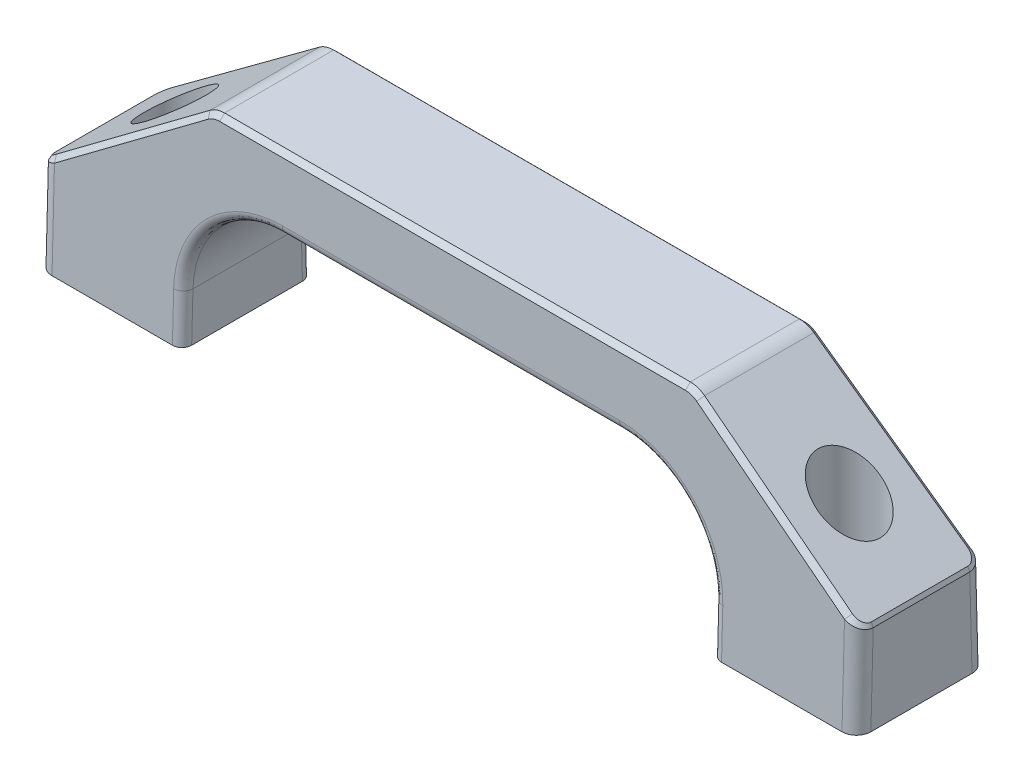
ISO-10303-21;
HEADER;
FILE_DESCRIPTION(('STEP AP214'),'2;1');
FILE_NAME('part.step','',(''),(''),'','','');
FILE_SCHEMA(('AUTOMOTIVE_DESIGN { 1 0 10303 214 1 1 1 1 }'));
ENDSEC;
DATA;
#1=APPLICATION_CONTEXT('core data for automotive mechanical design processes');
#2=APPLICATION_PROTOCOL_DEFINITION('international standard','automotive_design',2000,#1);
#3=PRODUCT_CONTEXT('',#1,'mechanical');
#4=PRODUCT('Part','Part','',(#3));
#5=PRODUCT_RELATED_PRODUCT_CATEGORY('part','',(#4));
#6=PRODUCT_DEFINITION_FORMATION('','',#4);
#7=PRODUCT_DEFINITION_CONTEXT('part definition',#1,'design');
#8=PRODUCT_DEFINITION('design','',#6,#7);
#9=PRODUCT_DEFINITION_SHAPE('','',#8);
#10=(LENGTH_UNIT() NAMED_UNIT(*) SI_UNIT(.MILLI.,.METRE.));
#11=(NAMED_UNIT(*) PLANE_ANGLE_UNIT() SI_UNIT($,.RADIAN.));
#12=(NAMED_UNIT(*) SI_UNIT($,.STERADIAN.) SOLID_ANGLE_UNIT());
#13=UNCERTAINTY_MEASURE_WITH_UNIT(LENGTH_MEASURE(1.E-05),#10,'distance_accuracy_value','');
#14=(GEOMETRIC_REPRESENTATION_CONTEXT(3) GLOBAL_UNCERTAINTY_ASSIGNED_CONTEXT((#13)) GLOBAL_UNIT_ASSIGNED_CONTEXT((#10,
#11,#12)) REPRESENTATION_CONTEXT('',''));
#15=CARTESIAN_POINT('',(0.,0.,0.));
#16=DIRECTION('',(0.,0.,1.));
#17=DIRECTION('',(1.,0.,0.));
#18=AXIS2_PLACEMENT_3D('',#15,#16,#17);
#19=CARTESIAN_POINT('',(-70.,14.5,0.));
#20=DIRECTION('',(0.,1.,0.));
#21=DIRECTION('',(0.,0.,1.));
#22=AXIS2_PLACEMENT_3D('',#19,#20,#21);
#23=CYLINDRICAL_SURFACE('',#22,6.45);
#24=CARTESIAN_POINT('',(-70.,30.1428571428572,0.));
#25=DIRECTION('',(0.596324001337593,-0.802743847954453,0.));
#26=DIRECTION('',(0.802743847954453,0.596324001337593,0.));
#27=AXIS2_PLACEMENT_3D('',#24,#25,#26);
#28=ELLIPSE('',#27,8.03494167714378,6.45);
#29=CARTESIAN_POINT('',(-63.55,34.9342857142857,0.));
#30=VERTEX_POINT('',#29);
#31=EDGE_CURVE('E207',#30,#30,#28,.F.);
#32=ORIENTED_EDGE('',*,*,#31,.T.);
#33=EDGE_LOOP('',(#32));
#34=FACE_BOUND('',#33,.T.);
#35=CARTESIAN_POINT('',(-70.,14.5,0.));
#36=DIRECTION('',(0.,1.,0.));
#37=DIRECTION('',(0.,0.,1.));
#38=AXIS2_PLACEMENT_3D('',#35,#36,#37);
#39=CIRCLE('',#38,6.45);
#40=CARTESIAN_POINT('',(-70.,14.5,6.45));
#41=VERTEX_POINT('',#40);
#42=EDGE_CURVE('E184',#41,#41,#39,.T.);
#43=ORIENTED_EDGE('',*,*,#42,.F.);
#44=EDGE_LOOP('',(#43));
#45=FACE_BOUND('',#44,.T.);
#46=ADVANCED_FACE('F17',(#34,#45),#23,.F.);
#47=CARTESIAN_POINT('',(70.,14.5,0.));
#48=DIRECTION('',(0.,1.,0.));
#49=DIRECTION('',(0.,0.,1.));
#50=AXIS2_PLACEMENT_3D('',#47,#48,#49);
#51=CYLINDRICAL_SURFACE('',#50,6.45);
#52=CARTESIAN_POINT('',(70.,30.1428571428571,0.));
#53=DIRECTION('',(-0.596324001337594,-0.802743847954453,0.));
#54=DIRECTION('',(-0.802743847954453,0.596324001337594,0.));
#55=AXIS2_PLACEMENT_3D('',#52,#53,#54);
#56=ELLIPSE('',#55,8.03494167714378,6.45);
#57=CARTESIAN_POINT('',(63.55,34.9342857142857,0.));
#58=VERTEX_POINT('',#57);
#59=EDGE_CURVE('E814',#58,#58,#56,.F.);
#60=ORIENTED_EDGE('',*,*,#59,.T.);
#61=EDGE_LOOP('',(#60));
#62=FACE_BOUND('',#61,.T.);
#63=CARTESIAN_POINT('',(70.,14.5,0.));
#64=DIRECTION('',(0.,1.,0.));
#65=DIRECTION('',(0.,0.,1.));
#66=AXIS2_PLACEMENT_3D('',#63,#64,#65);
#67=CIRCLE('',#66,6.45);
#68=CARTESIAN_POINT('',(70.,14.5,6.45));
#69=VERTEX_POINT('',#68);
#70=EDGE_CURVE('E24',#69,#69,#67,.F.);
#71=ORIENTED_EDGE('',*,*,#70,.T.);
#72=EDGE_LOOP('',(#71));
#73=FACE_BOUND('',#72,.T.);
#74=ADVANCED_FACE('F769',(#62,#73),#51,.F.);
#75=CARTESIAN_POINT('',(70.,14.5,0.));
#76=DIRECTION('',(0.,-1.,0.));
#77=DIRECTION('',(0.,0.,-1.));
#78=AXIS2_PLACEMENT_3D('',#75,#76,#77);
#79=PLANE('',#78);
#80=ORIENTED_EDGE('',*,*,#70,.F.);
#81=EDGE_LOOP('',(#80));
#82=FACE_BOUND('',#81,.T.);
#83=CARTESIAN_POINT('',(70.,14.5,0.));
#84=DIRECTION('',(0.,1.,0.));
#85=DIRECTION('',(0.,0.,1.));
#86=AXIS2_PLACEMENT_3D('',#83,#84,#85);
#87=CIRCLE('',#86,4.15);
#88=CARTESIAN_POINT('',(70.,14.5,4.15));
#89=VERTEX_POINT('',#88);
#90=EDGE_CURVE('E230',#89,#89,#87,.F.);
#91=ORIENTED_EDGE('',*,*,#90,.T.);
#92=EDGE_LOOP('',(#91));
#93=FACE_BOUND('',#92,.T.);
#94=ADVANCED_FACE('F766',(#82,#93),#79,.F.);
#95=CARTESIAN_POINT('',(85.0083709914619,18.4671428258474,10.0149565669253));
#96=CARTESIAN_POINT('',(85.0500670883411,18.4615557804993,11.6297742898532));
#97=CARTESIAN_POINT('',(83.601752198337,19.1775878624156,13.0598356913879));
#98=CARTESIAN_POINT('',(81.9876340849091,19.9605642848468,12.9976223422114));
#99=CARTESIAN_POINT('',(85.0041438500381,18.4755488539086,10.0149565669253));
#100=CARTESIAN_POINT('',(85.0456954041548,18.469815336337,11.6241807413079));
#101=CARTESIAN_POINT('',(83.6024012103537,19.1857159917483,13.0492231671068));
#102=CARTESIAN_POINT('',(81.9938785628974,19.9686961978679,12.9871543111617));
#103=CARTESIAN_POINT('',(85.,18.4837892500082,10.0149565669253));
#104=CARTESIAN_POINT('',(85.0414098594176,18.4779121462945,11.6186974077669));
#105=CARTESIAN_POINT('',(83.6030374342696,19.1936839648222,13.0388197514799));
#106=CARTESIAN_POINT('',(82.,19.9766678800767,12.9768925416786));
#107=CARTESIAN_POINT('',(84.5856149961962,19.3078288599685,10.0149565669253));
#108=CARTESIAN_POINT('',(84.6128553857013,19.2875931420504,11.0703640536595));
#109=CARTESIAN_POINT('',(83.6666598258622,19.9904812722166,11.998478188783));
#110=CARTESIAN_POINT('',(82.6121437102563,20.7738361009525,11.9507155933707));
#111=CARTESIAN_POINT('',(84.5814297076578,19.3161516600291,10.0149565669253));
#112=CARTESIAN_POINT('',(84.6085269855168,19.2957709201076,11.064825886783));
#113=CARTESIAN_POINT('',(83.6673024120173,19.9985289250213,11.9879707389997));
#114=CARTESIAN_POINT('',(82.6183263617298,20.7818874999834,11.9403512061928));
#115=B_SPLINE_SURFACE_WITH_KNOTS('',1,3,((#95,#96,#97,#98),(#99,#100,#101,#102),(#103,#104,#105,
#106),(#107,#108,#109,#110),(#111,#112,#113,#114)),.UNSPECIFIED.,.F.,.F.,.F.,(2,1,1,1,2),(4,4),
(-0.020201,-0.01,0.,1.,1.0101),(-0.035223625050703,1.5355727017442),.UNSPECIFIED.);
#116=DIRECTION('',(0.449263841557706,-0.893399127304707,0.));
#117=VECTOR('',#116,1.);
#118=CARTESIAN_POINT('',(84.5856149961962,19.3078288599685,10.0149565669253));
#119=LINE('',#118,#117);
#120=CARTESIAN_POINT('',(85.,18.4837892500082,10.0149565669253));
#121=VERTEX_POINT('',#120);
#122=CARTESIAN_POINT('',(84.5856149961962,19.3078288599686,10.0149565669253));
#123=VERTEX_POINT('',#122);
#124=EDGE_CURVE('E276',#121,#123,#119,.F.);
#125=CARTESIAN_POINT('',(84.5856149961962,19.3078288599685,10.0149565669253));
#126=CARTESIAN_POINT('',(84.5867136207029,19.3070127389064,10.0570661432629));
#127=CARTESIAN_POINT('',(84.5862460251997,19.3073600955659,10.0992308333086));
#128=CARTESIAN_POINT('',(84.5822564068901,19.3103238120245,10.1833053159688));
#129=CARTESIAN_POINT('',(84.5787366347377,19.3129384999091,10.2252152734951));
#130=CARTESIAN_POINT('',(84.5687610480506,19.3203489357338,10.3081541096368));
#131=CARTESIAN_POINT('',(84.5623283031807,19.3251275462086,10.3491873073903));
#132=CARTESIAN_POINT('',(84.5466836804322,19.3367492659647,10.4304166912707));
#133=CARTESIAN_POINT('',(84.537471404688,19.3435926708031,10.4706127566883));
#134=CARTESIAN_POINT('',(84.5059804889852,19.3669859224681,10.5893405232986));
#135=CARTESIAN_POINT('',(84.4798094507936,19.3864272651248,10.6663141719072));
#136=CARTESIAN_POINT('',(84.4186528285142,19.431857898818,10.814702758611));
#137=CARTESIAN_POINT('',(84.3836464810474,19.4578626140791,10.8861040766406));
#138=CARTESIAN_POINT('',(84.2902142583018,19.5272694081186,11.0510680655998));
#139=CARTESIAN_POINT('',(84.2281161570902,19.5733994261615,11.1414142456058));
#140=CARTESIAN_POINT('',(84.0930316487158,19.6737479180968,11.3083483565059));
#141=CARTESIAN_POINT('',(84.0200324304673,19.7279759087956,11.3849198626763));
#142=CARTESIAN_POINT('',(83.8646312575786,19.8434167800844,11.5251321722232));
#143=CARTESIAN_POINT('',(83.7820942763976,19.9047299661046,11.5885393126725));
#144=CARTESIAN_POINT('',(83.6108069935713,20.0319719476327,11.7005607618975));
#145=CARTESIAN_POINT('',(83.5220548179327,20.09790213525,11.7491705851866));
#146=CARTESIAN_POINT('',(83.3214463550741,20.2469255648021,11.8396725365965));
#147=CARTESIAN_POINT('',(83.2085868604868,20.3307640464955,11.8781380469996));
#148=CARTESIAN_POINT('',(82.9795220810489,20.500926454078,11.9321420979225));
#149=CARTESIAN_POINT('',(82.8633221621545,20.587246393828,11.9477155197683));
#150=CARTESIAN_POINT('',(82.7020211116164,20.7070700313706,11.9530298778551));
#151=CARTESIAN_POINT('',(82.6570472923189,20.7404791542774,11.9527585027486));
#152=CARTESIAN_POINT('',(82.6121437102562,20.7738361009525,11.9507155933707));
#153=B_SPLINE_CURVE_WITH_KNOTS('',3,(#125,#126,#127,#128,#129,#130,#131,#132,#133,#134,#135,
#136,#137,#138,#139,#140,#141,#142,#143,#144,#145,#146,#147,#148,#149,#150,#151,#152),
.UNSPECIFIED.,.F.,.F.,(4,2,2,2,2,2,2,2,2,2,2,2,2,4),(0.,0.126338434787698,0.252583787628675,
0.377846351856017,0.503126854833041,0.752780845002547,1.00302708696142,1.35790567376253,
1.7132046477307,2.07435363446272,2.43561198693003,2.87101858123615,3.30576104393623,
3.47372314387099),.UNSPECIFIED.);
#154=CARTESIAN_POINT('',(82.6121437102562,20.7738361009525,11.9507155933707));
#155=VERTEX_POINT('',#154);
#156=EDGE_CURVE('E800',#123,#155,#153,.T.);
#157=DIRECTION('',(0.426166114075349,0.554977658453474,-0.714410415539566));
#158=VECTOR('',#157,1.);
#159=CARTESIAN_POINT('',(82.,19.9766678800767,12.9768925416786));
#160=LINE('',#159,#158);
#161=CARTESIAN_POINT('',(82.,19.9766678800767,12.9768925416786));
#162=VERTEX_POINT('',#161);
#163=EDGE_CURVE('E222',#162,#155,#160,.T.);
#164=CARTESIAN_POINT('',(85.,18.4837892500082,10.0149565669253));
#165=CARTESIAN_POINT('',(85.0000107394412,18.4876685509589,10.0959119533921));
#166=CARTESIAN_POINT('',(84.9967175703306,18.4923854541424,10.1768292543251));
#167=CARTESIAN_POINT('',(84.983607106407,18.5036670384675,10.3380113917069));
#168=CARTESIAN_POINT('',(84.9737891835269,18.5102318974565,10.4182761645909));
#169=CARTESIAN_POINT('',(84.9477267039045,18.5253732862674,10.5774770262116));
#170=CARTESIAN_POINT('',(84.9314889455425,18.5339476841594,10.6564144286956));
#171=CARTESIAN_POINT('',(84.8927544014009,18.5533552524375,10.8124504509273));
#172=CARTESIAN_POINT('',(84.8702580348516,18.5641882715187,10.8895491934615));
#173=CARTESIAN_POINT('',(84.8192847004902,18.5883118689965,11.0411952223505));
#174=CARTESIAN_POINT('',(84.7908182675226,18.6015981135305,11.1157467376));
#175=CARTESIAN_POINT('',(84.7281757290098,18.6308038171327,11.2619089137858));
#176=CARTESIAN_POINT('',(84.6939975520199,18.646724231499,11.3335184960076));
#177=CARTESIAN_POINT('',(84.6203456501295,18.6812471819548,11.4731871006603));
#178=CARTESIAN_POINT('',(84.5808772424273,18.6998470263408,11.5412495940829));
#179=CARTESIAN_POINT('',(84.4970221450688,18.7397227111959,11.6734812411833));
#180=CARTESIAN_POINT('',(84.4526336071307,18.7609995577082,11.7376489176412));
#181=CARTESIAN_POINT('',(84.3598613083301,18.8058884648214,11.861078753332));
#182=CARTESIAN_POINT('',(84.3115219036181,18.8294750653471,11.9203835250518));
#183=CARTESIAN_POINT('',(84.2109091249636,18.8789796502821,12.0345274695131));
#184=CARTESIAN_POINT('',(84.158634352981,18.9048984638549,12.0893650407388));
#185=CARTESIAN_POINT('',(83.9965303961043,18.985835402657,12.2468680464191));
#186=CARTESIAN_POINT('',(83.881399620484,19.0440446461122,12.3425526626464));
#187=CARTESIAN_POINT('',(83.6303855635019,19.1717446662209,12.5212704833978));
#188=CARTESIAN_POINT('',(83.4935732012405,19.2417705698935,12.60259859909));
#189=CARTESIAN_POINT('',(83.2105534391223,19.3860701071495,12.7417649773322));
#190=CARTESIAN_POINT('',(83.0643416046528,19.460345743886,12.7995920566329));
#191=CARTESIAN_POINT('',(82.766993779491,19.6093039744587,12.8909216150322));
#192=CARTESIAN_POINT('',(82.6159364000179,19.6839713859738,12.9247034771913));
#193=CARTESIAN_POINT('',(82.3865703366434,19.7948996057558,12.9576393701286));
#194=CARTESIAN_POINT('',(82.3096916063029,19.8316783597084,12.9656622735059));
#195=CARTESIAN_POINT('',(82.1552703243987,19.9046618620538,12.9757559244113));
#196=CARTESIAN_POINT('',(82.0777277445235,19.940866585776,12.9778264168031));
#197=CARTESIAN_POINT('',(82.,19.9766678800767,12.9768925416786));
#198=B_SPLINE_CURVE_WITH_KNOTS('',3,(#164,#165,#166,#167,#168,#169,#170,#171,#172,#173,#174,
#175,#176,#177,#178,#179,#180,#181,#182,#183,#184,#185,#186,#187,#188,#189,#190,#191,#192,#193,
#194,#195,#196,#197),.UNSPECIFIED.,.F.,.F.,(4,2,2,2,2,2,2,2,2,2,2,2,2,2,2,2,4),(0.,
0.243076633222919,0.486176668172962,0.729019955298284,0.971846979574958,1.21424906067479,
1.45673924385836,1.69898750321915,1.94132707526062,2.18124498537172,2.4212485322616,
2.90114347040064,3.42079986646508,3.94070325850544,4.45446262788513,4.71108042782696,
4.96770922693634),.UNSPECIFIED.);
#199=EDGE_CURVE('E229',#121,#162,#198,.T.);
#200=ORIENTED_EDGE('',*,*,#124,.T.);
#201=ORIENTED_EDGE('',*,*,#156,.T.);
#202=ORIENTED_EDGE('',*,*,#163,.F.);
#203=ORIENTED_EDGE('',*,*,#199,.F.);
#204=EDGE_LOOP('',(#200,#201,#202,#203));
#205=FACE_BOUND('',#204,.T.);
#206=ADVANCED_FACE('F764',(#205),#115,.T.);
#207=CARTESIAN_POINT('',(84.5856149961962,19.3078288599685,13.5));
#208=DIRECTION('',(-0.893399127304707,-0.449263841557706,0.));
#209=DIRECTION('',(0.449263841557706,-0.893399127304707,0.));
#210=AXIS2_PLACEMENT_3D('',#207,#208,#209);
#211=PLANE('',#210);
#212=DIRECTION('',(0.,0.,1.));
#213=VECTOR('',#212,1.);
#214=CARTESIAN_POINT('',(85.,18.4837892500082,13.5));
#215=LINE('',#214,#213);
#216=CARTESIAN_POINT('',(85.,18.4837892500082,-10.0149565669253));
#217=VERTEX_POINT('',#216);
#218=EDGE_CURVE('E1363',#121,#217,#215,.F.);
#219=ORIENTED_EDGE('',*,*,#218,.T.);
#220=DIRECTION('',(0.449263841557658,-0.893399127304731,0.));
#221=VECTOR('',#220,1.);
#222=CARTESIAN_POINT('',(84.7927867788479,18.8958502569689,-10.0149565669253));
#223=LINE('',#222,#221);
#224=CARTESIAN_POINT('',(84.5856149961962,19.3078288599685,-10.0149565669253));
#225=VERTEX_POINT('',#224);
#226=EDGE_CURVE('E1389',#225,#217,#223,.T.);
#227=ORIENTED_EDGE('',*,*,#226,.F.);
#228=DIRECTION('',(0.,0.,1.));
#229=VECTOR('',#228,1.);
#230=CARTESIAN_POINT('',(84.5856149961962,19.3078288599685,13.5));
#231=LINE('',#230,#229);
#232=EDGE_CURVE('E808',#225,#123,#231,.T.);
#233=ORIENTED_EDGE('',*,*,#232,.T.);
#234=ORIENTED_EDGE('',*,*,#124,.F.);
#235=EDGE_LOOP('',(#219,#227,#233,#234));
#236=FACE_BOUND('',#235,.T.);
#237=ADVANCED_FACE('F760',(#236),#211,.F.);
#238=CARTESIAN_POINT('',(-70.,14.5,0.));
#239=DIRECTION('',(0.,1.,0.));
#240=DIRECTION('',(0.,0.,1.));
#241=AXIS2_PLACEMENT_3D('',#238,#239,#240);
#242=PLANE('',#241);
#243=ORIENTED_EDGE('',*,*,#42,.T.);
#244=EDGE_LOOP('',(#243));
#245=FACE_BOUND('',#244,.T.);
#246=CARTESIAN_POINT('',(-70.,14.5,0.));
#247=DIRECTION('',(0.,1.,0.));
#248=DIRECTION('',(0.,0.,1.));
#249=AXIS2_PLACEMENT_3D('',#246,#247,#248);
#250=CIRCLE('',#249,4.15);
#251=CARTESIAN_POINT('',(-70.,14.5,4.15));
#252=VERTEX_POINT('',#251);
#253=EDGE_CURVE('E692',#252,#252,#250,.F.);
#254=ORIENTED_EDGE('',*,*,#253,.T.);
#255=EDGE_LOOP('',(#254));
#256=FACE_BOUND('',#255,.T.);
#257=ADVANCED_FACE('F757',(#245,#256),#242,.T.);
#258=CARTESIAN_POINT('',(-85.,18.4837892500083,13.5));
#259=DIRECTION('',(0.893399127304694,-0.449263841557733,0.));
#260=DIRECTION('',(0.449263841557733,0.893399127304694,0.));
#261=AXIS2_PLACEMENT_3D('',#258,#259,#260);
#262=PLANE('',#261);
#263=DIRECTION('',(0.,0.,1.));
#264=VECTOR('',#263,1.);
#265=CARTESIAN_POINT('',(-84.5856149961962,19.3078288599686,13.5));
#266=LINE('',#265,#264);
#267=CARTESIAN_POINT('',(-84.5856149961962,19.3078288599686,10.0149565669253));
#268=VERTEX_POINT('',#267);
#269=CARTESIAN_POINT('',(-84.5856149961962,19.3078288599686,-10.0149565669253));
#270=VERTEX_POINT('',#269);
#271=EDGE_CURVE('E178',#268,#270,#266,.F.);
#272=ORIENTED_EDGE('',*,*,#271,.T.);
#273=DIRECTION('',(0.449263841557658,0.893399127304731,0.));
#274=VECTOR('',#273,1.);
#275=CARTESIAN_POINT('',(-84.7927867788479,18.8958502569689,-10.0149565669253));
#276=LINE('',#275,#274);
#277=CARTESIAN_POINT('',(-85.,18.4837892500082,-10.0149565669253));
#278=VERTEX_POINT('',#277);
#279=EDGE_CURVE('E210',#278,#270,#276,.T.);
#280=ORIENTED_EDGE('',*,*,#279,.F.);
#281=DIRECTION('',(0.,0.,-1.));
#282=VECTOR('',#281,1.);
#283=CARTESIAN_POINT('',(-85.,18.4837892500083,13.5));
#284=LINE('',#283,#282);
#285=CARTESIAN_POINT('',(-85.,18.4837892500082,10.0149565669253));
#286=VERTEX_POINT('',#285);
#287=EDGE_CURVE('E181',#278,#286,#284,.F.);
#288=ORIENTED_EDGE('',*,*,#287,.T.);
#289=DIRECTION('',(-0.449263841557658,-0.893399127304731,0.));
#290=VECTOR('',#289,1.);
#291=CARTESIAN_POINT('',(-84.7927867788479,18.8958502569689,10.0149565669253));
#292=LINE('',#291,#290);
#293=EDGE_CURVE('E175',#268,#286,#292,.T.);
#294=ORIENTED_EDGE('',*,*,#293,.F.);
#295=EDGE_LOOP('',(#272,#280,#288,#294));
#296=FACE_BOUND('',#295,.T.);
#297=ADVANCED_FACE('F176',(#296),#262,.F.);
#298=CARTESIAN_POINT('',(-81.9876340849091,19.9605642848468,12.9976223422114));
#299=CARTESIAN_POINT('',(-83.6017521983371,19.1775878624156,13.0598356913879));
#300=CARTESIAN_POINT('',(-85.0500670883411,18.4615557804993,11.6297742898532));
#301=CARTESIAN_POINT('',(-85.0083709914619,18.4671428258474,10.0149565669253));
#302=CARTESIAN_POINT('',(-81.9938785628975,19.9686961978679,12.9871543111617));
#303=CARTESIAN_POINT('',(-83.6024012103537,19.1857159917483,13.0492231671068));
#304=CARTESIAN_POINT('',(-85.0456954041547,18.469815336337,11.6241807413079));
#305=CARTESIAN_POINT('',(-85.0041438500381,18.4755488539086,10.0149565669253));
#306=CARTESIAN_POINT('',(-82.,19.9766678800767,12.9768925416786));
#307=CARTESIAN_POINT('',(-83.6030374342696,19.1936839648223,13.0388197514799));
#308=CARTESIAN_POINT('',(-85.0414098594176,18.4779121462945,11.6186974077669));
#309=CARTESIAN_POINT('',(-85.,18.4837892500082,10.0149565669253));
#310=CARTESIAN_POINT('',(-82.6121437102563,20.7738361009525,11.9507155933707));
#311=CARTESIAN_POINT('',(-83.6666598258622,19.9904812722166,11.998478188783));
#312=CARTESIAN_POINT('',(-84.6128553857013,19.2875931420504,11.0703640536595));
#313=CARTESIAN_POINT('',(-84.5856149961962,19.3078288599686,10.0149565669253));
#314=CARTESIAN_POINT('',(-82.6183263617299,20.7818874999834,11.9403512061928));
#315=CARTESIAN_POINT('',(-83.6673024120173,19.9985289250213,11.9879707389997));
#316=CARTESIAN_POINT('',(-84.6085269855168,19.2957709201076,11.064825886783));
#317=CARTESIAN_POINT('',(-84.5814297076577,19.3161516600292,10.0149565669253));
#318=B_SPLINE_SURFACE_WITH_KNOTS('',1,3,((#298,#299,#300,#301),(#302,#303,#304,#305),(#306,#307,
#308,#309),(#310,#311,#312,#313),(#314,#315,#316,#317)),.UNSPECIFIED.,.F.,.F.,.F.,(2,1,1,1,2),
(4,4),(-0.020201,-0.01,0.,1.,1.0101),(1.6060199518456,3.17681627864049),.UNSPECIFIED.);
#319=CARTESIAN_POINT('',(-82.,19.9766678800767,12.9768925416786));
#320=CARTESIAN_POINT('',(-82.0931417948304,19.9337769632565,12.9780128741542));
#321=CARTESIAN_POINT('',(-82.1860415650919,19.8902803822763,12.9748151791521));
#322=CARTESIAN_POINT('',(-82.3707962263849,19.8025340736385,12.9598881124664));
#323=CARTESIAN_POINT('',(-82.462651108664,19.7582843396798,12.9481586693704));
#324=CARTESIAN_POINT('',(-82.6451657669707,19.669289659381,12.9162002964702));
#325=CARTESIAN_POINT('',(-82.7358182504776,19.6245433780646,12.8959331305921));
#326=CARTESIAN_POINT('',(-82.9149200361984,19.5353301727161,12.8470042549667));
#327=CARTESIAN_POINT('',(-83.0033693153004,19.4908632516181,12.8183424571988));
#328=CARTESIAN_POINT('',(-83.264790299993,19.3586801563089,12.7197432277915));
#329=CARTESIAN_POINT('',(-83.4339140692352,19.2721426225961,12.63717826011));
#330=CARTESIAN_POINT('',(-83.6753382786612,19.1489053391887,12.4888337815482));
#331=CARTESIAN_POINT('',(-83.7537580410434,19.1089268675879,12.4353131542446));
#332=CARTESIAN_POINT('',(-83.9058706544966,19.0317272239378,12.3202060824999));
#333=CARTESIAN_POINT('',(-83.979566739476,18.9945041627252,12.2586252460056));
#334=CARTESIAN_POINT('',(-84.1164733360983,18.9258699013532,12.1321881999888));
#335=CARTESIAN_POINT('',(-84.1800566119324,18.8942346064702,12.0678564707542));
#336=CARTESIAN_POINT('',(-84.3016564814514,18.8342763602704,11.9327650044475));
#337=CARTESIAN_POINT('',(-84.3596760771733,18.8059516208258,11.8620087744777));
#338=CARTESIAN_POINT('',(-84.4694089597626,18.7529135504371,11.7145316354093));
#339=CARTESIAN_POINT('',(-84.5211239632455,18.7281992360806,11.6378123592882));
#340=CARTESIAN_POINT('',(-84.6175222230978,18.6825409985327,11.4790271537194));
#341=CARTESIAN_POINT('',(-84.6622066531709,18.6615964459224,11.3969621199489));
#342=CARTESIAN_POINT('',(-84.7384495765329,18.6259975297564,11.2394808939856));
#343=CARTESIAN_POINT('',(-84.7709632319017,18.61087715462,11.1646300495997));
#344=CARTESIAN_POINT('',(-84.8298374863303,18.5833373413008,11.0120692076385));
#345=CARTESIAN_POINT('',(-84.856198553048,18.5709176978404,10.934359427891));
#346=CARTESIAN_POINT('',(-84.9024515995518,18.5485839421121,10.7767740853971));
#347=CARTESIAN_POINT('',(-84.9223497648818,18.5386674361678,10.6969006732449));
#348=CARTESIAN_POINT('',(-84.9554923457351,18.5210742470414,10.5355750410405));
#349=CARTESIAN_POINT('',(-84.9687396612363,18.5133965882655,10.4541235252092));
#350=CARTESIAN_POINT('',(-84.9857256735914,18.5018866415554,10.3129432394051));
#351=CARTESIAN_POINT('',(-84.9910813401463,18.4975781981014,10.2534419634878));
#352=CARTESIAN_POINT('',(-84.998215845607,18.4899565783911,10.1342881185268));
#353=CARTESIAN_POINT('',(-85.0000021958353,18.486641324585,10.0746361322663));
#354=CARTESIAN_POINT('',(-85.,18.4837892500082,10.0149565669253));
#355=B_SPLINE_CURVE_WITH_KNOTS('',3,(#319,#320,#321,#322,#323,#324,#325,#326,#327,#328,#329,
#330,#331,#332,#333,#334,#335,#336,#337,#338,#339,#340,#341,#342,#343,#344,#345,#346,#347,#348,
#349,#350,#351,#352,#353,#354),.UNSPECIFIED.,.F.,.F.,(4,2,2,2,2,2,2,2,2,2,2,2,2,2,2,2,2,4),(0.,
0.30753159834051,0.615065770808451,0.923992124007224,1.23292171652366,1.85051676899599,
2.15921695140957,2.46770348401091,2.7547660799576,3.04167290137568,3.32850142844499,
3.61528202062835,3.86395869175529,4.11261645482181,4.36103552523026,4.60934618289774,
4.78892786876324,4.96813124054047),.UNSPECIFIED.);
#356=CARTESIAN_POINT('',(-82.,19.9766678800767,12.9768925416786));
#357=VERTEX_POINT('',#356);
#358=EDGE_CURVE('E214',#357,#286,#355,.T.);
#359=DIRECTION('',(0.426166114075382,-0.554977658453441,0.714410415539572));
#360=VECTOR('',#359,1.);
#361=CARTESIAN_POINT('',(-82.6121437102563,20.7738361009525,11.9507155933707));
#362=LINE('',#361,#360);
#363=CARTESIAN_POINT('',(-82.6121437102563,20.7738361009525,11.9507155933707));
#364=VERTEX_POINT('',#363);
#365=EDGE_CURVE('E170',#364,#357,#362,.T.);
#366=CARTESIAN_POINT('',(-82.6121437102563,20.7738361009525,11.9507155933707));
#367=CARTESIAN_POINT('',(-82.7125036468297,20.6992830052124,11.9552899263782));
#368=CARTESIAN_POINT('',(-82.8130638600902,20.6245811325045,11.9510173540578));
#369=CARTESIAN_POINT('',(-83.0125442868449,20.4763956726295,11.9252792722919));
#370=CARTESIAN_POINT('',(-83.1114675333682,20.402909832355,11.9038503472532));
#371=CARTESIAN_POINT('',(-83.3273365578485,20.2425499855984,11.8378117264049));
#372=CARTESIAN_POINT('',(-83.4434975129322,20.1562589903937,11.7891601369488));
#373=CARTESIAN_POINT('',(-83.6675388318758,19.9898282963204,11.6679862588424));
#374=CARTESIAN_POINT('',(-83.775421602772,19.9096868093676,11.5954709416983));
#375=CARTESIAN_POINT('',(-83.9580694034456,19.7740055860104,11.4443910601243));
#376=CARTESIAN_POINT('',(-84.0351026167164,19.7167809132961,11.3700724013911));
#377=CARTESIAN_POINT('',(-84.17862030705,19.6101677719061,11.206957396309));
#378=CARTESIAN_POINT('',(-84.2451175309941,19.5607698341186,11.1181788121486));
#379=CARTESIAN_POINT('',(-84.3507411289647,19.4823065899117,10.9481375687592));
#380=CARTESIAN_POINT('',(-84.3926670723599,19.4511616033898,10.8695744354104));
#381=CARTESIAN_POINT('',(-84.4656970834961,19.3969107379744,10.7050912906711));
#382=CARTESIAN_POINT('',(-84.4968324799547,19.3737815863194,10.6191934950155));
#383=CARTESIAN_POINT('',(-84.5328701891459,19.3470107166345,10.4894223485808));
#384=CARTESIAN_POINT('',(-84.5428903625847,19.3395671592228,10.4476879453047));
#385=CARTESIAN_POINT('',(-84.5599352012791,19.3269052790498,10.3632752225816));
#386=CARTESIAN_POINT('',(-84.5669605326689,19.321686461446,10.3205971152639));
#387=CARTESIAN_POINT('',(-84.5778899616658,19.3135674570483,10.2342363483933));
#388=CARTESIAN_POINT('',(-84.5817659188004,19.3106881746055,10.190548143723));
#389=CARTESIAN_POINT('',(-84.5862037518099,19.3073914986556,10.1028726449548));
#390=CARTESIAN_POINT('',(-84.5867626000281,19.3069763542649,10.0588851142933));
#391=CARTESIAN_POINT('',(-84.5856149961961,19.3078288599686,10.0149565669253));
#392=B_SPLINE_CURVE_WITH_KNOTS('',3,(#366,#367,#368,#369,#370,#371,#372,#373,#374,#375,#376,
#377,#378,#379,#380,#381,#382,#383,#384,#385,#386,#387,#388,#389,#390,#391),.UNSPECIFIED.,.F.,
.F.,(4,2,2,2,2,2,2,2,2,2,2,2,4),(0.,0.37488428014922,0.748971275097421,1.20479520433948,
1.66048608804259,2.02329199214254,2.38565555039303,2.6676573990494,2.94883350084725,
3.07937813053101,3.20989370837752,3.34156303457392,3.47335252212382),.UNSPECIFIED.);
#393=EDGE_CURVE('E187',#364,#268,#392,.T.);
#394=ORIENTED_EDGE('',*,*,#293,.T.);
#395=ORIENTED_EDGE('',*,*,#358,.F.);
#396=ORIENTED_EDGE('',*,*,#365,.F.);
#397=ORIENTED_EDGE('',*,*,#393,.T.);
#398=EDGE_LOOP('',(#394,#395,#396,#397));
#399=FACE_BOUND('',#398,.T.);
#400=ADVANCED_FACE('F188',(#399),#318,.T.);
#401=CARTESIAN_POINT('',(-48.3460656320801,43.9903461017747,12.3580722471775));
#402=CARTESIAN_POINT('',(-49.1906351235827,43.9922310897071,12.3580227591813));
#403=CARTESIAN_POINT('',(-50.0325715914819,43.7137295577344,12.3653344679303));
#404=CARTESIAN_POINT('',(-50.7094204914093,43.2085793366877,12.3785965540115));
#405=CARTESIAN_POINT('',(-48.3460656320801,44.0003426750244,12.3478104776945));
#406=CARTESIAN_POINT('',(-49.1928226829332,44.0022325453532,12.3477609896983));
#407=CARTESIAN_POINT('',(-50.0369398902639,43.7230096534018,12.3550726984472));
#408=CARTESIAN_POINT('',(-50.7155419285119,43.2165510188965,12.3683347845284));
#409=CARTESIAN_POINT('',(-48.3460656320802,45.,11.3216335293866));
#410=CARTESIAN_POINT('',(-49.411578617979,45.0023781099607,11.3215840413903));
#411=CARTESIAN_POINT('',(-50.4737697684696,44.6510192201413,11.3288957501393));
#412=CARTESIAN_POINT('',(-51.3276856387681,44.0137192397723,11.3421578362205));
#413=CARTESIAN_POINT('',(-48.3460656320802,45.0100965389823,11.3112691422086));
#414=CARTESIAN_POINT('',(-49.413788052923,45.0124795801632,11.3112196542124));
#415=CARTESIAN_POINT('',(-50.4781817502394,44.6603921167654,11.3185313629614));
#416=CARTESIAN_POINT('',(-51.3338682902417,44.0217706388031,11.3317934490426));
#417=B_SPLINE_SURFACE_WITH_KNOTS('',1,3,((#401,#402,#403,#404),(#405,#406,#407,#408),(#409,#410,
#411,#412),(#413,#414,#415,#416)),.UNSPECIFIED.,.F.,.F.,.F.,(2,1,1,2),(4,4),(-0.01,0.,1.,
1.0101),(0.,0.638913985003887),.UNSPECIFIED.);
#418=DIRECTION('',(-0.426166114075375,0.554977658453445,-0.714410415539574));
#419=VECTOR('',#418,1.);
#420=CARTESIAN_POINT('',(-50.7155419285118,43.2165510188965,12.3683347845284));
#421=LINE('',#420,#419);
#422=CARTESIAN_POINT('',(-50.7155419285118,43.2165510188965,12.3683347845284));
#423=VERTEX_POINT('',#422);
#424=CARTESIAN_POINT('',(-51.3276856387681,44.0137192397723,11.3421578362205));
#425=VERTEX_POINT('',#424);
#426=EDGE_CURVE('E183',#423,#425,#421,.T.);
#427=CARTESIAN_POINT('',(-48.3460656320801,44.0003426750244,12.3478104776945));
#428=CARTESIAN_POINT('',(-48.454366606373,44.0005861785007,12.3478041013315));
#429=CARTESIAN_POINT('',(-48.5626592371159,43.9962274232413,12.3479182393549));
#430=CARTESIAN_POINT('',(-48.7784468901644,43.9785329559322,12.3483815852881));
#431=CARTESIAN_POINT('',(-48.8859423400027,43.9652024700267,12.3487306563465));
#432=CARTESIAN_POINT('',(-49.099464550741,43.9297948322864,12.3496578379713));
#433=CARTESIAN_POINT('',(-49.2054915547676,43.90771914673,12.3502359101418));
#434=CARTESIAN_POINT('',(-49.4154310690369,43.8550516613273,12.3516150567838));
#435=CARTESIAN_POINT('',(-49.5193426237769,43.8244561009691,12.3524162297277));
#436=CARTESIAN_POINT('',(-49.8172011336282,43.7234791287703,12.355060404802));
#437=CARTESIAN_POINT('',(-50.0075592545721,43.6421444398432,12.3571902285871));
#438=CARTESIAN_POINT('',(-50.3738501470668,43.450621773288,12.3622054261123));
#439=CARTESIAN_POINT('',(-50.5497381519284,43.3403483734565,12.3650930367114));
#440=CARTESIAN_POINT('',(-50.7155419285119,43.2165510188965,12.3683347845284));
#441=B_SPLINE_CURVE_WITH_KNOTS('',3,(#427,#428,#429,#430,#431,#432,#433,#434,#435,#436,#437,
#438,#439,#440),.UNSPECIFIED.,.F.,.F.,(4,2,2,2,2,2,4),(0.,0.324777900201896,0.649366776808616,
0.973901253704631,1.29857920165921,1.91697378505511,2.53721470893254),.UNSPECIFIED.);
#442=CARTESIAN_POINT('',(-48.3460656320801,44.0003426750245,12.3478104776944));
#443=VERTEX_POINT('',#442);
#444=EDGE_CURVE('E644',#443,#423,#441,.T.);
#445=DIRECTION('',(0.,-0.697790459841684,0.71630194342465));
#446=VECTOR('',#445,1.);
#447=CARTESIAN_POINT('',(-48.3460656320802,44.0003426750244,12.3478104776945));
#448=LINE('',#447,#446);
#449=CARTESIAN_POINT('',(-48.3460656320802,45.,11.3216335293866));
#450=VERTEX_POINT('',#449);
#451=EDGE_CURVE('E212',#450,#443,#448,.T.);
#452=CARTESIAN_POINT('',(-51.3276856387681,44.0137192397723,11.3421578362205));
#453=CARTESIAN_POINT('',(-51.2280836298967,44.0877204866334,11.3408895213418));
#454=CARTESIAN_POINT('',(-51.1257186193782,44.1579982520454,11.3395324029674));
#455=CARTESIAN_POINT('',(-50.9160208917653,44.2907703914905,11.336793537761));
#456=CARTESIAN_POINT('',(-50.8086868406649,44.3532626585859,11.3354117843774));
#457=CARTESIAN_POINT('',(-50.5899625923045,44.4699276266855,11.3327810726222));
#458=CARTESIAN_POINT('',(-50.4785842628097,44.5241225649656,11.3315317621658));
#459=CARTESIAN_POINT('',(-50.2521512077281,44.6240836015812,11.3292577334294));
#460=CARTESIAN_POINT('',(-50.1370976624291,44.6698523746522,11.3282329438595));
#461=CARTESIAN_POINT('',(-49.8883816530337,44.7582471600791,11.3263377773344));
#462=CARTESIAN_POINT('',(-49.7542802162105,44.7996445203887,11.3255060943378));
#463=CARTESIAN_POINT('',(-49.4831224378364,44.8710117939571,11.3241782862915));
#464=CARTESIAN_POINT('',(-49.3460671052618,44.9009855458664,11.3236820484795));
#465=CARTESIAN_POINT('',(-49.0658175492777,44.9500278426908,11.3229163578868));
#466=CARTESIAN_POINT('',(-48.9225618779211,44.9687461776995,11.3226540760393));
#467=CARTESIAN_POINT('',(-48.634892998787,44.9937442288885,11.3221681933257));
#468=CARTESIAN_POINT('',(-48.4904792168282,45.0000173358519,11.3219446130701));
#469=CARTESIAN_POINT('',(-48.3460656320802,45.,11.3216335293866));
#470=B_SPLINE_CURVE_WITH_KNOTS('',3,(#452,#453,#454,#455,#456,#457,#458,#459,#460,#461,#462,
#463,#464,#465,#466,#467,#468,#469),.UNSPECIFIED.,.F.,.F.,(4,2,2,2,2,2,2,2,4),(0.,
0.372181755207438,0.744464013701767,1.11573037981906,1.48687869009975,1.90741543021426,
2.32781073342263,2.76068798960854,3.19379506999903),.UNSPECIFIED.);
#471=EDGE_CURVE('E287',#425,#450,#470,.T.);
#472=ORIENTED_EDGE('',*,*,#426,.F.);
#473=ORIENTED_EDGE('',*,*,#444,.F.);
#474=ORIENTED_EDGE('',*,*,#451,.F.);
#475=ORIENTED_EDGE('',*,*,#471,.F.);
#476=EDGE_LOOP('',(#472,#473,#474,#475));
#477=FACE_BOUND('',#476,.T.);
#478=ADVANCED_FACE('F753',(#477),#417,.T.);
#479=CARTESIAN_POINT('',(-93.4996856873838,11.4340442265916,13.2005890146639));
#480=DIRECTION('',(-0.417303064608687,0.580072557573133,0.699552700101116));
#481=DIRECTION('',(0.,-0.769781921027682,0.638306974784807));
#482=AXIS2_PLACEMENT_3D('',#479,#480,#481);
#483=PLANE('',#482);
#484=ORIENTED_EDGE('',*,*,#365,.T.);
#485=DIRECTION('',(-0.802645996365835,-0.596251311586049,0.0156133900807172));
#486=VECTOR('',#485,1.);
#487=CARTESIAN_POINT('',(-50.7155419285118,43.2165510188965,12.3683347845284));
#488=LINE('',#487,#486);
#489=EDGE_CURVE('E641',#423,#357,#488,.T.);
#490=ORIENTED_EDGE('',*,*,#489,.F.);
#491=ORIENTED_EDGE('',*,*,#426,.T.);
#492=DIRECTION('',(-0.802645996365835,-0.596251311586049,0.015613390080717));
#493=VECTOR('',#492,1.);
#494=CARTESIAN_POINT('',(-51.3276856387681,44.0137192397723,11.3421578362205));
#495=LINE('',#494,#493);
#496=EDGE_CURVE('E191',#425,#364,#495,.T.);
#497=ORIENTED_EDGE('',*,*,#496,.T.);
#498=EDGE_LOOP('',(#484,#490,#491,#497));
#499=FACE_BOUND('',#498,.T.);
#500=ADVANCED_FACE('F737',(#499),#483,.T.);
#501=CARTESIAN_POINT('',(-35.,32.0523538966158,12.6606795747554));
#502=CARTESIAN_POINT('',(-35.,30.,12.7144223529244));
#503=CARTESIAN_POINT('',(-35.,30.,10.6613649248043));
#504=CARTESIAN_POINT('',(-36.4399129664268,32.0523538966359,12.6606795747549));
#505=CARTESIAN_POINT('',(-36.305492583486,30.000000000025,12.7144223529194));
#506=CARTESIAN_POINT('',(-36.3090117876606,30.,10.6613649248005));
#507=CARTESIAN_POINT('',(-37.8797576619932,31.9105399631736,12.6643931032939));
#508=CARTESIAN_POINT('',(-37.6107059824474,29.8718217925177,12.7177788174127));
#509=CARTESIAN_POINT('',(-37.6179615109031,29.8710782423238,10.6650784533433));
#510=CARTESIAN_POINT('',(-40.7042165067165,31.3487201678,12.6791048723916));
#511=CARTESIAN_POINT('',(-40.1719046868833,29.3637667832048,12.7310827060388));
#512=CARTESIAN_POINT('',(-40.185651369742,29.3603329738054,10.6797902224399));
#513=CARTESIAN_POINT('',(-42.0887444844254,30.9287281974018,12.6901027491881));
#514=CARTESIAN_POINT('',(-41.4274091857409,28.9840689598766,12.7410254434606));
#515=CARTESIAN_POINT('',(-41.4443131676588,28.9785220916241,10.6907880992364));
#516=CARTESIAN_POINT('',(-44.7493265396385,29.8266790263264,12.7189609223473));
#517=CARTESIAN_POINT('',(-43.8411799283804,27.9871613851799,12.7671303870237));
#518=CARTESIAN_POINT('',(-43.8630241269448,27.9766592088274,10.7196462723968));
#519=CARTESIAN_POINT('',(-46.0253148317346,29.1446490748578,12.7368205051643));
#520=CARTESIAN_POINT('',(-44.9990783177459,27.3702833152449,12.7832839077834));
#521=CARTESIAN_POINT('',(-45.0230134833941,27.3566319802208,10.7375058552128));
#522=CARTESIAN_POINT('',(-48.4197754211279,27.5447216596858,12.7787160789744));
#523=CARTESIAN_POINT('',(-47.1732283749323,25.9222436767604,12.8212021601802));
#524=CARTESIAN_POINT('',(-47.19979583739,25.9021525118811,10.7794014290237));
#525=CARTESIAN_POINT('',(-49.5381885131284,26.6268637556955,12.8027510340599));
#526=CARTESIAN_POINT('',(-48.1892598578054,25.0915180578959,12.842955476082));
#527=CARTESIAN_POINT('',(-48.2165350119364,25.0677362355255,10.8034363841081));
#528=CARTESIAN_POINT('',(-51.5745098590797,24.5905424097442,12.8560739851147));
#529=CARTESIAN_POINT('',(-50.0405276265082,23.2472326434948,12.8912497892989));
#530=CARTESIAN_POINT('',(-50.0677362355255,23.2165350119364,10.8567593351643));
#531=CARTESIAN_POINT('',(-52.4923677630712,23.4721293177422,12.8853606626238));
#532=CARTESIAN_POINT('',(-50.8757181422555,22.2341500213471,12.9177782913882));
#533=CARTESIAN_POINT('',(-50.9021525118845,22.1997958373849,10.8860460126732));
#534=CARTESIAN_POINT('',(-54.0922951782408,21.0776687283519,12.9480618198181));
#535=CARTESIAN_POINT('',(-52.3329305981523,20.0636852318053,12.9746139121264));
#536=CARTESIAN_POINT('',(-52.3566319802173,20.0230134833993,10.9487471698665));
#537=CARTESIAN_POINT('',(-54.7743251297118,19.8016804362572,12.9814747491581));
#538=CARTESIAN_POINT('',(-52.9550818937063,18.9067535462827,13.0049092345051));
#539=CARTESIAN_POINT('',(-52.9766592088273,18.8630241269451,10.9821600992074));
#540=CARTESIAN_POINT('',(-55.8763743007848,17.1410983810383,13.0511445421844));
#541=CARTESIAN_POINT('',(-53.9619001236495,16.492791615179,13.0681210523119));
#542=CARTESIAN_POINT('',(-53.9785220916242,16.4443131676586,11.0518298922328));
#543=CARTESIAN_POINT('',(-56.2963662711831,15.75657040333,13.087399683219));
#544=CARTESIAN_POINT('',(-54.3468465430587,15.2361227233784,13.101028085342));
#545=CARTESIAN_POINT('',(-54.3603329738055,15.1856513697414,11.0880850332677));
#546=CARTESIAN_POINT('',(-56.858186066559,12.9321115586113,13.1613607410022));
#547=CARTESIAN_POINT('',(-54.8639901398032,12.6708960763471,13.1682009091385));
#548=CARTESIAN_POINT('',(-54.8710782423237,12.6179615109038,11.1620460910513));
#549=CARTESIAN_POINT('',(-56.999999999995,11.4922668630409,13.1990644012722));
#550=CARTESIAN_POINT('',(-54.9965704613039,11.3625806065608,13.202460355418));
#551=CARTESIAN_POINT('',(-55.,11.3090117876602,11.1997497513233));
#552=CARTESIAN_POINT('',(-57.,10.0523538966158,13.2367698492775));
#553=CARTESIAN_POINT('',(-55.,10.0523538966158,13.2367698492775));
#554=CARTESIAN_POINT('',(-55.,10.,11.2374551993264));
#555=(BOUNDED_SURFACE() B_SPLINE_SURFACE(3,2,((#501,#502,#503),(#504,#505,#506),(#507,#508,
#509),(#510,#511,#512),(#513,#514,#515),(#516,#517,#518),(#519,#520,#521),(#522,#523,#524),
(#525,#526,#527),(#528,#529,#530),(#531,#532,#533),(#534,#535,#536),(#537,#538,#539),(#540,#541,
#542),(#543,#544,#545),(#546,#547,#548),(#549,#550,#551),(#552,#553,#554)),.UNSPECIFIED.,.F.,
.F.,.F.) B_SPLINE_SURFACE_WITH_KNOTS((4,2,2,2,2,2,2,2,4),(3,3),(0.,0.196349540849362,
0.392699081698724,0.589048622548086,0.785398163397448,0.98174770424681,1.17809724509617,
1.37444678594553,1.5707963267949),(0.,1.),
.UNSPECIFIED.) GEOMETRIC_REPRESENTATION_ITEM() RATIONAL_B_SPLINE_SURFACE(((1.,0.69779045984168,
1.),(1.,0.697790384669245,1.),(1.,0.697850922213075,1.),(1.,0.698090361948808,1.),(1.,
0.698269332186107,1.),(1.,0.698738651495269,1.),(1.,0.699028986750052,1.),(1.,0.699709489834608,
1.),(1.,0.700099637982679,1.),(1.,0.70096431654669,1.),(1.,0.701438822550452,1.),(1.,
0.702453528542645,1.),(1.,0.702993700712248,1.),(1.,0.704118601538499,1.),(1.,0.704703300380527,
1.),(1.,0.705894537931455,1.),(1.,0.706501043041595,1.),(1.,0.707106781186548,1.))) REPRESENTATION_ITEM('') SURFACE());
#556=CARTESIAN_POINT('',(-57.,10.,11.2374551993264));
#557=DIRECTION('',(0.,-0.999657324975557,0.0261769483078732));
#558=DIRECTION('',(0.,-0.0261769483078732,-0.999657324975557));
#559=AXIS2_PLACEMENT_3D('',#556,#557,#558);
#560=CIRCLE('',#559,2.);
#561=CARTESIAN_POINT('',(-55.,10.,11.2374551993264));
#562=VERTEX_POINT('',#561);
#563=CARTESIAN_POINT('',(-57.,10.0523538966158,13.2367698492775));
#564=VERTEX_POINT('',#563);
#565=EDGE_CURVE('E653',#562,#564,#560,.T.);
#566=CARTESIAN_POINT('',(-55.,10.,11.2374551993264));
#567=CARTESIAN_POINT('',(-55.,11.3090117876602,11.1997497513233));
#568=CARTESIAN_POINT('',(-54.8710782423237,12.6179615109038,11.1620460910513));
#569=CARTESIAN_POINT('',(-54.3603329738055,15.1856513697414,11.0880850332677));
#570=CARTESIAN_POINT('',(-53.9785220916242,16.4443131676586,11.0518298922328));
#571=CARTESIAN_POINT('',(-52.9766592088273,18.8630241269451,10.9821600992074));
#572=CARTESIAN_POINT('',(-52.3566319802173,20.0230134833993,10.9487471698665));
#573=CARTESIAN_POINT('',(-50.9021525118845,22.1997958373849,10.8860460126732));
#574=CARTESIAN_POINT('',(-50.0677362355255,23.2165350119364,10.8567593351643));
#575=CARTESIAN_POINT('',(-48.2165350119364,25.0677362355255,10.8034363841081));
#576=CARTESIAN_POINT('',(-47.19979583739,25.9021525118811,10.7794014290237));
#577=CARTESIAN_POINT('',(-45.0230134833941,27.3566319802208,10.7375058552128));
#578=CARTESIAN_POINT('',(-43.8630241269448,27.9766592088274,10.7196462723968));
#579=CARTESIAN_POINT('',(-41.4443131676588,28.9785220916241,10.6907880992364));
#580=CARTESIAN_POINT('',(-40.185651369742,29.3603329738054,10.67979022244));
#581=CARTESIAN_POINT('',(-37.6179615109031,29.8710782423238,10.6650784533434));
#582=CARTESIAN_POINT('',(-36.3090117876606,30.,10.6613649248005));
#583=CARTESIAN_POINT('',(-35.,30.,10.6613649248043));
#584=(BOUNDED_CURVE() B_SPLINE_CURVE(3,(#566,#567,#568,#569,#570,#571,#572,#573,#574,#575,#576,
#577,#578,#579,#580,#581,#582,#583),.UNSPECIFIED.,.F.,.F.) B_SPLINE_CURVE_WITH_KNOTS((4,2,2,2,2,
2,2,2,4),(0.,0.196349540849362,0.392699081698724,0.589048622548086,0.785398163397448,
0.98174770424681,1.17809724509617,1.37444678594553,1.5707963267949),
.UNSPECIFIED.) CURVE() GEOMETRIC_REPRESENTATION_ITEM() RATIONAL_B_SPLINE_CURVE((1.,1.,1.,1.,1.,
1.,1.,1.,1.,1.,1.,1.,1.,1.,1.,1.,1.,1.)) REPRESENTATION_ITEM(''));
#585=CARTESIAN_POINT('',(-35.,30.,10.6613649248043));
#586=VERTEX_POINT('',#585);
#587=EDGE_CURVE('E431',#562,#586,#584,.T.);
#588=CARTESIAN_POINT('',(-35.,32.,10.6613649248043));
#589=DIRECTION('',(-1.,0.,0.));
#590=DIRECTION('',(0.,-1.,0.));
#591=AXIS2_PLACEMENT_3D('',#588,#589,#590);
#592=CIRCLE('',#591,2.);
#593=CARTESIAN_POINT('',(-35.,32.0523538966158,12.6606795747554));
#594=VERTEX_POINT('',#593);
#595=EDGE_CURVE('E706',#594,#586,#592,.F.);
#596=CARTESIAN_POINT('',(-35.,32.0523538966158,12.6606795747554));
#597=CARTESIAN_POINT('',(-35.3599768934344,32.0523539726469,12.6606795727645));
#598=CARTESIAN_POINT('',(-35.7199511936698,32.0434905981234,12.6609116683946));
#599=CARTESIAN_POINT('',(-36.4390304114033,32.0081219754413,12.6618378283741));
#600=CARTESIAN_POINT('',(-36.7981353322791,31.9816167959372,12.6625318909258));
#601=CARTESIAN_POINT('',(-37.5146145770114,31.9110495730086,12.6643797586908));
#602=CARTESIAN_POINT('',(-37.8719889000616,31.8669875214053,12.6655335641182));
#603=CARTESIAN_POINT('',(-38.5841479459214,31.7613912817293,12.6682986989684));
#604=CARTESIAN_POINT('',(-38.9389326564,31.6998570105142,12.6699100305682));
#605=CARTESIAN_POINT('',(-39.6450445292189,31.5594025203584,12.6735879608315));
#606=CARTESIAN_POINT('',(-39.996371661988,31.4804821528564,12.6756545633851));
#607=CARTESIAN_POINT('',(-40.6947326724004,31.3055080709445,12.6802364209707));
#608=CARTESIAN_POINT('',(-41.041766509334,31.2094541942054,12.6827516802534));
#609=CARTESIAN_POINT('',(-41.7307130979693,31.0004645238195,12.6882242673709));
#610=CARTESIAN_POINT('',(-42.0726258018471,30.8875285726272,12.6911815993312));
#611=CARTESIAN_POINT('',(-42.7505021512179,30.6450256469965,12.697531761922));
#612=CARTESIAN_POINT('',(-43.0864657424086,30.5154585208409,12.7009245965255));
#613=CARTESIAN_POINT('',(-43.7516092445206,30.2399470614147,12.7081391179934));
#614=CARTESIAN_POINT('',(-44.0807890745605,30.0940025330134,12.7119608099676));
#615=CARTESIAN_POINT('',(-44.7315954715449,29.786147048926,12.7200222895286));
#616=CARTESIAN_POINT('',(-45.0532219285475,29.6242358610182,12.7242620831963));
#617=CARTESIAN_POINT('',(-45.6881586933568,29.2848550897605,12.7331490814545));
#618=CARTESIAN_POINT('',(-46.0014688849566,29.1073852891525,12.7377962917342));
#619=CARTESIAN_POINT('',(-46.6190100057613,28.7372949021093,12.7474874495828));
#620=CARTESIAN_POINT('',(-46.9232408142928,28.5446741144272,12.7525314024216));
#621=CARTESIAN_POINT('',(-47.5218540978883,28.1446935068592,12.7630052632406));
#622=CARTESIAN_POINT('',(-47.8162364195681,27.9373334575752,12.7684351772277));
#623=CARTESIAN_POINT('',(-48.3944780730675,27.5084273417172,12.7796664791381));
#624=CARTESIAN_POINT('',(-48.6783372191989,27.2868810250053,12.7854678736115));
#625=CARTESIAN_POINT('',(-49.2348638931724,26.8301513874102,12.7974277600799));
#626=CARTESIAN_POINT('',(-49.5075312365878,26.5949678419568,12.8035862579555));
#627=CARTESIAN_POINT('',(-50.0410053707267,26.1115123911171,12.8162459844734));
#628=CARTESIAN_POINT('',(-50.3018119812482,25.8632402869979,12.8227472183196));
#629=CARTESIAN_POINT('',(-50.8108906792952,25.3541615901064,12.836077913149));
#630=CARTESIAN_POINT('',(-51.0591625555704,25.0933547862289,12.84290737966));
#631=CARTESIAN_POINT('',(-51.5426179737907,24.5598806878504,12.8568768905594));
#632=CARTESIAN_POINT('',(-51.7778012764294,24.2872131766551,12.864016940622));
#633=CARTESIAN_POINT('',(-52.2345308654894,23.7306865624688,12.8785901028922));
#634=CARTESIAN_POINT('',(-52.4560769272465,23.4468272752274,12.8860232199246));
#635=CARTESIAN_POINT('',(-52.8849829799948,22.8685857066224,12.9011650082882));
#636=CARTESIAN_POINT('',(-53.0923427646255,22.5742032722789,12.9088736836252));
#637=CARTESIAN_POINT('',(-53.4923232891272,21.9755901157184,12.9245489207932));
#638=CARTESIAN_POINT('',(-53.684943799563,21.6713592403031,12.9325154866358));
#639=CARTESIAN_POINT('',(-54.0550340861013,21.0538182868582,12.9486863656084));
#640=CARTESIAN_POINT('',(-54.2325036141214,20.7405080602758,12.9568906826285));
#641=CARTESIAN_POINT('',(-54.5718842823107,20.1055714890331,12.9735170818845));
#642=CARTESIAN_POINT('',(-54.733795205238,19.7839450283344,12.9819391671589));
#643=CARTESIAN_POINT('',(-55.0416505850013,19.1331388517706,12.9989811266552));
#644=CARTESIAN_POINT('',(-55.1875948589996,18.8039590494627,13.0076010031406));
#645=CARTESIAN_POINT('',(-55.4631062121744,18.1388158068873,13.0250183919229));
#646=CARTESIAN_POINT('',(-55.5926730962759,17.8028522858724,13.0338159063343));
#647=CARTESIAN_POINT('',(-55.8351759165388,17.1249762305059,13.0515667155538));
#648=CARTESIAN_POINT('',(-55.9481116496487,16.7830636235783,13.0605200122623));
#649=CARTESIAN_POINT('',(-56.1571012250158,16.0941173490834,13.0785607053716));
#650=CARTESIAN_POINT('',(-56.2531549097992,15.7470836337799,13.0876481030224));
#651=CARTESIAN_POINT('',(-56.4281289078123,15.0487229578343,13.1059353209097));
#652=CARTESIAN_POINT('',(-56.5070491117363,14.6973959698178,13.1151351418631));
#653=CARTESIAN_POINT('',(-56.6475035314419,13.9912844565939,13.1336253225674));
#654=CARTESIAN_POINT('',(-56.7090376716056,13.6364999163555,13.1429156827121));
#655=CARTESIAN_POINT('',(-56.8146338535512,12.9243412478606,13.1615642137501));
#656=CARTESIAN_POINT('',(-56.8586958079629,12.566967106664,13.1709223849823));
#657=CARTESIAN_POINT('',(-56.9292629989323,11.8504882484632,13.1896840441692));
#658=CARTESIAN_POINT('',(-56.9557681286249,11.4913835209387,13.1990875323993));
#659=CARTESIAN_POINT('',(-56.991136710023,10.7723046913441,13.2179172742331));
#660=CARTESIAN_POINT('',(-57.0000000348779,10.4123305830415,13.227343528));
#661=CARTESIAN_POINT('',(-57.,10.0523538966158,13.2367698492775));
#662=B_SPLINE_CURVE_WITH_KNOTS('',3,(#596,#597,#598,#599,#600,#601,#602,#603,#604,#605,#606,
#607,#608,#609,#610,#611,#612,#613,#614,#615,#616,#617,#618,#619,#620,#621,#622,#623,#624,#625,
#626,#627,#628,#629,#630,#631,#632,#633,#634,#635,#636,#637,#638,#639,#640,#641,#642,#643,#644,
#645,#646,#647,#648,#649,#650,#651,#652,#653,#654,#655,#656,#657,#658,#659,#660,#661),
.UNSPECIFIED.,.F.,.F.,(4,2,2,2,2,2,2,2,2,2,2,2,2,2,2,2,2,2,2,2,2,2,2,2,2,2,2,2,2,2,2,2,4),(0.,
1.07981811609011,2.15963203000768,3.23944644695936,4.3192660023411,5.39909478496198,
6.47893379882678,7.55878289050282,8.63864183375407,9.71851364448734,10.7984011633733,
11.8783037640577,12.9582207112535,14.038154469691,15.118107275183,16.1980778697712,
17.2780648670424,18.3580700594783,19.4380949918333,20.5181377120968,21.5981961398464,
22.6782713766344,23.7583642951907,24.8384722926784,25.9185926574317,26.9987258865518,
28.0788723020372,29.1590287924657,30.239192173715,31.3193602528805,32.399533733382,
33.4797137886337,34.5599016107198),.UNSPECIFIED.);
#663=EDGE_CURVE('E580',#564,#594,#662,.F.);
#664=ORIENTED_EDGE('',*,*,#565,.F.);
#665=ORIENTED_EDGE('',*,*,#587,.T.);
#666=ORIENTED_EDGE('',*,*,#595,.F.);
#667=ORIENTED_EDGE('',*,*,#663,.F.);
#668=EDGE_LOOP('',(#664,#665,#666,#667));
#669=FACE_BOUND('',#668,.T.);
#670=ADVANCED_FACE('F704',(#669),#555,.T.);
#671=CARTESIAN_POINT('',(-85.,32.,10.6613649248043));
#672=DIRECTION('',(-1.,0.,0.));
#673=DIRECTION('',(0.,-1.,0.));
#674=AXIS2_PLACEMENT_3D('',#671,#672,#673);
#675=CYLINDRICAL_SURFACE('',#674,2.);
#676=ORIENTED_EDGE('',*,*,#595,.T.);
#677=DIRECTION('',(-1.,0.,0.));
#678=VECTOR('',#677,1.);
#679=CARTESIAN_POINT('',(35.,30.,10.6613649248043));
#680=LINE('',#679,#678);
#681=CARTESIAN_POINT('',(35.,30.,10.6613649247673));
#682=VERTEX_POINT('',#681);
#683=EDGE_CURVE('E432',#586,#682,#680,.F.);
#684=ORIENTED_EDGE('',*,*,#683,.T.);
#685=CARTESIAN_POINT('',(35.,32.,10.6613649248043));
#686=DIRECTION('',(1.,0.,0.));
#687=DIRECTION('',(0.,0.,-1.));
#688=AXIS2_PLACEMENT_3D('',#685,#686,#687);
#689=CIRCLE('',#688,1.99999999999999);
#690=CARTESIAN_POINT('',(35.,32.0523538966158,12.6606795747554));
#691=VERTEX_POINT('',#690);
#692=EDGE_CURVE('E225',#691,#682,#689,.T.);
#693=ORIENTED_EDGE('',*,*,#692,.F.);
#694=DIRECTION('',(1.,0.,0.));
#695=VECTOR('',#694,1.);
#696=CARTESIAN_POINT('',(-85.,32.0523538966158,12.6606795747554));
#697=LINE('',#696,#695);
#698=EDGE_CURVE('E632',#594,#691,#697,.T.);
#699=ORIENTED_EDGE('',*,*,#698,.F.);
#700=EDGE_LOOP('',(#676,#684,#693,#699));
#701=FACE_BOUND('',#700,.T.);
#702=ADVANCED_FACE('F260',(#701),#675,.T.);
#703=CARTESIAN_POINT('',(57.,10.0523538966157,13.2367698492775));
#704=CARTESIAN_POINT('',(55.,10.0523538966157,13.2367698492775));
#705=CARTESIAN_POINT('',(55.,10.,11.2374551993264));
#706=CARTESIAN_POINT('',(56.999999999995,11.4922668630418,13.1990644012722));
#707=CARTESIAN_POINT('',(54.9965704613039,11.3625806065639,13.2024603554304));
#708=CARTESIAN_POINT('',(55.,11.3090117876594,11.1997497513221));
#709=CARTESIAN_POINT('',(56.858186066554,12.9321115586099,13.1613607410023));
#710=CARTESIAN_POINT('',(54.8639901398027,12.6708960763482,13.1682009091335));
#711=CARTESIAN_POINT('',(54.8710782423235,12.6179615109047,11.1620460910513));
#712=CARTESIAN_POINT('',(56.2963662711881,15.7565704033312,13.087399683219));
#713=CARTESIAN_POINT('',(54.3468465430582,15.236122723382,13.101028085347));
#714=CARTESIAN_POINT('',(54.3603329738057,15.1856513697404,11.0880850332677));
#715=CARTESIAN_POINT('',(55.8763743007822,17.1410983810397,13.0511445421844));
#716=CARTESIAN_POINT('',(53.9619001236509,16.4927916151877,13.0681210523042));
#717=CARTESIAN_POINT('',(53.9785220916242,16.4443131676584,11.0518298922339));
#718=CARTESIAN_POINT('',(54.7743251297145,19.8016804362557,12.9814747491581));
#719=CARTESIAN_POINT('',(52.9550818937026,18.9067535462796,13.0049092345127));
#720=CARTESIAN_POINT('',(52.9766592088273,18.8630241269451,10.9821600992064));
#721=CARTESIAN_POINT('',(54.0922951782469,21.0776687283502,12.9480618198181));
#722=CARTESIAN_POINT('',(52.3329305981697,20.0636852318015,12.9746139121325));
#723=CARTESIAN_POINT('',(52.356631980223,20.0230134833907,10.9487471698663));
#724=CARTESIAN_POINT('',(52.4923677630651,23.4721293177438,12.8853606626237));
#725=CARTESIAN_POINT('',(50.8757181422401,22.2341500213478,12.9177782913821));
#726=CARTESIAN_POINT('',(50.9021525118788,22.1997958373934,10.8860460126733));
#727=CARTESIAN_POINT('',(51.5745098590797,24.5905424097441,12.8560739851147));
#728=CARTESIAN_POINT('',(50.0405276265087,23.2472326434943,12.8912497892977));
#729=CARTESIAN_POINT('',(50.0677362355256,23.2165350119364,10.8567593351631));
#730=CARTESIAN_POINT('',(49.5381885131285,26.6268637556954,12.8027510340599));
#731=CARTESIAN_POINT('',(48.1892598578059,25.0915180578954,12.8429554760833));
#732=CARTESIAN_POINT('',(48.2165350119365,25.0677362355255,10.8034363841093));
#733=CARTESIAN_POINT('',(48.4197754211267,27.5447216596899,12.7787160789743));
#734=CARTESIAN_POINT('',(47.1732283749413,25.9222436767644,12.8212021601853));
#735=CARTESIAN_POINT('',(47.1997958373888,25.9021525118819,10.7794014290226));
#736=CARTESIAN_POINT('',(46.0253148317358,29.1446490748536,12.7368205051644));
#737=CARTESIAN_POINT('',(44.9990783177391,27.3702833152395,12.7832839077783));
#738=CARTESIAN_POINT('',(45.0230134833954,27.3566319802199,10.7375058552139));
#739=CARTESIAN_POINT('',(44.7493265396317,29.826679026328,12.7189609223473));
#740=CARTESIAN_POINT('',(43.8411799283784,27.9871613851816,12.7671303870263));
#741=CARTESIAN_POINT('',(43.8630241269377,27.9766592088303,10.7196462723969));
#742=CARTESIAN_POINT('',(42.0887444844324,30.9287281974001,12.6901027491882));
#743=CARTESIAN_POINT('',(41.4274091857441,28.9840689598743,12.741025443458));
#744=CARTESIAN_POINT('',(41.444313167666,28.9785220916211,10.6907880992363));
#745=CARTESIAN_POINT('',(40.7042165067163,31.3487201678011,12.6791048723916));
#746=CARTESIAN_POINT('',(40.1719046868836,29.3637667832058,12.7310827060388));
#747=CARTESIAN_POINT('',(40.1856513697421,29.3603329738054,10.6797902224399));
#748=CARTESIAN_POINT('',(37.8797576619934,31.9105399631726,12.664393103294));
#749=CARTESIAN_POINT('',(37.6107059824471,29.8718217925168,12.7177788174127));
#750=CARTESIAN_POINT('',(37.6179615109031,29.8710782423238,10.6650784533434));
#751=CARTESIAN_POINT('',(36.4399129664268,32.0523538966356,12.6606795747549));
#752=CARTESIAN_POINT('',(36.3054925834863,30.000000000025,12.7144223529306));
#753=CARTESIAN_POINT('',(36.3090117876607,30.,10.6613649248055));
#754=CARTESIAN_POINT('',(35.,32.0523538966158,12.6606795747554));
#755=CARTESIAN_POINT('',(35.,30.,12.7144223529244));
#756=CARTESIAN_POINT('',(35.,30.,10.6613649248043));
#757=(BOUNDED_SURFACE() B_SPLINE_SURFACE(3,2,((#703,#704,#705),(#706,#707,#708),(#709,#710,
#711),(#712,#713,#714),(#715,#716,#717),(#718,#719,#720),(#721,#722,#723),(#724,#725,#726),
(#727,#728,#729),(#730,#731,#732),(#733,#734,#735),(#736,#737,#738),(#739,#740,#741),(#742,#743,
#744),(#745,#746,#747),(#748,#749,#750),(#751,#752,#753),(#754,#755,#756)),.UNSPECIFIED.,.F.,
.F.,.F.) B_SPLINE_SURFACE_WITH_KNOTS((4,2,2,2,2,2,2,2,4),(3,3),(4.71238898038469,
4.90873852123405,5.10508806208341,5.30143760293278,5.49778714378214,5.6941366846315,
5.89048622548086,6.08683576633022,6.28318530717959),(0.,1.),
.UNSPECIFIED.) GEOMETRIC_REPRESENTATION_ITEM() RATIONAL_B_SPLINE_SURFACE(((1.,0.707106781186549,
1.),(1.,0.706501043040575,1.),(1.,0.705894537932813,1.),(1.,0.704703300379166,1.),(1.,
0.704118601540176,1.),(1.,0.702993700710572,1.),(1.,0.702453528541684,1.),(1.,0.701438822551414,
1.),(1.,0.700964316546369,1.),(1.,0.700099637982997,1.),(1.,0.699709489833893,1.),(1.,
0.69902898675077,1.),(1.,0.69873865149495,1.),(1.,0.698269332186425,1.),(1.,0.698090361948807,
1.),(1.,0.697850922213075,1.),(1.,0.697790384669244,1.),(1.,0.69779045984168,1.))) REPRESENTATION_ITEM('') SURFACE());
#758=CARTESIAN_POINT('',(35.,30.,10.6613649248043));
#759=CARTESIAN_POINT('',(35.3272517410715,30.0000000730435,10.6613649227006));
#760=CARTESIAN_POINT('',(35.6545011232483,29.9919424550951,10.6615970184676));
#761=CARTESIAN_POINT('',(36.3082095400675,29.9597891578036,10.662523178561));
#762=CARTESIAN_POINT('',(36.6346685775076,29.9356935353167,10.6632172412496));
#763=CARTESIAN_POINT('',(37.286013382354,29.8715415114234,10.6650651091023));
#764=CARTESIAN_POINT('',(37.6108991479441,29.8314850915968,10.666218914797));
#765=CARTESIAN_POINT('',(38.2583164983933,29.7354885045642,10.6689840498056));
#766=CARTESIAN_POINT('',(38.5808480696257,29.6795482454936,10.6705953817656));
#767=CARTESIAN_POINT('',(39.2227679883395,29.5518623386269,10.6742733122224));
#768=CARTESIAN_POINT('',(39.5421563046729,29.4801165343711,10.6763399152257));
#769=CARTESIAN_POINT('',(40.1770299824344,29.3210491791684,10.6809217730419));
#770=CARTESIAN_POINT('',(40.4925153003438,29.2337274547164,10.6834370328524));
#771=CARTESIAN_POINT('',(41.1188304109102,29.0437368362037,10.6889096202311));
#772=CARTESIAN_POINT('',(41.4296601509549,28.9410677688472,10.6918669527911));
#773=CARTESIAN_POINT('',(42.0459114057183,28.7206105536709,10.6982171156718));
#774=CARTESIAN_POINT('',(42.3513328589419,28.6028222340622,10.7016099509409));
#775=CARTESIAN_POINT('',(42.9560087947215,28.3523572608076,10.7088244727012));
#776=CARTESIAN_POINT('',(43.255263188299,28.2196803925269,10.7126461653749));
#777=CARTESIAN_POINT('',(43.8469053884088,27.9398117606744,10.7207076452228));
#778=CARTESIAN_POINT('',(44.1392930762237,27.792619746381,10.7249474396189));
#779=CARTESIAN_POINT('',(44.7165083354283,27.4840917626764,10.7338344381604));
#780=CARTESIAN_POINT('',(45.0013357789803,27.3227555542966,10.7384816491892));
#781=CARTESIAN_POINT('',(45.5627368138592,26.986309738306,10.7481728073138));
#782=CARTESIAN_POINT('',(45.839310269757,26.8111999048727,10.7532167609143));
#783=CARTESIAN_POINT('',(46.3835041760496,26.4475811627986,10.7636906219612));
#784=CARTESIAN_POINT('',(46.6511244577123,26.2590720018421,10.7691205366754));
#785=CARTESIAN_POINT('',(47.1767986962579,25.8691573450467,10.780351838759));
#786=CARTESIAN_POINT('',(47.4348524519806,25.6677515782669,10.7861532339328));
#787=CARTESIAN_POINT('',(47.9407857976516,25.2525428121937,10.7981131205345));
#788=CARTESIAN_POINT('',(48.1886651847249,25.0387395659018,10.8042716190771));
#789=CARTESIAN_POINT('',(48.6736416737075,24.59923460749,10.8169313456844));
#790=CARTESIAN_POINT('',(48.9107385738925,24.3735326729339,10.8234325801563));
#791=CARTESIAN_POINT('',(49.3735373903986,23.9107338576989,10.836763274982));
#792=CARTESIAN_POINT('',(49.5992390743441,23.6736367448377,10.8435927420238));
#793=CARTESIAN_POINT('',(50.0387439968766,23.1886602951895,10.8575622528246));
#794=CARTESIAN_POINT('',(50.2525469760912,22.9407807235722,10.8647023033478));
#795=CARTESIAN_POINT('',(50.6677556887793,22.434847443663,10.8792754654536));
#796=CARTESIAN_POINT('',(50.869161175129,22.1767935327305,10.8867085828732));
#797=CARTESIAN_POINT('',(51.2590757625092,21.6511193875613,10.9018503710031));
#798=CARTESIAN_POINT('',(51.4475846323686,21.3834989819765,10.9095590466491));
#799=CARTESIAN_POINT('',(51.8112032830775,20.839305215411,10.9252342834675));
#800=CARTESIAN_POINT('',(51.9863128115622,20.5627316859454,10.9332008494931));
#801=CARTESIAN_POINT('',(52.3227585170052,20.0013308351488,10.9493717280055));
#802=CARTESIAN_POINT('',(52.4840944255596,19.7165033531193,10.9575760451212));
#803=CARTESIAN_POINT('',(52.7926222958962,19.1392883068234,10.9742024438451));
#804=CARTESIAN_POINT('',(52.9398140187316,18.8469006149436,10.9826245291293));
#805=CARTESIAN_POINT('',(53.2196825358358,18.2552586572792,10.99966648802));
#806=CARTESIAN_POINT('',(53.3523591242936,17.9560042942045,11.0082863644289));
#807=CARTESIAN_POINT('',(53.6028239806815,17.3513286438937,11.0257037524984));
#808=CARTESIAN_POINT('',(53.7206120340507,17.0459072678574,11.0345012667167));
#809=CARTESIAN_POINT('',(53.9410691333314,16.4296563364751,11.0522520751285));
#810=CARTESIAN_POINT('',(54.0437379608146,16.1188267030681,11.0612053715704));
#811=CARTESIAN_POINT('',(54.2337284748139,15.4925119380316,11.0792460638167));
#812=CARTESIAN_POINT('',(54.3210499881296,15.1770267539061,11.0883334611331));
#813=CARTESIAN_POINT('',(54.4801172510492,14.542153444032,11.1066206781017));
#814=CARTESIAN_POINT('',(54.5518628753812,14.2227652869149,11.1158204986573));
#815=CARTESIAN_POINT('',(54.6795487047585,13.5808457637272,11.1343106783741));
#816=CARTESIAN_POINT('',(54.7354888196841,13.2583143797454,11.1436010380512));
#817=CARTESIAN_POINT('',(54.8314853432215,12.610897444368,11.1622495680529));
#818=CARTESIAN_POINT('',(54.8715416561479,12.2860118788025,11.1716077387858));
#819=CARTESIAN_POINT('',(54.9356936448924,11.6346674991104,11.1903693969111));
#820=CARTESIAN_POINT('',(54.9597892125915,11.3082086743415,11.1997728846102));
#821=CARTESIAN_POINT('',(54.9919424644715,10.6545006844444,11.2186026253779));
#822=CARTESIAN_POINT('',(55.0000000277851,10.3272515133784,11.2280288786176));
#823=CARTESIAN_POINT('',(55.,10.,11.2374551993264));
#824=B_SPLINE_CURVE_WITH_KNOTS('',3,(#758,#759,#760,#761,#762,#763,#764,#765,#766,#767,#768,
#769,#770,#771,#772,#773,#774,#775,#776,#777,#778,#779,#780,#781,#782,#783,#784,#785,#786,#787,
#788,#789,#790,#791,#792,#793,#794,#795,#796,#797,#798,#799,#800,#801,#802,#803,#804,#805,#806,
#807,#808,#809,#810,#811,#812,#813,#814,#815,#816,#817,#818,#819,#820,#821,#822,#823),
.UNSPECIFIED.,.F.,.F.,(4,2,2,2,2,2,2,2,2,2,2,2,2,2,2,2,2,2,2,2,2,2,2,2,2,2,2,2,2,2,2,2,4),(0.,
0.98165287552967,1.96330227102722,2.94495279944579,3.92660900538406,4.90827492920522,
5.88995178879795,6.87163973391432,7.85333883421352,8.83505208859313,9.81678230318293,
10.7985291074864,11.7802920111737,12.762073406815,13.7438754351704,14.7256970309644,
15.7075369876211,16.6893969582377,17.6712783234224,18.6531792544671,19.6350977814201,
20.6170347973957,21.5989909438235,22.5809636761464,23.5629503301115,24.5449511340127,
25.5269661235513,26.5089921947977,27.4910261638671,28.4730657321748,29.4551112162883,
30.4371633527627,31.4192228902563),.UNSPECIFIED.);
#825=CARTESIAN_POINT('',(55.,10.,11.2374551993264));
#826=VERTEX_POINT('',#825);
#827=EDGE_CURVE('E440',#682,#826,#824,.T.);
#828=CARTESIAN_POINT('',(57.,9.99999999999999,11.2374551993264));
#829=DIRECTION('',(0.,0.999657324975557,-0.0261769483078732));
#830=DIRECTION('',(0.,0.0261769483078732,0.999657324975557));
#831=AXIS2_PLACEMENT_3D('',#828,#829,#830);
#832=CIRCLE('',#831,2.);
#833=CARTESIAN_POINT('',(57.,10.0523538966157,13.2367698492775));
#834=VERTEX_POINT('',#833);
#835=EDGE_CURVE('E226',#834,#826,#832,.F.);
#836=CARTESIAN_POINT('',(57.,10.0523538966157,13.2367698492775));
#837=CARTESIAN_POINT('',(56.999999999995,11.4922668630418,13.1990644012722));
#838=CARTESIAN_POINT('',(56.858186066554,12.9321115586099,13.1613607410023));
#839=CARTESIAN_POINT('',(56.2963662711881,15.7565704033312,13.087399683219));
#840=CARTESIAN_POINT('',(55.8763743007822,17.1410983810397,13.0511445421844));
#841=CARTESIAN_POINT('',(54.7743251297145,19.8016804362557,12.9814747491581));
#842=CARTESIAN_POINT('',(54.0922951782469,21.0776687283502,12.9480618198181));
#843=CARTESIAN_POINT('',(52.4923677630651,23.4721293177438,12.8853606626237));
#844=CARTESIAN_POINT('',(51.5745098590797,24.5905424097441,12.8560739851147));
#845=CARTESIAN_POINT('',(49.5381885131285,26.6268637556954,12.8027510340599));
#846=CARTESIAN_POINT('',(48.4197754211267,27.5447216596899,12.7787160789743));
#847=CARTESIAN_POINT('',(46.0253148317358,29.1446490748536,12.7368205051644));
#848=CARTESIAN_POINT('',(44.7493265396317,29.826679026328,12.7189609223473));
#849=CARTESIAN_POINT('',(42.0887444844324,30.9287281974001,12.6901027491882));
#850=CARTESIAN_POINT('',(40.7042165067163,31.3487201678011,12.6791048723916));
#851=CARTESIAN_POINT('',(37.8797576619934,31.9105399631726,12.664393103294));
#852=CARTESIAN_POINT('',(36.4399129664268,32.0523538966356,12.6606795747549));
#853=CARTESIAN_POINT('',(35.,32.0523538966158,12.6606795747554));
#854=(BOUNDED_CURVE() B_SPLINE_CURVE(3,(#836,#837,#838,#839,#840,#841,#842,#843,#844,#845,#846,
#847,#848,#849,#850,#851,#852,#853),.UNSPECIFIED.,.F.,.F.) B_SPLINE_CURVE_WITH_KNOTS((4,2,2,2,2,
2,2,2,4),(4.71238898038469,4.90873852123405,5.10508806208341,5.30143760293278,5.49778714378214,
5.6941366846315,5.89048622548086,6.08683576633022,6.28318530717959),
.UNSPECIFIED.) CURVE() GEOMETRIC_REPRESENTATION_ITEM() RATIONAL_B_SPLINE_CURVE((1.,1.,1.,1.,1.,
1.,1.,1.,1.,1.,1.,1.,1.,1.,1.,1.,1.,1.)) REPRESENTATION_ITEM(''));
#855=EDGE_CURVE('E240',#691,#834,#854,.F.);
#856=ORIENTED_EDGE('',*,*,#692,.T.);
#857=ORIENTED_EDGE('',*,*,#827,.T.);
#858=ORIENTED_EDGE('',*,*,#835,.F.);
#859=ORIENTED_EDGE('',*,*,#855,.F.);
#860=EDGE_LOOP('',(#856,#857,#858,#859));
#861=FACE_BOUND('',#860,.T.);
#862=ADVANCED_FACE('F247',(#861),#757,.T.);
#863=CARTESIAN_POINT('',(-16.0212155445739,92.792427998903,11.0701447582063));
#864=DIRECTION('',(0.417303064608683,0.580072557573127,0.699552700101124));
#865=DIRECTION('',(0.,-0.769781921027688,0.638306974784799));
#866=AXIS2_PLACEMENT_3D('',#863,#864,#865);
#867=PLANE('',#866);
#868=ORIENTED_EDGE('',*,*,#163,.T.);
#869=DIRECTION('',(-0.802645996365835,0.596251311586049,-0.015613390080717));
#870=VECTOR('',#869,1.);
#871=CARTESIAN_POINT('',(82.6121437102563,20.7738361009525,11.9507155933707));
#872=LINE('',#871,#870);
#873=CARTESIAN_POINT('',(51.3276856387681,44.0137192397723,11.3421578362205));
#874=VERTEX_POINT('',#873);
#875=EDGE_CURVE('E807',#155,#874,#872,.T.);
#876=ORIENTED_EDGE('',*,*,#875,.T.);
#877=DIRECTION('',(0.426166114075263,0.554977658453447,-0.714410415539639));
#878=VECTOR('',#877,1.);
#879=CARTESIAN_POINT('',(51.0185530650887,43.61114928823,11.860377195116));
#880=LINE('',#879,#878);
#881=CARTESIAN_POINT('',(50.715541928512,43.2165510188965,12.3683347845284));
#882=VERTEX_POINT('',#881);
#883=EDGE_CURVE('E218',#882,#874,#880,.T.);
#884=ORIENTED_EDGE('',*,*,#883,.F.);
#885=DIRECTION('',(-0.802645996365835,0.596251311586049,-0.0156133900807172));
#886=VECTOR('',#885,1.);
#887=CARTESIAN_POINT('',(82.0000000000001,19.9766678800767,12.9768925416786));
#888=LINE('',#887,#886);
#889=EDGE_CURVE('E623',#162,#882,#888,.T.);
#890=ORIENTED_EDGE('',*,*,#889,.F.);
#891=EDGE_LOOP('',(#868,#876,#884,#890));
#892=FACE_BOUND('',#891,.T.);
#893=ADVANCED_FACE('F259',(#892),#867,.T.);
#894=CARTESIAN_POINT('',(50.7094204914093,43.2085793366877,12.3785965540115));
#895=CARTESIAN_POINT('',(50.0325715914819,43.7137295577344,12.3653344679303));
#896=CARTESIAN_POINT('',(49.1906351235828,43.9922310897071,12.3580227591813));
#897=CARTESIAN_POINT('',(48.3460656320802,43.9903461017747,12.3580722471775));
#898=CARTESIAN_POINT('',(50.7155419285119,43.2165510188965,12.3683347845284));
#899=CARTESIAN_POINT('',(50.0369398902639,43.7230096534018,12.3550726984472));
#900=CARTESIAN_POINT('',(49.1928226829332,44.0022325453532,12.3477609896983));
#901=CARTESIAN_POINT('',(48.3460656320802,44.0003426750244,12.3478104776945));
#902=CARTESIAN_POINT('',(51.3276856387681,44.0137192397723,11.3421578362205));
#903=CARTESIAN_POINT('',(50.4737697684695,44.6510192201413,11.3288957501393));
#904=CARTESIAN_POINT('',(49.411578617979,45.0023781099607,11.3215840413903));
#905=CARTESIAN_POINT('',(48.3460656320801,45.,11.3216335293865));
#906=CARTESIAN_POINT('',(51.3338682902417,44.0217706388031,11.3317934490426));
#907=CARTESIAN_POINT('',(50.4781817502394,44.6603921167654,11.3185313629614));
#908=CARTESIAN_POINT('',(49.4137880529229,45.0124795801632,11.3112196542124));
#909=CARTESIAN_POINT('',(48.3460656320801,45.0100965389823,11.3112691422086));
#910=B_SPLINE_SURFACE_WITH_KNOTS('',1,3,((#894,#895,#896,#897),(#898,#899,#900,#901),(#902,#903,
#904,#905),(#906,#907,#908,#909)),.UNSPECIFIED.,.F.,.F.,.F.,(2,1,1,2),(4,4),(-0.01,0.,1.,
1.0101),(5.6442713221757,6.28318530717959),.UNSPECIFIED.);
#911=DIRECTION('',(0.,-0.697790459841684,0.71630194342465));
#912=VECTOR('',#911,1.);
#913=CARTESIAN_POINT('',(48.3460656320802,44.0003426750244,12.3478104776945));
#914=LINE('',#913,#912);
#915=CARTESIAN_POINT('',(48.3460656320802,44.0003426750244,12.3478104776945));
#916=VERTEX_POINT('',#915);
#917=CARTESIAN_POINT('',(48.3460656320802,45.,11.3216335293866));
#918=VERTEX_POINT('',#917);
#919=EDGE_CURVE('E216',#916,#918,#914,.F.);
#920=CARTESIAN_POINT('',(50.7155419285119,43.2165510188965,12.3683347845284));
#921=CARTESIAN_POINT('',(50.6287369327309,43.2813381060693,12.366638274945));
#922=CARTESIAN_POINT('',(50.5391921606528,43.3424256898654,12.3650386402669));
#923=CARTESIAN_POINT('',(50.3553851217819,43.4569182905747,12.3620405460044));
#924=CARTESIAN_POINT('',(50.2611256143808,43.5103277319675,12.3606419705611));
#925=CARTESIAN_POINT('',(50.0685651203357,43.6092477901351,12.3580516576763));
#926=CARTESIAN_POINT('',(49.9702648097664,43.654759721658,12.356859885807));
#927=CARTESIAN_POINT('',(49.770278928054,43.7376836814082,12.3546884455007));
#928=CARTESIAN_POINT('',(49.6685918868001,43.7750921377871,12.353708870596));
#929=CARTESIAN_POINT('',(49.3692932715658,43.8716251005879,12.3511810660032));
#930=CARTESIAN_POINT('',(49.1680306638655,43.9198286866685,12.3499188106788));
#931=CARTESIAN_POINT('',(48.7598693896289,43.9844874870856,12.3482256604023));
#932=CARTESIAN_POINT('',(48.5529556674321,44.0008473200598,12.3477972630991));
#933=CARTESIAN_POINT('',(48.3460656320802,44.0003426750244,12.3478104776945));
#934=B_SPLINE_CURVE_WITH_KNOTS('',3,(#920,#921,#922,#923,#924,#925,#926,#927,#928,#929,#930,
#931,#932,#933),.UNSPECIFIED.,.F.,.F.,(4,2,2,2,2,2,4),(0.,0.324863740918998,0.649539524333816,
0.974161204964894,1.29892568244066,1.9171459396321,2.53721511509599),.UNSPECIFIED.);
#935=EDGE_CURVE('E605',#882,#916,#934,.T.);
#936=CARTESIAN_POINT('',(48.3460656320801,45.,11.3216335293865));
#937=CARTESIAN_POINT('',(48.4701561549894,45.0000090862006,11.3219052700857));
#938=CARTESIAN_POINT('',(48.5942453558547,44.9953807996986,11.3221070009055));
#939=CARTESIAN_POINT('',(48.841770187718,44.9769126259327,11.3225153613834));
#940=CARTESIAN_POINT('',(48.9652056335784,44.9630702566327,11.3227219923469));
#941=CARTESIAN_POINT('',(49.210368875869,44.9262874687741,11.3232843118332));
#942=CARTESIAN_POINT('',(49.3321004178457,44.9033720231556,11.3236395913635));
#943=CARTESIAN_POINT('',(49.5734852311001,44.8485826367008,11.324585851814));
#944=CARTESIAN_POINT('',(49.6931391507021,44.8167115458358,11.3251767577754));
#945=CARTESIAN_POINT('',(49.9455073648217,44.7393502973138,11.3267310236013));
#946=CARTESIAN_POINT('',(50.0778408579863,44.6926122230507,11.3277334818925));
#947=CARTESIAN_POINT('',(50.3380616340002,44.5882028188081,11.3300635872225));
#948=CARTESIAN_POINT('',(50.4659503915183,44.530535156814,11.3313911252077));
#949=CARTESIAN_POINT('',(50.7201498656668,44.4027878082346,11.3343042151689));
#950=CARTESIAN_POINT('',(50.8463010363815,44.3323904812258,11.3358962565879));
#951=CARTESIAN_POINT('',(51.0921155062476,44.1809220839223,11.3390824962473));
#952=CARTESIAN_POINT('',(51.2117753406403,44.0998453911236,11.3406766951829));
#953=CARTESIAN_POINT('',(51.3276856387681,44.0137192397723,11.3421578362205));
#954=B_SPLINE_CURVE_WITH_KNOTS('',3,(#936,#937,#938,#939,#940,#941,#942,#943,#944,#945,#946,
#947,#948,#949,#950,#951,#952,#953),.UNSPECIFIED.,.F.,.F.,(4,2,2,2,2,2,2,2,4),(0.,
0.372183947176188,0.744468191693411,1.11573479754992,1.48688338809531,1.90741990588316,
2.32781554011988,2.76069090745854,3.1937950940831),.UNSPECIFIED.);
#955=EDGE_CURVE('E840',#918,#874,#954,.T.);
#956=ORIENTED_EDGE('',*,*,#919,.F.);
#957=ORIENTED_EDGE('',*,*,#935,.F.);
#958=ORIENTED_EDGE('',*,*,#883,.T.);
#959=ORIENTED_EDGE('',*,*,#955,.F.);
#960=EDGE_LOOP('',(#956,#957,#958,#959));
#961=FACE_BOUND('',#960,.T.);
#962=ADVANCED_FACE('F850',(#961),#910,.T.);
#963=CARTESIAN_POINT('',(-85.,44.0003426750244,12.3478104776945));
#964=DIRECTION('',(0.,0.71630194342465,0.697790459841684));
#965=DIRECTION('',(0.,-0.697790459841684,0.71630194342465));
#966=AXIS2_PLACEMENT_3D('',#963,#964,#965);
#967=PLANE('',#966);
#968=ORIENTED_EDGE('',*,*,#451,.T.);
#969=DIRECTION('',(1.,0.,0.));
#970=VECTOR('',#969,1.);
#971=CARTESIAN_POINT('',(-85.,44.0003426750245,12.3478104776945));
#972=LINE('',#971,#970);
#973=EDGE_CURVE('E573',#916,#443,#972,.F.);
#974=ORIENTED_EDGE('',*,*,#973,.F.);
#975=ORIENTED_EDGE('',*,*,#919,.T.);
#976=DIRECTION('',(1.,0.,0.));
#977=VECTOR('',#976,1.);
#978=CARTESIAN_POINT('',(50.,45.,11.3216335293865));
#979=LINE('',#978,#977);
#980=EDGE_CURVE('E283',#918,#450,#979,.F.);
#981=ORIENTED_EDGE('',*,*,#980,.T.);
#982=EDGE_LOOP('',(#968,#974,#975,#981));
#983=FACE_BOUND('',#982,.T.);
#984=ADVANCED_FACE('F856',(#983),#967,.T.);
#985=CARTESIAN_POINT('',(-85.0083709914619,18.4671428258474,-10.0149565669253));
#986=CARTESIAN_POINT('',(-85.0500670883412,18.4615557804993,-11.6297742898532));
#987=CARTESIAN_POINT('',(-83.6017521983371,19.1775878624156,-13.0598356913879));
#988=CARTESIAN_POINT('',(-81.9876340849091,19.9605642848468,-12.9976223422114));
#989=CARTESIAN_POINT('',(-85.0041438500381,18.4755488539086,-10.0149565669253));
#990=CARTESIAN_POINT('',(-85.0456954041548,18.469815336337,-11.6241807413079));
#991=CARTESIAN_POINT('',(-83.6024012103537,19.1857159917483,-13.0492231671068));
#992=CARTESIAN_POINT('',(-81.9938785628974,19.9686961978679,-12.9871543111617));
#993=CARTESIAN_POINT('',(-85.,18.4837892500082,-10.0149565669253));
#994=CARTESIAN_POINT('',(-85.0414098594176,18.4779121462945,-11.6186974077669));
#995=CARTESIAN_POINT('',(-83.6030374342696,19.1936839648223,-13.0388197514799));
#996=CARTESIAN_POINT('',(-82.,19.9766678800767,-12.9768925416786));
#997=CARTESIAN_POINT('',(-84.5856149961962,19.3078288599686,-10.0149565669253));
#998=CARTESIAN_POINT('',(-84.6128553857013,19.2875931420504,-11.0703640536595));
#999=CARTESIAN_POINT('',(-83.6666598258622,19.9904812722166,-11.998478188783));
#1000=CARTESIAN_POINT('',(-82.6121437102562,20.7738361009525,-11.9507155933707));
#1001=CARTESIAN_POINT('',(-84.5814297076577,19.3161516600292,-10.0149565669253));
#1002=CARTESIAN_POINT('',(-84.6085269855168,19.2957709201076,-11.064825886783));
#1003=CARTESIAN_POINT('',(-83.6673024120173,19.9985289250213,-11.9879707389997));
#1004=CARTESIAN_POINT('',(-82.6183263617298,20.7818874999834,-11.9403512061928));
#1005=B_SPLINE_SURFACE_WITH_KNOTS('',1,3,((#985,#986,#987,#988),(#989,#990,#991,#992),(#993,
#994,#995,#996),(#997,#998,#999,#1000),(#1001,#1002,#1003,#1004)),.UNSPECIFIED.,.F.,.F.,.F.,(2,
1,1,1,2),(4,4),(-0.020201,-0.01,0.,1.,1.0101),(3.10636902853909,4.67716535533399),.UNSPECIFIED.);
#1006=DIRECTION('',(0.426166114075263,-0.554977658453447,-0.714410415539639));
#1007=VECTOR('',#1006,1.);
#1008=CARTESIAN_POINT('',(-82.3061024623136,20.3752918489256,-12.4637527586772));
#1009=LINE('',#1008,#1007);
#1010=CARTESIAN_POINT('',(-82.6121437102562,20.7738361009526,-11.9507155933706));
#1011=VERTEX_POINT('',#1010);
#1012=CARTESIAN_POINT('',(-82.,19.9766678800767,-12.9768925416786));
#1013=VERTEX_POINT('',#1012);
#1014=EDGE_CURVE('E208',#1011,#1013,#1009,.T.);
#1015=CARTESIAN_POINT('',(-85.,18.4837892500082,-10.0149565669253));
#1016=CARTESIAN_POINT('',(-85.0000107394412,18.4876685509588,-10.0959119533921));
#1017=CARTESIAN_POINT('',(-84.9967175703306,18.4923854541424,-10.1768292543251));
#1018=CARTESIAN_POINT('',(-84.983607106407,18.5036670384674,-10.3380113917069));
#1019=CARTESIAN_POINT('',(-84.9737891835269,18.5102318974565,-10.4182761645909));
#1020=CARTESIAN_POINT('',(-84.9477267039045,18.5253732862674,-10.5774770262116));
#1021=CARTESIAN_POINT('',(-84.9314889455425,18.5339476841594,-10.6564144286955));
#1022=CARTESIAN_POINT('',(-84.8927544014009,18.5533552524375,-10.8124504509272));
#1023=CARTESIAN_POINT('',(-84.8702580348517,18.5641882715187,-10.8895491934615));
#1024=CARTESIAN_POINT('',(-84.8192847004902,18.5883118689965,-11.0411952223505));
#1025=CARTESIAN_POINT('',(-84.7908182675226,18.6015981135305,-11.1157467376));
#1026=CARTESIAN_POINT('',(-84.7281757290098,18.6308038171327,-11.2619089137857));
#1027=CARTESIAN_POINT('',(-84.6939975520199,18.646724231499,-11.3335184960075));
#1028=CARTESIAN_POINT('',(-84.6203456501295,18.6812471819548,-11.4731871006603));
#1029=CARTESIAN_POINT('',(-84.5808772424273,18.6998470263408,-11.5412495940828));
#1030=CARTESIAN_POINT('',(-84.4970221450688,18.739722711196,-11.6734812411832));
#1031=CARTESIAN_POINT('',(-84.4526336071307,18.7609995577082,-11.7376489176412));
#1032=CARTESIAN_POINT('',(-84.3598613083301,18.8058884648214,-11.861078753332));
#1033=CARTESIAN_POINT('',(-84.3115219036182,18.8294750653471,-11.9203835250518));
#1034=CARTESIAN_POINT('',(-84.2109091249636,18.8789796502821,-12.0345274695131));
#1035=CARTESIAN_POINT('',(-84.158634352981,18.904898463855,-12.0893650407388));
#1036=CARTESIAN_POINT('',(-83.9965303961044,18.985835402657,-12.2468680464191));
#1037=CARTESIAN_POINT('',(-83.881399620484,19.0440446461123,-12.3425526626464));
#1038=CARTESIAN_POINT('',(-83.6303855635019,19.1717446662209,-12.5212704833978));
#1039=CARTESIAN_POINT('',(-83.4935732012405,19.2417705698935,-12.60259859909));
#1040=CARTESIAN_POINT('',(-83.2105534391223,19.3860701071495,-12.7417649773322));
#1041=CARTESIAN_POINT('',(-83.0643416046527,19.460345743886,-12.7995920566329));
#1042=CARTESIAN_POINT('',(-82.766993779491,19.6093039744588,-12.8909216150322));
#1043=CARTESIAN_POINT('',(-82.6159364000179,19.6839713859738,-12.9247034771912));
#1044=CARTESIAN_POINT('',(-82.3865703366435,19.7948996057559,-12.9576393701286));
#1045=CARTESIAN_POINT('',(-82.3096916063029,19.8316783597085,-12.9656622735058));
#1046=CARTESIAN_POINT('',(-82.1552703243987,19.9046618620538,-12.9757559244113));
#1047=CARTESIAN_POINT('',(-82.0777277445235,19.940866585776,-12.9778264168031));
#1048=CARTESIAN_POINT('',(-82.,19.9766678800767,-12.9768925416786));
#1049=B_SPLINE_CURVE_WITH_KNOTS('',3,(#1015,#1016,#1017,#1018,#1019,#1020,#1021,#1022,#1023,
#1024,#1025,#1026,#1027,#1028,#1029,#1030,#1031,#1032,#1033,#1034,#1035,#1036,#1037,#1038,#1039,
#1040,#1041,#1042,#1043,#1044,#1045,#1046,#1047,#1048),.UNSPECIFIED.,.F.,.F.,(4,2,2,2,2,2,2,2,2,
2,2,2,2,2,2,2,4),(0.,0.243076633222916,0.486176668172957,0.729019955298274,0.971846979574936,
1.21424906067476,1.45673924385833,1.69898750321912,1.9413270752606,2.1812449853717,
2.42124853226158,2.90114347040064,3.42079986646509,3.94070325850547,4.45446262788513,
4.71108042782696,4.96770922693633),.UNSPECIFIED.);
#1050=EDGE_CURVE('E572',#278,#1013,#1049,.T.);
#1051=CARTESIAN_POINT('',(-84.5856149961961,19.3078288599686,-10.0149565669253));
#1052=CARTESIAN_POINT('',(-84.5867136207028,19.3070127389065,-10.0570661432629));
#1053=CARTESIAN_POINT('',(-84.5862460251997,19.307360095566,-10.0992308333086));
#1054=CARTESIAN_POINT('',(-84.5822564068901,19.3103238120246,-10.1833053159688));
#1055=CARTESIAN_POINT('',(-84.5787366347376,19.3129384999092,-10.2252152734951));
#1056=CARTESIAN_POINT('',(-84.5687610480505,19.320348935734,-10.3081541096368));
#1057=CARTESIAN_POINT('',(-84.5623283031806,19.3251275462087,-10.3491873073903));
#1058=CARTESIAN_POINT('',(-84.5466836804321,19.3367492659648,-10.4304166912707));
#1059=CARTESIAN_POINT('',(-84.537471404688,19.3435926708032,-10.4706127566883));
#1060=CARTESIAN_POINT('',(-84.5059804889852,19.3669859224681,-10.5893405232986));
#1061=CARTESIAN_POINT('',(-84.4798094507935,19.3864272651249,-10.6663141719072));
#1062=CARTESIAN_POINT('',(-84.4186528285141,19.4318578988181,-10.8147027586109));
#1063=CARTESIAN_POINT('',(-84.3836464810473,19.4578626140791,-10.8861040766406));
#1064=CARTESIAN_POINT('',(-84.2902142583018,19.5272694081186,-11.0510680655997));
#1065=CARTESIAN_POINT('',(-84.2281161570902,19.5733994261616,-11.1414142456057));
#1066=CARTESIAN_POINT('',(-84.0930316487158,19.6737479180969,-11.3083483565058));
#1067=CARTESIAN_POINT('',(-84.0200324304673,19.7279759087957,-11.3849198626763));
#1068=CARTESIAN_POINT('',(-83.8646312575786,19.8434167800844,-11.5251321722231));
#1069=CARTESIAN_POINT('',(-83.7820942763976,19.9047299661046,-11.5885393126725));
#1070=CARTESIAN_POINT('',(-83.6108069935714,20.0319719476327,-11.7005607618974));
#1071=CARTESIAN_POINT('',(-83.5220548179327,20.09790213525,-11.7491705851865));
#1072=CARTESIAN_POINT('',(-83.3214463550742,20.2469255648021,-11.8396725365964));
#1073=CARTESIAN_POINT('',(-83.2085868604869,20.3307640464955,-11.8781380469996));
#1074=CARTESIAN_POINT('',(-82.979522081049,20.5009264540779,-11.9321420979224));
#1075=CARTESIAN_POINT('',(-82.8633221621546,20.587246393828,-11.9477155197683));
#1076=CARTESIAN_POINT('',(-82.7020211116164,20.7070700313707,-11.9530298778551));
#1077=CARTESIAN_POINT('',(-82.6570472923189,20.7404791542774,-11.9527585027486));
#1078=CARTESIAN_POINT('',(-82.6121437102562,20.7738361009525,-11.9507155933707));
#1079=B_SPLINE_CURVE_WITH_KNOTS('',3,(#1051,#1052,#1053,#1054,#1055,#1056,#1057,#1058,#1059,
#1060,#1061,#1062,#1063,#1064,#1065,#1066,#1067,#1068,#1069,#1070,#1071,#1072,#1073,#1074,#1075,
#1076,#1077,#1078),.UNSPECIFIED.,.F.,.F.,(4,2,2,2,2,2,2,2,2,2,2,2,2,4),(0.,0.126338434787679,
0.252583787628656,0.377846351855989,0.503126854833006,0.752780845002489,1.00302708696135,
1.35790567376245,1.71320464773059,2.07435363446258,2.43561198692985,2.87101858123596,
3.30576104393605,3.47372314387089),.UNSPECIFIED.);
#1080=EDGE_CURVE('E198',#270,#1011,#1079,.T.);
#1081=ORIENTED_EDGE('',*,*,#1014,.T.);
#1082=ORIENTED_EDGE('',*,*,#1050,.F.);
#1083=ORIENTED_EDGE('',*,*,#279,.T.);
#1084=ORIENTED_EDGE('',*,*,#1080,.T.);
#1085=EDGE_LOOP('',(#1081,#1082,#1083,#1084));
#1086=FACE_BOUND('',#1085,.T.);
#1087=ADVANCED_FACE('F861',(#1086),#1005,.T.);
#1088=CARTESIAN_POINT('',(-85.,19.,13.5));
#1089=DIRECTION('',(0.596324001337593,-0.802743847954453,0.));
#1090=DIRECTION('',(0.802743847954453,0.596324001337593,0.));
#1091=AXIS2_PLACEMENT_3D('',#1088,#1089,#1090);
#1092=PLANE('',#1091);
#1093=DIRECTION('',(0.802645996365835,0.596251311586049,0.0156133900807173));
#1094=VECTOR('',#1093,1.);
#1095=CARTESIAN_POINT('',(-82.6121437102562,20.7738361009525,-11.9507155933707));
#1096=LINE('',#1095,#1094);
#1097=CARTESIAN_POINT('',(-51.3276856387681,44.0137192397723,-11.3421578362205));
#1098=VERTEX_POINT('',#1097);
#1099=EDGE_CURVE('E204',#1011,#1098,#1096,.T.);
#1100=ORIENTED_EDGE('',*,*,#1099,.F.);
#1101=ORIENTED_EDGE('',*,*,#1080,.F.);
#1102=ORIENTED_EDGE('',*,*,#271,.F.);
#1103=ORIENTED_EDGE('',*,*,#393,.F.);
#1104=ORIENTED_EDGE('',*,*,#496,.F.);
#1105=DIRECTION('',(0.,0.,-1.));
#1106=VECTOR('',#1105,1.);
#1107=CARTESIAN_POINT('',(-51.3276856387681,44.0137192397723,13.5));
#1108=LINE('',#1107,#1106);
#1109=EDGE_CURVE('E200',#1098,#425,#1108,.F.);
#1110=ORIENTED_EDGE('',*,*,#1109,.F.);
#1111=EDGE_LOOP('',(#1100,#1101,#1102,#1103,#1104,#1110));
#1112=FACE_BOUND('',#1111,.T.);
#1113=ORIENTED_EDGE('',*,*,#31,.F.);
#1114=EDGE_LOOP('',(#1113));
#1115=FACE_BOUND('',#1114,.T.);
#1116=ADVANCED_FACE('F195',(#1112,#1115),#1092,.F.);
#1117=CARTESIAN_POINT('',(-48.3460656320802,40.,13.5));
#1118=DIRECTION('',(0.,0.,-1.));
#1119=DIRECTION('',(-1.,0.,0.));
#1120=AXIS2_PLACEMENT_3D('',#1117,#1118,#1119);
#1121=CYLINDRICAL_SURFACE('',#1120,5.);
#1122=ORIENTED_EDGE('',*,*,#1109,.T.);
#1123=ORIENTED_EDGE('',*,*,#471,.T.);
#1124=DIRECTION('',(0.,0.,-1.));
#1125=VECTOR('',#1124,1.);
#1126=CARTESIAN_POINT('',(-48.3460656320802,45.,13.5));
#1127=LINE('',#1126,#1125);
#1128=CARTESIAN_POINT('',(-48.3460656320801,45.,-11.3216335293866));
#1129=VERTEX_POINT('',#1128);
#1130=EDGE_CURVE('E286',#450,#1129,#1127,.T.);
#1131=ORIENTED_EDGE('',*,*,#1130,.T.);
#1132=CARTESIAN_POINT('',(-51.3276856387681,44.0137192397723,-11.3421578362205));
#1133=CARTESIAN_POINT('',(-51.2280836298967,44.0877204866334,-11.3408895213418));
#1134=CARTESIAN_POINT('',(-51.1257186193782,44.1579982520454,-11.3395324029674));
#1135=CARTESIAN_POINT('',(-50.9160208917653,44.2907703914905,-11.336793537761));
#1136=CARTESIAN_POINT('',(-50.8086868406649,44.3532626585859,-11.3354117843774));
#1137=CARTESIAN_POINT('',(-50.5899625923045,44.4699276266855,-11.3327810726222));
#1138=CARTESIAN_POINT('',(-50.4785842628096,44.5241225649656,-11.3315317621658));
#1139=CARTESIAN_POINT('',(-50.2521512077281,44.6240836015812,-11.3292577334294));
#1140=CARTESIAN_POINT('',(-50.1370976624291,44.6698523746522,-11.3282329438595));
#1141=CARTESIAN_POINT('',(-49.8883816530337,44.7582471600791,-11.3263377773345));
#1142=CARTESIAN_POINT('',(-49.7542802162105,44.7996445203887,-11.3255060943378));
#1143=CARTESIAN_POINT('',(-49.4831224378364,44.8710117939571,-11.3241782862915));
#1144=CARTESIAN_POINT('',(-49.3460671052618,44.9009855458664,-11.3236820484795));
#1145=CARTESIAN_POINT('',(-49.0658175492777,44.9500278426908,-11.3229163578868));
#1146=CARTESIAN_POINT('',(-48.9225618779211,44.9687461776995,-11.3226540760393));
#1147=CARTESIAN_POINT('',(-48.634892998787,44.9937442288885,-11.3221681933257));
#1148=CARTESIAN_POINT('',(-48.4904792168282,45.0000173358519,-11.3219446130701));
#1149=CARTESIAN_POINT('',(-48.3460656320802,45.,-11.3216335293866));
#1150=B_SPLINE_CURVE_WITH_KNOTS('',3,(#1132,#1133,#1134,#1135,#1136,#1137,#1138,#1139,#1140,
#1141,#1142,#1143,#1144,#1145,#1146,#1147,#1148,#1149),.UNSPECIFIED.,.F.,.F.,(4,2,2,2,2,2,2,2,
4),(0.,0.372181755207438,0.74446401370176,1.11573037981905,1.48687869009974,1.90741543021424,
2.32781073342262,2.76068798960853,3.19379506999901),.UNSPECIFIED.);
#1151=EDGE_CURVE('E565',#1098,#1129,#1150,.T.);
#1152=ORIENTED_EDGE('',*,*,#1151,.F.);
#1153=EDGE_LOOP('',(#1122,#1123,#1131,#1152));
#1154=FACE_BOUND('',#1153,.T.);
#1155=ADVANCED_FACE('F895',(#1154),#1121,.T.);
#1156=CARTESIAN_POINT('',(50.,45.,13.5));
#1157=DIRECTION('',(0.,-1.,0.));
#1158=DIRECTION('',(0.,0.,-1.));
#1159=AXIS2_PLACEMENT_3D('',#1156,#1157,#1158);
#1160=PLANE('',#1159);
#1161=ORIENTED_EDGE('',*,*,#980,.F.);
#1162=DIRECTION('',(0.,0.,-1.));
#1163=VECTOR('',#1162,1.);
#1164=CARTESIAN_POINT('',(48.3460656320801,45.,13.5));
#1165=LINE('',#1164,#1163);
#1166=CARTESIAN_POINT('',(48.3460656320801,45.,-11.3216335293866));
#1167=VERTEX_POINT('',#1166);
#1168=EDGE_CURVE('E846',#1167,#918,#1165,.F.);
#1169=ORIENTED_EDGE('',*,*,#1168,.F.);
#1170=DIRECTION('',(1.,0.,0.));
#1171=VECTOR('',#1170,1.);
#1172=CARTESIAN_POINT('',(50.,45.,-11.3216335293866));
#1173=LINE('',#1172,#1171);
#1174=EDGE_CURVE('E561',#1129,#1167,#1173,.T.);
#1175=ORIENTED_EDGE('',*,*,#1174,.F.);
#1176=ORIENTED_EDGE('',*,*,#1130,.F.);
#1177=EDGE_LOOP('',(#1161,#1169,#1175,#1176));
#1178=FACE_BOUND('',#1177,.T.);
#1179=ADVANCED_FACE('F830',(#1178),#1160,.F.);
#1180=CARTESIAN_POINT('',(48.3460656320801,40.,13.5));
#1181=DIRECTION('',(0.,0.,-1.));
#1182=DIRECTION('',(-1.,0.,0.));
#1183=AXIS2_PLACEMENT_3D('',#1180,#1181,#1182);
#1184=CYLINDRICAL_SURFACE('',#1183,5.);
#1185=DIRECTION('',(0.,0.,1.));
#1186=VECTOR('',#1185,1.);
#1187=CARTESIAN_POINT('',(51.3276856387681,44.0137192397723,13.5));
#1188=LINE('',#1187,#1186);
#1189=CARTESIAN_POINT('',(51.3276856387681,44.0137192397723,-11.3421578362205));
#1190=VERTEX_POINT('',#1189);
#1191=EDGE_CURVE('E1382',#874,#1190,#1188,.F.);
#1192=ORIENTED_EDGE('',*,*,#1191,.T.);
#1193=CARTESIAN_POINT('',(48.3460656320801,45.,-11.3216335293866));
#1194=CARTESIAN_POINT('',(48.4701561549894,45.0000090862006,-11.3219052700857));
#1195=CARTESIAN_POINT('',(48.5942453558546,44.9953807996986,-11.3221070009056));
#1196=CARTESIAN_POINT('',(48.8417701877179,44.9769126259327,-11.3225153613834));
#1197=CARTESIAN_POINT('',(48.9652056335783,44.9630702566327,-11.3227219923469));
#1198=CARTESIAN_POINT('',(49.2103688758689,44.9262874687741,-11.3232843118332));
#1199=CARTESIAN_POINT('',(49.3321004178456,44.9033720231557,-11.3236395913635));
#1200=CARTESIAN_POINT('',(49.5734852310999,44.8485826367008,-11.324585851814));
#1201=CARTESIAN_POINT('',(49.6931391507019,44.8167115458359,-11.3251767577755));
#1202=CARTESIAN_POINT('',(49.9455073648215,44.7393502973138,-11.3267310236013));
#1203=CARTESIAN_POINT('',(50.0778408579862,44.6926122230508,-11.3277334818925));
#1204=CARTESIAN_POINT('',(50.3380616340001,44.5882028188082,-11.3300635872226));
#1205=CARTESIAN_POINT('',(50.4659503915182,44.5305351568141,-11.3313911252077));
#1206=CARTESIAN_POINT('',(50.7201498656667,44.4027878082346,-11.3343042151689));
#1207=CARTESIAN_POINT('',(50.8463010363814,44.3323904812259,-11.3358962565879));
#1208=CARTESIAN_POINT('',(51.0921155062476,44.1809220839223,-11.3390824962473));
#1209=CARTESIAN_POINT('',(51.2117753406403,44.0998453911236,-11.3406766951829));
#1210=CARTESIAN_POINT('',(51.3276856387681,44.0137192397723,-11.3421578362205));
#1211=B_SPLINE_CURVE_WITH_KNOTS('',3,(#1193,#1194,#1195,#1196,#1197,#1198,#1199,#1200,#1201,
#1202,#1203,#1204,#1205,#1206,#1207,#1208,#1209,#1210),.UNSPECIFIED.,.F.,.F.,(4,2,2,2,2,2,2,2,
4),(0.,0.372183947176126,0.744468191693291,1.11573479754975,1.4868833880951,1.90741990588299,
2.32781554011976,2.76069090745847,3.19379509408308),.UNSPECIFIED.);
#1212=EDGE_CURVE('E557',#1167,#1190,#1211,.T.);
#1213=ORIENTED_EDGE('',*,*,#1212,.F.);
#1214=ORIENTED_EDGE('',*,*,#1168,.T.);
#1215=ORIENTED_EDGE('',*,*,#955,.T.);
#1216=EDGE_LOOP('',(#1192,#1213,#1214,#1215));
#1217=FACE_BOUND('',#1216,.T.);
#1218=ADVANCED_FACE('F822',(#1217),#1184,.T.);
#1219=CARTESIAN_POINT('',(85.,19.,13.5));
#1220=DIRECTION('',(-0.596324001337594,-0.802743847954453,0.));
#1221=DIRECTION('',(0.802743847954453,-0.596324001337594,0.));
#1222=AXIS2_PLACEMENT_3D('',#1219,#1220,#1221);
#1223=PLANE('',#1222);
#1224=ORIENTED_EDGE('',*,*,#875,.F.);
#1225=ORIENTED_EDGE('',*,*,#156,.F.);
#1226=ORIENTED_EDGE('',*,*,#232,.F.);
#1227=CARTESIAN_POINT('',(82.6121437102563,20.7738361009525,-11.9507155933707));
#1228=CARTESIAN_POINT('',(82.7125036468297,20.6992830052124,-11.9552899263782));
#1229=CARTESIAN_POINT('',(82.8130638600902,20.6245811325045,-11.9510173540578));
#1230=CARTESIAN_POINT('',(83.0125442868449,20.4763956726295,-11.9252792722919));
#1231=CARTESIAN_POINT('',(83.1114675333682,20.4029098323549,-11.9038503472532));
#1232=CARTESIAN_POINT('',(83.3273365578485,20.2425499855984,-11.8378117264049));
#1233=CARTESIAN_POINT('',(83.4434975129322,20.1562589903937,-11.7891601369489));
#1234=CARTESIAN_POINT('',(83.6675388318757,19.9898282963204,-11.6679862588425));
#1235=CARTESIAN_POINT('',(83.775421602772,19.9096868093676,-11.5954709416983));
#1236=CARTESIAN_POINT('',(83.9580694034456,19.7740055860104,-11.4443910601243));
#1237=CARTESIAN_POINT('',(84.0351026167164,19.716780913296,-11.3700724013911));
#1238=CARTESIAN_POINT('',(84.17862030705,19.6101677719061,-11.2069573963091));
#1239=CARTESIAN_POINT('',(84.2451175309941,19.5607698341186,-11.1181788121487));
#1240=CARTESIAN_POINT('',(84.3507411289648,19.4823065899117,-10.9481375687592));
#1241=CARTESIAN_POINT('',(84.3926670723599,19.4511616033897,-10.8695744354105));
#1242=CARTESIAN_POINT('',(84.4656970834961,19.3969107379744,-10.7050912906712));
#1243=CARTESIAN_POINT('',(84.4968324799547,19.3737815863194,-10.6191934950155));
#1244=CARTESIAN_POINT('',(84.5328701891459,19.3470107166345,-10.4894223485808));
#1245=CARTESIAN_POINT('',(84.5428903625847,19.3395671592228,-10.4476879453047));
#1246=CARTESIAN_POINT('',(84.5599352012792,19.3269052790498,-10.3632752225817));
#1247=CARTESIAN_POINT('',(84.5669605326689,19.3216864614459,-10.3205971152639));
#1248=CARTESIAN_POINT('',(84.5778899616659,19.3135674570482,-10.2342363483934));
#1249=CARTESIAN_POINT('',(84.5817659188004,19.3106881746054,-10.190548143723));
#1250=CARTESIAN_POINT('',(84.5862037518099,19.3073914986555,-10.1028726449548));
#1251=CARTESIAN_POINT('',(84.5867626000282,19.3069763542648,-10.0588851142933));
#1252=CARTESIAN_POINT('',(84.5856149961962,19.3078288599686,-10.0149565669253));
#1253=B_SPLINE_CURVE_WITH_KNOTS('',3,(#1227,#1228,#1229,#1230,#1231,#1232,#1233,#1234,#1235,
#1236,#1237,#1238,#1239,#1240,#1241,#1242,#1243,#1244,#1245,#1246,#1247,#1248,#1249,#1250,#1251,
#1252),.UNSPECIFIED.,.F.,.F.,(4,2,2,2,2,2,2,2,2,2,2,2,4),(0.,0.374884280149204,
0.748971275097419,1.20479520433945,1.66048608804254,2.02329199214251,2.38565555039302,
2.66765739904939,2.94883350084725,3.07937813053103,3.20989370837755,3.34156303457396,
3.47335252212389),.UNSPECIFIED.);
#1254=CARTESIAN_POINT('',(82.6121437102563,20.7738361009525,-11.9507155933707));
#1255=VERTEX_POINT('',#1254);
#1256=EDGE_CURVE('E809',#1255,#225,#1253,.T.);
#1257=ORIENTED_EDGE('',*,*,#1256,.F.);
#1258=DIRECTION('',(0.802645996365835,-0.596251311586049,-0.0156133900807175));
#1259=VECTOR('',#1258,1.);
#1260=CARTESIAN_POINT('',(51.3276856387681,44.0137192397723,-11.3421578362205));
#1261=LINE('',#1260,#1259);
#1262=EDGE_CURVE('E553',#1190,#1255,#1261,.T.);
#1263=ORIENTED_EDGE('',*,*,#1262,.F.);
#1264=ORIENTED_EDGE('',*,*,#1191,.F.);
#1265=EDGE_LOOP('',(#1224,#1225,#1226,#1257,#1263,#1264));
#1266=FACE_BOUND('',#1265,.T.);
#1267=ORIENTED_EDGE('',*,*,#59,.F.);
#1268=EDGE_LOOP('',(#1267));
#1269=FACE_BOUND('',#1268,.T.);
#1270=ADVANCED_FACE('F816',(#1266,#1269),#1223,.F.);
#1271=CARTESIAN_POINT('',(81.9876340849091,19.9605642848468,-12.9976223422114));
#1272=CARTESIAN_POINT('',(83.601752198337,19.1775878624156,-13.0598356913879));
#1273=CARTESIAN_POINT('',(85.0500670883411,18.4615557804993,-11.6297742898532));
#1274=CARTESIAN_POINT('',(85.0083709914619,18.4671428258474,-10.0149565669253));
#1275=CARTESIAN_POINT('',(81.9938785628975,19.9686961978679,-12.9871543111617));
#1276=CARTESIAN_POINT('',(83.6024012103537,19.1857159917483,-13.0492231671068));
#1277=CARTESIAN_POINT('',(85.0456954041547,18.469815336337,-11.6241807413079));
#1278=CARTESIAN_POINT('',(85.0041438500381,18.4755488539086,-10.0149565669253));
#1279=CARTESIAN_POINT('',(82.,19.9766678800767,-12.9768925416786));
#1280=CARTESIAN_POINT('',(83.6030374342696,19.1936839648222,-13.0388197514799));
#1281=CARTESIAN_POINT('',(85.0414098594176,18.4779121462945,-11.6186974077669));
#1282=CARTESIAN_POINT('',(85.,18.4837892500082,-10.0149565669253));
#1283=CARTESIAN_POINT('',(82.6121437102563,20.7738361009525,-11.9507155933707));
#1284=CARTESIAN_POINT('',(83.6666598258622,19.9904812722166,-11.998478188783));
#1285=CARTESIAN_POINT('',(84.6128553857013,19.2875931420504,-11.0703640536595));
#1286=CARTESIAN_POINT('',(84.5856149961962,19.3078288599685,-10.0149565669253));
#1287=CARTESIAN_POINT('',(82.6183263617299,20.7818874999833,-11.9403512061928));
#1288=CARTESIAN_POINT('',(83.6673024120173,19.9985289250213,-11.9879707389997));
#1289=CARTESIAN_POINT('',(84.6085269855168,19.2957709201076,-11.064825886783));
#1290=CARTESIAN_POINT('',(84.5814297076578,19.3161516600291,-10.0149565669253));
#1291=B_SPLINE_SURFACE_WITH_KNOTS('',1,3,((#1271,#1272,#1273,#1274),(#1275,#1276,#1277,#1278),
(#1279,#1280,#1281,#1282),(#1283,#1284,#1285,#1286),(#1287,#1288,#1289,#1290)),.UNSPECIFIED.,
.F.,.F.,.F.,(2,1,1,1,2),(4,4),(-0.020201,-0.01,0.,1.,1.0101),(-1.5355727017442,
0.0352236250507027),.UNSPECIFIED.);
#1292=DIRECTION('',(-0.426166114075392,-0.554977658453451,-0.714410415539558));
#1293=VECTOR('',#1292,1.);
#1294=CARTESIAN_POINT('',(82.6121437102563,20.7738361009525,-11.9507155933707));
#1295=LINE('',#1294,#1293);
#1296=CARTESIAN_POINT('',(82.,19.9766678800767,-12.9768925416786));
#1297=VERTEX_POINT('',#1296);
#1298=EDGE_CURVE('E554',#1255,#1297,#1295,.T.);
#1299=CARTESIAN_POINT('',(82.,19.9766678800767,-12.9768925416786));
#1300=CARTESIAN_POINT('',(82.0931417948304,19.9337769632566,-12.9780128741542));
#1301=CARTESIAN_POINT('',(82.1860415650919,19.8902803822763,-12.9748151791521));
#1302=CARTESIAN_POINT('',(82.370796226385,19.8025340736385,-12.9598881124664));
#1303=CARTESIAN_POINT('',(82.4626511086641,19.7582843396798,-12.9481586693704));
#1304=CARTESIAN_POINT('',(82.6451657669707,19.669289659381,-12.9162002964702));
#1305=CARTESIAN_POINT('',(82.7358182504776,19.6245433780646,-12.8959331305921));
#1306=CARTESIAN_POINT('',(82.9149200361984,19.535330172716,-12.8470042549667));
#1307=CARTESIAN_POINT('',(83.0033693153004,19.490863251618,-12.8183424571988));
#1308=CARTESIAN_POINT('',(83.2647902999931,19.3586801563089,-12.7197432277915));
#1309=CARTESIAN_POINT('',(83.4339140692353,19.2721426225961,-12.63717826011));
#1310=CARTESIAN_POINT('',(83.6753382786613,19.1489053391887,-12.4888337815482));
#1311=CARTESIAN_POINT('',(83.7537580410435,19.1089268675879,-12.4353131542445));
#1312=CARTESIAN_POINT('',(83.9058706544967,19.0317272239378,-12.3202060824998));
#1313=CARTESIAN_POINT('',(83.979566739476,18.9945041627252,-12.2586252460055));
#1314=CARTESIAN_POINT('',(84.1164733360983,18.9258699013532,-12.1321881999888));
#1315=CARTESIAN_POINT('',(84.1800566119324,18.8942346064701,-12.0678564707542));
#1316=CARTESIAN_POINT('',(84.3016564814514,18.8342763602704,-11.9327650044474));
#1317=CARTESIAN_POINT('',(84.3596760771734,18.8059516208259,-11.8620087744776));
#1318=CARTESIAN_POINT('',(84.4694089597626,18.7529135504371,-11.7145316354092));
#1319=CARTESIAN_POINT('',(84.5211239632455,18.7281992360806,-11.6378123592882));
#1320=CARTESIAN_POINT('',(84.6175222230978,18.6825409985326,-11.4790271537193));
#1321=CARTESIAN_POINT('',(84.6622066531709,18.6615964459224,-11.3969621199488));
#1322=CARTESIAN_POINT('',(84.7384495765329,18.6259975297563,-11.2394808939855));
#1323=CARTESIAN_POINT('',(84.7709632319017,18.61087715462,-11.1646300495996));
#1324=CARTESIAN_POINT('',(84.8298374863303,18.5833373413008,-11.0120692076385));
#1325=CARTESIAN_POINT('',(84.856198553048,18.5709176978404,-10.9343594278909));
#1326=CARTESIAN_POINT('',(84.9024515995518,18.5485839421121,-10.7767740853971));
#1327=CARTESIAN_POINT('',(84.9223497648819,18.5386674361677,-10.6969006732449));
#1328=CARTESIAN_POINT('',(84.9554923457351,18.5210742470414,-10.5355750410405));
#1329=CARTESIAN_POINT('',(84.9687396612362,18.5133965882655,-10.4541235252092));
#1330=CARTESIAN_POINT('',(84.9857256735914,18.5018866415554,-10.3129432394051));
#1331=CARTESIAN_POINT('',(84.9910813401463,18.4975781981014,-10.2534419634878));
#1332=CARTESIAN_POINT('',(84.998215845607,18.4899565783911,-10.1342881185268));
#1333=CARTESIAN_POINT('',(85.0000021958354,18.4866413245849,-10.0746361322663));
#1334=CARTESIAN_POINT('',(85.,18.4837892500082,-10.0149565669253));
#1335=B_SPLINE_CURVE_WITH_KNOTS('',3,(#1299,#1300,#1301,#1302,#1303,#1304,#1305,#1306,#1307,
#1308,#1309,#1310,#1311,#1312,#1313,#1314,#1315,#1316,#1317,#1318,#1319,#1320,#1321,#1322,#1323,
#1324,#1325,#1326,#1327,#1328,#1329,#1330,#1331,#1332,#1333,#1334),.UNSPECIFIED.,.F.,.F.,(4,2,2,
2,2,2,2,2,2,2,2,2,2,2,2,2,2,4),(0.,0.307531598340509,0.615065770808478,0.92399212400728,
1.23292171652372,1.85051676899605,2.15921695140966,2.46770348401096,2.75476607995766,
3.04167290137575,3.32850142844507,3.61528202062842,3.86395869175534,4.11261645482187,
4.36103552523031,4.60934618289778,4.78892786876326,4.96813124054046),.UNSPECIFIED.);
#1336=EDGE_CURVE('E549',#1297,#217,#1335,.T.);
#1337=ORIENTED_EDGE('',*,*,#1298,.F.);
#1338=ORIENTED_EDGE('',*,*,#1256,.T.);
#1339=ORIENTED_EDGE('',*,*,#226,.T.);
#1340=ORIENTED_EDGE('',*,*,#1336,.F.);
#1341=EDGE_LOOP('',(#1337,#1338,#1339,#1340));
#1342=FACE_BOUND('',#1341,.T.);
#1343=ADVANCED_FACE('F821',(#1342),#1291,.T.);
#1344=CARTESIAN_POINT('',(70.,0.,0.));
#1345=DIRECTION('',(0.,1.,0.));
#1346=DIRECTION('',(0.,0.,1.));
#1347=AXIS2_PLACEMENT_3D('',#1344,#1345,#1346);
#1348=CYLINDRICAL_SURFACE('',#1347,4.15);
#1349=CARTESIAN_POINT('',(70.,0.,0.));
#1350=DIRECTION('',(0.,1.,0.));
#1351=DIRECTION('',(0.,0.,1.));
#1352=AXIS2_PLACEMENT_3D('',#1349,#1350,#1351);
#1353=CIRCLE('',#1352,4.15);
#1354=CARTESIAN_POINT('',(70.,0.,4.15));
#1355=VERTEX_POINT('',#1354);
#1356=EDGE_CURVE('E543',#1355,#1355,#1353,.F.);
#1357=ORIENTED_EDGE('',*,*,#1356,.T.);
#1358=EDGE_LOOP('',(#1357));
#1359=FACE_BOUND('',#1358,.T.);
#1360=ORIENTED_EDGE('',*,*,#90,.F.);
#1361=EDGE_LOOP('',(#1360));
#1362=FACE_BOUND('',#1361,.T.);
#1363=ADVANCED_FACE('F824',(#1359,#1362),#1348,.F.);
#1364=CARTESIAN_POINT('',(57.,-0.0523538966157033,11.5006853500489));
#1365=DIRECTION('',(0.,0.999657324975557,-0.0261769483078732));
#1366=DIRECTION('',(0.,0.0261769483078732,0.999657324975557));
#1367=AXIS2_PLACEMENT_3D('',#1364,#1365,#1366);
#1368=CYLINDRICAL_SURFACE('',#1367,2.);
#1369=ORIENTED_EDGE('',*,*,#835,.T.);
#1370=DIRECTION('',(0.,-0.999657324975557,0.0261769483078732));
#1371=VECTOR('',#1370,1.);
#1372=CARTESIAN_POINT('',(55.,10.,11.2374551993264));
#1373=LINE('',#1372,#1371);
#1374=CARTESIAN_POINT('',(55.,0.,11.4993144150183));
#1375=VERTEX_POINT('',#1374);
#1376=EDGE_CURVE('E1360',#826,#1375,#1373,.T.);
#1377=ORIENTED_EDGE('',*,*,#1376,.T.);
#1378=CARTESIAN_POINT('',(57.,0.,11.4993144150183));
#1379=DIRECTION('',(0.,1.,0.));
#1380=DIRECTION('',(0.,0.,-1.));
#1381=AXIS2_PLACEMENT_3D('',#1378,#1379,#1380);
#1382=ELLIPSE('',#1381,2.00068558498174,2.);
#1383=CARTESIAN_POINT('',(57.,0.,13.5));
#1384=VERTEX_POINT('',#1383);
#1385=EDGE_CURVE('E539',#1375,#1384,#1382,.T.);
#1386=ORIENTED_EDGE('',*,*,#1385,.T.);
#1387=DIRECTION('',(0.,-0.999657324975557,0.0261769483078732));
#1388=VECTOR('',#1387,1.);
#1389=CARTESIAN_POINT('',(57.,0.,13.5));
#1390=LINE('',#1389,#1388);
#1391=EDGE_CURVE('E627',#834,#1384,#1390,.T.);
#1392=ORIENTED_EDGE('',*,*,#1391,.F.);
#1393=EDGE_LOOP('',(#1369,#1377,#1386,#1392));
#1394=FACE_BOUND('',#1393,.T.);
#1395=ADVANCED_FACE('F1201',(#1394),#1368,.T.);
#1396=CARTESIAN_POINT('',(82.,-0.0785308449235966,10.5010280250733));
#1397=DIRECTION('',(0.,-0.999657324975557,0.0261769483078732));
#1398=DIRECTION('',(0.,-0.0261769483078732,-0.999657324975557));
#1399=AXIS2_PLACEMENT_3D('',#1396,#1397,#1398);
#1400=CYLINDRICAL_SURFACE('',#1399,3.);
#1401=DIRECTION('',(0.,-0.999657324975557,0.0261769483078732));
#1402=VECTOR('',#1401,1.);
#1403=CARTESIAN_POINT('',(82.0000000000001,0.,13.5));
#1404=LINE('',#1403,#1402);
#1405=CARTESIAN_POINT('',(82.,0.,13.5));
#1406=VERTEX_POINT('',#1405);
#1407=EDGE_CURVE('E626',#1406,#162,#1404,.F.);
#1408=ORIENTED_EDGE('',*,*,#1407,.F.);
#1409=CARTESIAN_POINT('',(82.,0.,10.4989716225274));
#1410=DIRECTION('',(0.,1.,0.));
#1411=DIRECTION('',(0.,0.,1.));
#1412=AXIS2_PLACEMENT_3D('',#1409,#1410,#1411);
#1413=ELLIPSE('',#1412,3.0010283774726,3.);
#1414=CARTESIAN_POINT('',(85.,0.,10.4989716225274));
#1415=VERTEX_POINT('',#1414);
#1416=EDGE_CURVE('E535',#1406,#1415,#1413,.T.);
#1417=ORIENTED_EDGE('',*,*,#1416,.T.);
#1418=DIRECTION('',(0.,0.999657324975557,-0.0261769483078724));
#1419=VECTOR('',#1418,1.);
#1420=CARTESIAN_POINT('',(85.,0.,10.4989716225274));
#1421=LINE('',#1420,#1419);
#1422=EDGE_CURVE('E487',#1415,#121,#1421,.T.);
#1423=ORIENTED_EDGE('',*,*,#1422,.T.);
#1424=ORIENTED_EDGE('',*,*,#199,.T.);
#1425=EDGE_LOOP('',(#1408,#1417,#1423,#1424));
#1426=FACE_BOUND('',#1425,.T.);
#1427=ADVANCED_FACE('F1193',(#1426),#1400,.T.);
#1428=CARTESIAN_POINT('',(85.,0.,13.5));
#1429=DIRECTION('',(-1.,0.,0.));
#1430=DIRECTION('',(0.,0.,1.));
#1431=AXIS2_PLACEMENT_3D('',#1428,#1429,#1430);
#1432=PLANE('',#1431);
#1433=ORIENTED_EDGE('',*,*,#218,.F.);
#1434=ORIENTED_EDGE('',*,*,#1422,.F.);
#1435=DIRECTION('',(0.,0.,1.));
#1436=VECTOR('',#1435,1.);
#1437=CARTESIAN_POINT('',(85.,0.,13.5));
#1438=LINE('',#1437,#1436);
#1439=CARTESIAN_POINT('',(85.,0.,-10.4989716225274));
#1440=VERTEX_POINT('',#1439);
#1441=EDGE_CURVE('E532',#1415,#1440,#1438,.F.);
#1442=ORIENTED_EDGE('',*,*,#1441,.T.);
#1443=DIRECTION('',(0.,-0.999657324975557,-0.0261769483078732));
#1444=VECTOR('',#1443,1.);
#1445=CARTESIAN_POINT('',(85.,0.628004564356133,-10.4825267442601));
#1446=LINE('',#1445,#1444);
#1447=EDGE_CURVE('E546',#217,#1440,#1446,.T.);
#1448=ORIENTED_EDGE('',*,*,#1447,.F.);
#1449=EDGE_LOOP('',(#1433,#1434,#1442,#1448));
#1450=FACE_BOUND('',#1449,.T.);
#1451=ADVANCED_FACE('F1185',(#1450),#1432,.F.);
#1452=CARTESIAN_POINT('',(55.,0.,13.5));
#1453=DIRECTION('',(1.,0.,0.));
#1454=DIRECTION('',(0.,0.,-1.));
#1455=AXIS2_PLACEMENT_3D('',#1452,#1453,#1454);
#1456=PLANE('',#1455);
#1457=DIRECTION('',(0.,0.999657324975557,0.0261769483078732));
#1458=VECTOR('',#1457,1.);
#1459=CARTESIAN_POINT('',(55.,0.654181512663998,-11.4821840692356));
#1460=LINE('',#1459,#1458);
#1461=CARTESIAN_POINT('',(55.,0.,-11.4993144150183));
#1462=VERTEX_POINT('',#1461);
#1463=CARTESIAN_POINT('',(55.,9.99999999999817,-11.2374551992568));
#1464=VERTEX_POINT('',#1463);
#1465=EDGE_CURVE('E522',#1462,#1464,#1460,.T.);
#1466=ORIENTED_EDGE('',*,*,#1465,.F.);
#1467=DIRECTION('',(0.,0.,1.));
#1468=VECTOR('',#1467,1.);
#1469=CARTESIAN_POINT('',(55.,0.,13.5));
#1470=LINE('',#1469,#1468);
#1471=EDGE_CURVE('E540',#1462,#1375,#1470,.T.);
#1472=ORIENTED_EDGE('',*,*,#1471,.T.);
#1473=ORIENTED_EDGE('',*,*,#1376,.F.);
#1474=DIRECTION('',(0.,0.,-1.));
#1475=VECTOR('',#1474,1.);
#1476=CARTESIAN_POINT('',(55.,10.,13.5));
#1477=LINE('',#1476,#1475);
#1478=EDGE_CURVE('E466',#826,#1464,#1477,.T.);
#1479=ORIENTED_EDGE('',*,*,#1478,.T.);
#1480=EDGE_LOOP('',(#1466,#1472,#1473,#1479));
#1481=FACE_BOUND('',#1480,.T.);
#1482=ADVANCED_FACE('F459',(#1481),#1456,.F.);
#1483=CARTESIAN_POINT('',(35.,10.,13.5));
#1484=DIRECTION('',(0.,0.,-1.));
#1485=DIRECTION('',(-1.,0.,0.));
#1486=AXIS2_PLACEMENT_3D('',#1483,#1484,#1485);
#1487=CYLINDRICAL_SURFACE('',#1486,20.);
#1488=CARTESIAN_POINT('',(55.,9.99999999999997,-11.2374551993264));
#1489=CARTESIAN_POINT('',(55.,11.3090117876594,-11.1997497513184));
#1490=CARTESIAN_POINT('',(54.8710782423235,12.6179615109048,-11.1620460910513));
#1491=CARTESIAN_POINT('',(54.3603329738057,15.1856513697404,-11.0880850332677));
#1492=CARTESIAN_POINT('',(53.9785220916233,16.4443131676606,-11.0518298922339));
#1493=CARTESIAN_POINT('',(52.9766592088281,18.863024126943,-10.9821600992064));
#1494=CARTESIAN_POINT('',(52.3566319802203,20.0230134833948,-10.9487471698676));
#1495=CARTESIAN_POINT('',(50.9021525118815,22.1997958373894,-10.8860460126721));
#1496=CARTESIAN_POINT('',(50.0677362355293,23.2165350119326,-10.8567593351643));
#1497=CARTESIAN_POINT('',(48.2165350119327,25.0677362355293,-10.8034363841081));
#1498=CARTESIAN_POINT('',(47.1997958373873,25.9021525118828,-10.7794014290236));
#1499=CARTESIAN_POINT('',(45.0230134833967,27.356631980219,-10.7375058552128));
#1500=CARTESIAN_POINT('',(43.8630241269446,27.9766592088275,-10.7196462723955));
#1501=CARTESIAN_POINT('',(41.4443131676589,28.978522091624,-10.6907880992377));
#1502=CARTESIAN_POINT('',(40.1856513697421,29.3603329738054,-10.6797902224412));
#1503=CARTESIAN_POINT('',(37.617961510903,29.8710782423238,-10.6650784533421));
#1504=CARTESIAN_POINT('',(36.3090117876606,30.,-10.6613649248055));
#1505=CARTESIAN_POINT('',(35.,30.,-10.6613649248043));
#1506=(BOUNDED_CURVE() B_SPLINE_CURVE(3,(#1488,#1489,#1490,#1491,#1492,#1493,#1494,#1495,#1496,
#1497,#1498,#1499,#1500,#1501,#1502,#1503,#1504,#1505),.UNSPECIFIED.,.F.,
.F.) B_SPLINE_CURVE_WITH_KNOTS((4,2,2,2,2,2,2,2,4),(3.14159265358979,3.33794219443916,
3.53429173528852,3.73064127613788,3.92699081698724,4.1233403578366,4.31968989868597,
4.51603943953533,4.71238898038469),
.UNSPECIFIED.) CURVE() GEOMETRIC_REPRESENTATION_ITEM() RATIONAL_B_SPLINE_CURVE((1.,1.,1.,1.,1.,
1.,1.,1.,1.,1.,1.,1.,1.,1.,1.,1.,1.,1.)) REPRESENTATION_ITEM(''));
#1507=CARTESIAN_POINT('',(35.,30.,-10.6613649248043));
#1508=VERTEX_POINT('',#1507);
#1509=EDGE_CURVE('E482',#1464,#1508,#1506,.T.);
#1510=ORIENTED_EDGE('',*,*,#1509,.F.);
#1511=ORIENTED_EDGE('',*,*,#1478,.F.);
#1512=ORIENTED_EDGE('',*,*,#827,.F.);
#1513=DIRECTION('',(0.,0.,1.));
#1514=VECTOR('',#1513,1.);
#1515=CARTESIAN_POINT('',(35.,30.,13.5));
#1516=LINE('',#1515,#1514);
#1517=EDGE_CURVE('E428',#682,#1508,#1516,.F.);
#1518=ORIENTED_EDGE('',*,*,#1517,.T.);
#1519=EDGE_LOOP('',(#1510,#1511,#1512,#1518));
#1520=FACE_BOUND('',#1519,.T.);
#1521=ADVANCED_FACE('F448',(#1520),#1487,.F.);
#1522=CARTESIAN_POINT('',(35.,30.,13.5));
#1523=DIRECTION('',(0.,1.,0.));
#1524=DIRECTION('',(-1.,0.,0.));
#1525=AXIS2_PLACEMENT_3D('',#1522,#1523,#1524);
#1526=PLANE('',#1525);
#1527=DIRECTION('',(-1.,0.,0.));
#1528=VECTOR('',#1527,1.);
#1529=CARTESIAN_POINT('',(35.,30.,-10.6613649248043));
#1530=LINE('',#1529,#1528);
#1531=CARTESIAN_POINT('',(-35.,30.,-10.6613649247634));
#1532=VERTEX_POINT('',#1531);
#1533=EDGE_CURVE('E417',#1508,#1532,#1530,.T.);
#1534=ORIENTED_EDGE('',*,*,#1533,.F.);
#1535=ORIENTED_EDGE('',*,*,#1517,.F.);
#1536=ORIENTED_EDGE('',*,*,#683,.F.);
#1537=DIRECTION('',(0.,0.,-1.));
#1538=VECTOR('',#1537,1.);
#1539=CARTESIAN_POINT('',(-35.,30.,13.5));
#1540=LINE('',#1539,#1538);
#1541=EDGE_CURVE('E685',#586,#1532,#1540,.T.);
#1542=ORIENTED_EDGE('',*,*,#1541,.T.);
#1543=EDGE_LOOP('',(#1534,#1535,#1536,#1542));
#1544=FACE_BOUND('',#1543,.T.);
#1545=ADVANCED_FACE('F458',(#1544),#1526,.F.);
#1546=CARTESIAN_POINT('',(-35.,10.,13.5));
#1547=DIRECTION('',(0.,0.,-1.));
#1548=DIRECTION('',(-1.,0.,0.));
#1549=AXIS2_PLACEMENT_3D('',#1546,#1547,#1548);
#1550=CYLINDRICAL_SURFACE('',#1549,20.);
#1551=ORIENTED_EDGE('',*,*,#587,.F.);
#1552=DIRECTION('',(0.,0.,1.));
#1553=VECTOR('',#1552,1.);
#1554=CARTESIAN_POINT('',(-55.,10.,13.5));
#1555=LINE('',#1554,#1553);
#1556=CARTESIAN_POINT('',(-55.,10.,-11.2374551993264));
#1557=VERTEX_POINT('',#1556);
#1558=EDGE_CURVE('E215',#562,#1557,#1555,.F.);
#1559=ORIENTED_EDGE('',*,*,#1558,.T.);
#1560=CARTESIAN_POINT('',(-35.,30.,-10.6613649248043));
#1561=CARTESIAN_POINT('',(-35.3272517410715,30.0000000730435,-10.6613649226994));
#1562=CARTESIAN_POINT('',(-35.6545011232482,29.9919424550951,-10.6615970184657));
#1563=CARTESIAN_POINT('',(-36.3082095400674,29.9597891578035,-10.6625231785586));
#1564=CARTESIAN_POINT('',(-36.6346685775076,29.9356935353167,-10.6632172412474));
#1565=CARTESIAN_POINT('',(-37.2860133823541,29.8715415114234,-10.6650651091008));
#1566=CARTESIAN_POINT('',(-37.6108991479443,29.8314850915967,-10.6662189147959));
#1567=CARTESIAN_POINT('',(-38.2583164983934,29.7354885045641,-10.6689840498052));
#1568=CARTESIAN_POINT('',(-38.5808480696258,29.6795482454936,-10.6705953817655));
#1569=CARTESIAN_POINT('',(-39.2227679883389,29.5518623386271,-10.6742733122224));
#1570=CARTESIAN_POINT('',(-39.5421563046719,29.4801165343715,-10.6763399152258));
#1571=CARTESIAN_POINT('',(-40.1770299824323,29.3210491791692,-10.6809217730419));
#1572=CARTESIAN_POINT('',(-40.4925153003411,29.2337274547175,-10.6834370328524));
#1573=CARTESIAN_POINT('',(-41.1188304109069,29.043736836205,-10.6889096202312));
#1574=CARTESIAN_POINT('',(-41.4296601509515,28.9410677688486,-10.6918669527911));
#1575=CARTESIAN_POINT('',(-42.045911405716,28.7206105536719,-10.6982171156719));
#1576=CARTESIAN_POINT('',(-42.3513328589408,28.6028222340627,-10.7016099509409));
#1577=CARTESIAN_POINT('',(-42.9560087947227,28.3523572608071,-10.7088244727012));
#1578=CARTESIAN_POINT('',(-43.2552631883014,28.2196803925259,-10.7126461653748));
#1579=CARTESIAN_POINT('',(-43.8469053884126,27.9398117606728,-10.7207076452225));
#1580=CARTESIAN_POINT('',(-44.1392930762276,27.7926197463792,-10.7249474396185));
#1581=CARTESIAN_POINT('',(-44.7165083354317,27.4840917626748,-10.7338344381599));
#1582=CARTESIAN_POINT('',(-45.001335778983,27.3227555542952,-10.7384816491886));
#1583=CARTESIAN_POINT('',(-45.5627368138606,26.9863097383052,-10.7481728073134));
#1584=CARTESIAN_POINT('',(-45.8393102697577,26.8111999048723,-10.7532167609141));
#1585=CARTESIAN_POINT('',(-46.3835041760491,26.4475811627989,-10.7636906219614));
#1586=CARTESIAN_POINT('',(-46.6511244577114,26.2590720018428,-10.7691205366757));
#1587=CARTESIAN_POINT('',(-47.1767986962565,25.8691573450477,-10.7803518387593));
#1588=CARTESIAN_POINT('',(-47.4348524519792,25.667751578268,-10.7861532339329));
#1589=CARTESIAN_POINT('',(-47.9407857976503,25.2525428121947,-10.7981131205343));
#1590=CARTESIAN_POINT('',(-48.1886651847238,25.0387395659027,-10.8042716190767));
#1591=CARTESIAN_POINT('',(-48.6736416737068,24.5992346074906,-10.8169313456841));
#1592=CARTESIAN_POINT('',(-48.9107385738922,24.3735326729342,-10.8234325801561));
#1593=CARTESIAN_POINT('',(-49.3735373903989,23.9107338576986,-10.8367632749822));
#1594=CARTESIAN_POINT('',(-49.5992390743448,23.6736367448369,-10.8435927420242));
#1595=CARTESIAN_POINT('',(-50.0387439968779,23.1886602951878,-10.857562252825));
#1596=CARTESIAN_POINT('',(-50.2525469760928,22.9407807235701,-10.8647023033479));
#1597=CARTESIAN_POINT('',(-50.6677556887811,22.4348474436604,-10.8792754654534));
#1598=CARTESIAN_POINT('',(-50.8691611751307,22.1767935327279,-10.8867085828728));
#1599=CARTESIAN_POINT('',(-51.2590757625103,21.6511193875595,-10.9018503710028));
#1600=CARTESIAN_POINT('',(-51.4475846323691,21.3834989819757,-10.9095590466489));
#1601=CARTESIAN_POINT('',(-51.811203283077,20.8393052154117,-10.9252342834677));
#1602=CARTESIAN_POINT('',(-51.9863128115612,20.5627316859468,-10.9332008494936));
#1603=CARTESIAN_POINT('',(-52.3227585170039,20.0013308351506,-10.9493717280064));
#1604=CARTESIAN_POINT('',(-52.4840944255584,19.7165033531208,-10.9575760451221));
#1605=CARTESIAN_POINT('',(-52.7926222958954,19.1392883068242,-10.974202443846));
#1606=CARTESIAN_POINT('',(-52.9398140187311,18.8469006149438,-10.9826245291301));
#1607=CARTESIAN_POINT('',(-53.2196825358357,18.255258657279,-10.9996664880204));
#1608=CARTESIAN_POINT('',(-53.3523591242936,17.9560042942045,-11.0082863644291));
#1609=CARTESIAN_POINT('',(-53.6028239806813,17.3513286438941,-11.0257037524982));
#1610=CARTESIAN_POINT('',(-53.7206120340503,17.0459072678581,-11.0345012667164));
#1611=CARTESIAN_POINT('',(-53.941069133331,16.4296563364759,-11.052252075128));
#1612=CARTESIAN_POINT('',(-54.0437379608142,16.1188267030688,-11.06120537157));
#1613=CARTESIAN_POINT('',(-54.2337284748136,15.492511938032,-11.0792460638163));
#1614=CARTESIAN_POINT('',(-54.3210499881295,15.1770267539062,-11.0883334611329));
#1615=CARTESIAN_POINT('',(-54.4801172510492,14.5421534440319,-11.1066206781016));
#1616=CARTESIAN_POINT('',(-54.5518628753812,14.2227652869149,-11.1158204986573));
#1617=CARTESIAN_POINT('',(-54.6795487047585,13.5808457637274,-11.1343106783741));
#1618=CARTESIAN_POINT('',(-54.735488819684,13.2583143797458,-11.1436010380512));
#1619=CARTESIAN_POINT('',(-54.8314853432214,12.6108974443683,-11.162249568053));
#1620=CARTESIAN_POINT('',(-54.8715416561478,12.2860118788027,-11.1716077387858));
#1621=CARTESIAN_POINT('',(-54.9356936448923,11.6346674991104,-11.1903693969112));
#1622=CARTESIAN_POINT('',(-54.9597892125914,11.3082086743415,-11.1997728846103));
#1623=CARTESIAN_POINT('',(-54.9919424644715,10.6545006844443,-11.218602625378));
#1624=CARTESIAN_POINT('',(-55.0000000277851,10.3272515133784,-11.2280288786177));
#1625=CARTESIAN_POINT('',(-55.,10.,-11.2374551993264));
#1626=B_SPLINE_CURVE_WITH_KNOTS('',3,(#1560,#1561,#1562,#1563,#1564,#1565,#1566,#1567,#1568,
#1569,#1570,#1571,#1572,#1573,#1574,#1575,#1576,#1577,#1578,#1579,#1580,#1581,#1582,#1583,#1584,
#1585,#1586,#1587,#1588,#1589,#1590,#1591,#1592,#1593,#1594,#1595,#1596,#1597,#1598,#1599,#1600,
#1601,#1602,#1603,#1604,#1605,#1606,#1607,#1608,#1609,#1610,#1611,#1612,#1613,#1614,#1615,#1616,
#1617,#1618,#1619,#1620,#1621,#1622,#1623,#1624,#1625),.UNSPECIFIED.,.F.,.F.,(4,2,2,2,2,2,2,2,2,
2,2,2,2,2,2,2,2,2,2,2,2,2,2,2,2,2,2,2,2,2,2,2,4),(0.,0.981652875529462,1.96330227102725,
2.94495279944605,3.92660900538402,4.90827492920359,5.8899517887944,6.87163973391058,
7.85333883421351,8.83505208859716,9.81678230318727,10.7985291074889,11.7802920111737,
12.7620734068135,13.7438754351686,14.7256970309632,15.707536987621,16.6893969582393,
17.6712783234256,18.6531792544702,19.6350977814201,20.6170347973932,21.598990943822,
22.5809636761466,23.5629503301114,24.5449511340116,25.5269661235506,26.5089921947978,
27.491026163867,28.4730657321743,29.4551112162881,30.4371633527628,31.4192228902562),.UNSPECIFIED.);
#1627=EDGE_CURVE('E381',#1532,#1557,#1626,.T.);
#1628=ORIENTED_EDGE('',*,*,#1627,.F.);
#1629=ORIENTED_EDGE('',*,*,#1541,.F.);
#1630=EDGE_LOOP('',(#1551,#1559,#1628,#1629));
#1631=FACE_BOUND('',#1630,.T.);
#1632=ADVANCED_FACE('F670',(#1631),#1550,.F.);
#1633=CARTESIAN_POINT('',(-70.,0.,0.));
#1634=DIRECTION('',(0.,1.,0.));
#1635=DIRECTION('',(0.,0.,1.));
#1636=AXIS2_PLACEMENT_3D('',#1633,#1634,#1635);
#1637=CYLINDRICAL_SURFACE('',#1636,4.15);
#1638=CARTESIAN_POINT('',(-70.,0.,0.));
#1639=DIRECTION('',(0.,1.,0.));
#1640=DIRECTION('',(0.,0.,1.));
#1641=AXIS2_PLACEMENT_3D('',#1638,#1639,#1640);
#1642=CIRCLE('',#1641,4.15);
#1643=CARTESIAN_POINT('',(-70.,0.,4.15));
#1644=VERTEX_POINT('',#1643);
#1645=EDGE_CURVE('E375',#1644,#1644,#1642,.F.);
#1646=ORIENTED_EDGE('',*,*,#1645,.T.);
#1647=EDGE_LOOP('',(#1646));
#1648=FACE_BOUND('',#1647,.T.);
#1649=ORIENTED_EDGE('',*,*,#253,.F.);
#1650=EDGE_LOOP('',(#1649));
#1651=FACE_BOUND('',#1650,.T.);
#1652=ADVANCED_FACE('F679',(#1648,#1651),#1637,.F.);
#1653=CARTESIAN_POINT('',(-57.,-0.0523538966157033,11.5006853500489));
#1654=DIRECTION('',(0.,-0.999657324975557,0.0261769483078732));
#1655=DIRECTION('',(0.,-0.0261769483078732,-0.999657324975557));
#1656=AXIS2_PLACEMENT_3D('',#1653,#1654,#1655);
#1657=CYLINDRICAL_SURFACE('',#1656,2.);
#1658=ORIENTED_EDGE('',*,*,#565,.T.);
#1659=DIRECTION('',(0.,-0.999657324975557,0.0261769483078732));
#1660=VECTOR('',#1659,1.);
#1661=CARTESIAN_POINT('',(-57.,0.,13.5));
#1662=LINE('',#1661,#1660);
#1663=CARTESIAN_POINT('',(-57.,0.,13.5));
#1664=VERTEX_POINT('',#1663);
#1665=EDGE_CURVE('E636',#1664,#564,#1662,.F.);
#1666=ORIENTED_EDGE('',*,*,#1665,.F.);
#1667=CARTESIAN_POINT('',(-57.,0.,11.4993144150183));
#1668=DIRECTION('',(0.,1.,0.));
#1669=DIRECTION('',(0.,0.,1.));
#1670=AXIS2_PLACEMENT_3D('',#1667,#1668,#1669);
#1671=ELLIPSE('',#1670,2.00068558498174,2.);
#1672=CARTESIAN_POINT('',(-55.,0.,11.4993144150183));
#1673=VERTEX_POINT('',#1672);
#1674=EDGE_CURVE('E369',#1664,#1673,#1671,.T.);
#1675=ORIENTED_EDGE('',*,*,#1674,.T.);
#1676=DIRECTION('',(0.,0.999657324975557,-0.0261769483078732));
#1677=VECTOR('',#1676,1.);
#1678=CARTESIAN_POINT('',(-55.,0.,11.4993144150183));
#1679=LINE('',#1678,#1677);
#1680=EDGE_CURVE('E650',#1673,#562,#1679,.T.);
#1681=ORIENTED_EDGE('',*,*,#1680,.T.);
#1682=EDGE_LOOP('',(#1658,#1666,#1675,#1681));
#1683=FACE_BOUND('',#1682,.T.);
#1684=ADVANCED_FACE('F1148',(#1683),#1657,.T.);
#1685=CARTESIAN_POINT('',(-55.,0.,13.5));
#1686=DIRECTION('',(-1.,0.,0.));
#1687=DIRECTION('',(0.,0.,1.));
#1688=AXIS2_PLACEMENT_3D('',#1685,#1686,#1687);
#1689=PLANE('',#1688);
#1690=DIRECTION('',(0.,-0.999657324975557,-0.0261769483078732));
#1691=VECTOR('',#1690,1.);
#1692=CARTESIAN_POINT('',(-55.,0.654181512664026,-11.4821840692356));
#1693=LINE('',#1692,#1691);
#1694=CARTESIAN_POINT('',(-55.,0.,-11.4993144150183));
#1695=VERTEX_POINT('',#1694);
#1696=EDGE_CURVE('E373',#1557,#1695,#1693,.T.);
#1697=ORIENTED_EDGE('',*,*,#1696,.F.);
#1698=ORIENTED_EDGE('',*,*,#1558,.F.);
#1699=ORIENTED_EDGE('',*,*,#1680,.F.);
#1700=DIRECTION('',(0.,0.,1.));
#1701=VECTOR('',#1700,1.);
#1702=CARTESIAN_POINT('',(-55.,0.,13.5));
#1703=LINE('',#1702,#1701);
#1704=EDGE_CURVE('E367',#1673,#1695,#1703,.F.);
#1705=ORIENTED_EDGE('',*,*,#1704,.T.);
#1706=EDGE_LOOP('',(#1697,#1698,#1699,#1705));
#1707=FACE_BOUND('',#1706,.T.);
#1708=ADVANCED_FACE('F1031',(#1707),#1689,.F.);
#1709=CARTESIAN_POINT('',(-85.,0.,13.5));
#1710=DIRECTION('',(1.,0.,0.));
#1711=DIRECTION('',(0.,0.,-1.));
#1712=AXIS2_PLACEMENT_3D('',#1709,#1710,#1711);
#1713=PLANE('',#1712);
#1714=ORIENTED_EDGE('',*,*,#287,.F.);
#1715=DIRECTION('',(0.,0.999657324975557,0.0261769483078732));
#1716=VECTOR('',#1715,1.);
#1717=CARTESIAN_POINT('',(-85.,0.628004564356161,-10.4825267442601));
#1718=LINE('',#1717,#1716);
#1719=CARTESIAN_POINT('',(-85.,0.,-10.4989716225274));
#1720=VERTEX_POINT('',#1719);
#1721=EDGE_CURVE('E569',#1720,#278,#1718,.T.);
#1722=ORIENTED_EDGE('',*,*,#1721,.F.);
#1723=DIRECTION('',(0.,0.,1.));
#1724=VECTOR('',#1723,1.);
#1725=CARTESIAN_POINT('',(-85.,0.,13.5));
#1726=LINE('',#1725,#1724);
#1727=CARTESIAN_POINT('',(-85.,0.,10.4989716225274));
#1728=VERTEX_POINT('',#1727);
#1729=EDGE_CURVE('E363',#1720,#1728,#1726,.T.);
#1730=ORIENTED_EDGE('',*,*,#1729,.T.);
#1731=DIRECTION('',(0.,0.999657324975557,-0.0261769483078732));
#1732=VECTOR('',#1731,1.);
#1733=CARTESIAN_POINT('',(-85.,-0.0785308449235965,10.5010280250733));
#1734=LINE('',#1733,#1732);
#1735=EDGE_CURVE('E647',#286,#1728,#1734,.F.);
#1736=ORIENTED_EDGE('',*,*,#1735,.F.);
#1737=EDGE_LOOP('',(#1714,#1722,#1730,#1736));
#1738=FACE_BOUND('',#1737,.T.);
#1739=ADVANCED_FACE('F1002',(#1738),#1713,.F.);
#1740=CARTESIAN_POINT('',(-82.,-0.0785308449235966,10.5010280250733));
#1741=DIRECTION('',(0.,0.999657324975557,-0.0261769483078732));
#1742=DIRECTION('',(0.,0.0261769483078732,0.999657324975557));
#1743=AXIS2_PLACEMENT_3D('',#1740,#1741,#1742);
#1744=CYLINDRICAL_SURFACE('',#1743,3.);
#1745=ORIENTED_EDGE('',*,*,#1735,.T.);
#1746=CARTESIAN_POINT('',(-82.,0.,10.4989716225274));
#1747=DIRECTION('',(0.,1.,0.));
#1748=DIRECTION('',(0.,0.,-1.));
#1749=AXIS2_PLACEMENT_3D('',#1746,#1747,#1748);
#1750=ELLIPSE('',#1749,3.0010283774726,3.);
#1751=CARTESIAN_POINT('',(-82.,0.,13.5));
#1752=VERTEX_POINT('',#1751);
#1753=EDGE_CURVE('E362',#1728,#1752,#1750,.T.);
#1754=ORIENTED_EDGE('',*,*,#1753,.T.);
#1755=DIRECTION('',(0.,-0.999657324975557,0.0261769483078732));
#1756=VECTOR('',#1755,1.);
#1757=CARTESIAN_POINT('',(-82.,0.,13.5));
#1758=LINE('',#1757,#1756);
#1759=EDGE_CURVE('E638',#357,#1752,#1758,.T.);
#1760=ORIENTED_EDGE('',*,*,#1759,.F.);
#1761=ORIENTED_EDGE('',*,*,#358,.T.);
#1762=EDGE_LOOP('',(#1745,#1754,#1760,#1761));
#1763=FACE_BOUND('',#1762,.T.);
#1764=ADVANCED_FACE('F597',(#1763),#1744,.T.);
#1765=CARTESIAN_POINT('',(-85.,0.,13.5));
#1766=DIRECTION('',(0.,0.0261769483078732,0.999657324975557));
#1767=DIRECTION('',(0.,-0.999657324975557,0.0261769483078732));
#1768=AXIS2_PLACEMENT_3D('',#1765,#1766,#1767);
#1769=PLANE('',#1768);
#1770=ORIENTED_EDGE('',*,*,#935,.T.);
#1771=ORIENTED_EDGE('',*,*,#973,.T.);
#1772=ORIENTED_EDGE('',*,*,#444,.T.);
#1773=ORIENTED_EDGE('',*,*,#489,.T.);
#1774=ORIENTED_EDGE('',*,*,#1759,.T.);
#1775=DIRECTION('',(-1.,0.,0.));
#1776=VECTOR('',#1775,1.);
#1777=CARTESIAN_POINT('',(-85.,0.,13.5));
#1778=LINE('',#1777,#1776);
#1779=EDGE_CURVE('E359',#1752,#1664,#1778,.F.);
#1780=ORIENTED_EDGE('',*,*,#1779,.T.);
#1781=ORIENTED_EDGE('',*,*,#1665,.T.);
#1782=ORIENTED_EDGE('',*,*,#663,.T.);
#1783=ORIENTED_EDGE('',*,*,#698,.T.);
#1784=ORIENTED_EDGE('',*,*,#855,.T.);
#1785=ORIENTED_EDGE('',*,*,#1391,.T.);
#1786=DIRECTION('',(-1.,0.,0.));
#1787=VECTOR('',#1786,1.);
#1788=CARTESIAN_POINT('',(85.,0.,13.5));
#1789=LINE('',#1788,#1787);
#1790=EDGE_CURVE('E536',#1384,#1406,#1789,.F.);
#1791=ORIENTED_EDGE('',*,*,#1790,.T.);
#1792=ORIENTED_EDGE('',*,*,#1407,.T.);
#1793=ORIENTED_EDGE('',*,*,#889,.T.);
#1794=EDGE_LOOP('',(#1770,#1771,#1772,#1773,#1774,#1780,#1781,#1782,#1783,#1784,#1785,#1791,
#1792,#1793));
#1795=FACE_BOUND('',#1794,.T.);
#1796=ADVANCED_FACE('F586',(#1795),#1769,.T.);
#1797=CARTESIAN_POINT('',(-82.,0.62800456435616,-10.4825267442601));
#1798=DIRECTION('',(0.,0.999657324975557,0.0261769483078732));
#1799=DIRECTION('',(0.,-0.0261769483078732,0.999657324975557));
#1800=AXIS2_PLACEMENT_3D('',#1797,#1798,#1799);
#1801=CYLINDRICAL_SURFACE('',#1800,3.);
#1802=DIRECTION('',(0.,0.999657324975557,0.0261769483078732));
#1803=VECTOR('',#1802,1.);
#1804=CARTESIAN_POINT('',(-82.,0.,-13.5));
#1805=LINE('',#1804,#1803);
#1806=CARTESIAN_POINT('',(-82.,0.,-13.5));
#1807=VERTEX_POINT('',#1806);
#1808=EDGE_CURVE('E358',#1807,#1013,#1805,.T.);
#1809=ORIENTED_EDGE('',*,*,#1808,.F.);
#1810=CARTESIAN_POINT('',(-82.,0.,-10.4989716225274));
#1811=DIRECTION('',(0.,1.,0.));
#1812=DIRECTION('',(0.,0.,1.));
#1813=AXIS2_PLACEMENT_3D('',#1810,#1811,#1812);
#1814=ELLIPSE('',#1813,3.0010283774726,3.);
#1815=EDGE_CURVE('E366',#1807,#1720,#1814,.T.);
#1816=ORIENTED_EDGE('',*,*,#1815,.T.);
#1817=ORIENTED_EDGE('',*,*,#1721,.T.);
#1818=ORIENTED_EDGE('',*,*,#1050,.T.);
#1819=EDGE_LOOP('',(#1809,#1816,#1817,#1818));
#1820=FACE_BOUND('',#1819,.T.);
#1821=ADVANCED_FACE('F596',(#1820),#1801,.T.);
#1822=CARTESIAN_POINT('',(-84.6804688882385,19.2373659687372,-11.9909494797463));
#1823=DIRECTION('',(-0.417303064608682,0.580072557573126,-0.699552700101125));
#1824=DIRECTION('',(0.,0.769781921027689,0.638306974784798));
#1825=AXIS2_PLACEMENT_3D('',#1822,#1823,#1824);
#1826=PLANE('',#1825);
#1827=DIRECTION('',(-0.426166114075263,0.554977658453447,0.714410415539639));
#1828=VECTOR('',#1827,1.);
#1829=CARTESIAN_POINT('',(-51.0185530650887,43.61114928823,-11.860377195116));
#1830=LINE('',#1829,#1828);
#1831=CARTESIAN_POINT('',(-50.7155419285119,43.2165510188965,-12.3683347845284));
#1832=VERTEX_POINT('',#1831);
#1833=EDGE_CURVE('E566',#1832,#1098,#1830,.T.);
#1834=ORIENTED_EDGE('',*,*,#1833,.F.);
#1835=DIRECTION('',(0.802645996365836,0.596251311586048,0.0156133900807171));
#1836=VECTOR('',#1835,1.);
#1837=CARTESIAN_POINT('',(-82.,19.9766678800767,-12.9768925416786));
#1838=LINE('',#1837,#1836);
#1839=EDGE_CURVE('E355',#1013,#1832,#1838,.T.);
#1840=ORIENTED_EDGE('',*,*,#1839,.F.);
#1841=ORIENTED_EDGE('',*,*,#1014,.F.);
#1842=ORIENTED_EDGE('',*,*,#1099,.T.);
#1843=EDGE_LOOP('',(#1834,#1840,#1841,#1842));
#1844=FACE_BOUND('',#1843,.T.);
#1845=ADVANCED_FACE('F975',(#1844),#1826,.T.);
#1846=CARTESIAN_POINT('',(-50.7094204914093,43.2085793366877,-12.3785965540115));
#1847=CARTESIAN_POINT('',(-50.0325715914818,43.7137295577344,-12.3653344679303));
#1848=CARTESIAN_POINT('',(-49.1906351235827,43.9922310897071,-12.3580227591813));
#1849=CARTESIAN_POINT('',(-48.3460656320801,43.9903461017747,-12.3580722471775));
#1850=CARTESIAN_POINT('',(-50.7155419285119,43.2165510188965,-12.3683347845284));
#1851=CARTESIAN_POINT('',(-50.0369398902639,43.7230096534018,-12.3550726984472));
#1852=CARTESIAN_POINT('',(-49.1928226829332,44.0022325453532,-12.3477609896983));
#1853=CARTESIAN_POINT('',(-48.3460656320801,44.0003426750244,-12.3478104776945));
#1854=CARTESIAN_POINT('',(-51.3276856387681,44.0137192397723,-11.3421578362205));
#1855=CARTESIAN_POINT('',(-50.4737697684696,44.6510192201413,-11.3288957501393));
#1856=CARTESIAN_POINT('',(-49.411578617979,45.0023781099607,-11.3215840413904));
#1857=CARTESIAN_POINT('',(-48.3460656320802,45.,-11.3216335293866));
#1858=CARTESIAN_POINT('',(-51.3338682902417,44.0217706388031,-11.3317934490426));
#1859=CARTESIAN_POINT('',(-50.4781817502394,44.6603921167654,-11.3185313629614));
#1860=CARTESIAN_POINT('',(-49.413788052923,45.0124795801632,-11.3112196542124));
#1861=CARTESIAN_POINT('',(-48.3460656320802,45.0100965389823,-11.3112691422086));
#1862=B_SPLINE_SURFACE_WITH_KNOTS('',1,3,((#1846,#1847,#1848,#1849),(#1850,#1851,#1852,#1853),
(#1854,#1855,#1856,#1857),(#1858,#1859,#1860,#1861)),.UNSPECIFIED.,.F.,.F.,.F.,(2,1,1,2),(4,4),
(-0.01,0.,1.,1.0101),(2.50267866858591,3.14159265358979),.UNSPECIFIED.);
#1863=DIRECTION('',(0.,0.697790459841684,0.71630194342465));
#1864=VECTOR('',#1863,1.);
#1865=CARTESIAN_POINT('',(-48.3460656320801,45.,-11.3216335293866));
#1866=LINE('',#1865,#1864);
#1867=CARTESIAN_POINT('',(-48.3460656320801,44.0003426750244,-12.3478104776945));
#1868=VERTEX_POINT('',#1867);
#1869=EDGE_CURVE('E562',#1868,#1129,#1866,.T.);
#1870=CARTESIAN_POINT('',(-50.7155419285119,43.2165510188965,-12.3683347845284));
#1871=CARTESIAN_POINT('',(-50.6287369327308,43.2813381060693,-12.366638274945));
#1872=CARTESIAN_POINT('',(-50.5391921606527,43.3424256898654,-12.3650386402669));
#1873=CARTESIAN_POINT('',(-50.3553851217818,43.4569182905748,-12.3620405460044));
#1874=CARTESIAN_POINT('',(-50.2611256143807,43.5103277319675,-12.3606419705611));
#1875=CARTESIAN_POINT('',(-50.0685651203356,43.6092477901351,-12.3580516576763));
#1876=CARTESIAN_POINT('',(-49.9702648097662,43.6547597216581,-12.356859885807));
#1877=CARTESIAN_POINT('',(-49.7702789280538,43.7376836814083,-12.3546884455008));
#1878=CARTESIAN_POINT('',(-49.6685918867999,43.7750921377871,-12.353708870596));
#1879=CARTESIAN_POINT('',(-49.3692932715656,43.8716251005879,-12.3511810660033));
#1880=CARTESIAN_POINT('',(-49.1680306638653,43.9198286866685,-12.3499188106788));
#1881=CARTESIAN_POINT('',(-48.7598693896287,43.9844874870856,-12.3482256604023));
#1882=CARTESIAN_POINT('',(-48.5529556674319,44.0008473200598,-12.3477972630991));
#1883=CARTESIAN_POINT('',(-48.3460656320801,44.0003426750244,-12.3478104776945));
#1884=B_SPLINE_CURVE_WITH_KNOTS('',3,(#1870,#1871,#1872,#1873,#1874,#1875,#1876,#1877,#1878,
#1879,#1880,#1881,#1882,#1883),.UNSPECIFIED.,.F.,.F.,(4,2,2,2,2,2,4),(0.,0.324863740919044,
0.649539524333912,0.974161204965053,1.29892568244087,1.91714593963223,2.53721511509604),.UNSPECIFIED.);
#1885=EDGE_CURVE('E297',#1832,#1868,#1884,.T.);
#1886=ORIENTED_EDGE('',*,*,#1869,.F.);
#1887=ORIENTED_EDGE('',*,*,#1885,.F.);
#1888=ORIENTED_EDGE('',*,*,#1833,.T.);
#1889=ORIENTED_EDGE('',*,*,#1151,.T.);
#1890=EDGE_LOOP('',(#1886,#1887,#1888,#1889));
#1891=FACE_BOUND('',#1890,.T.);
#1892=ADVANCED_FACE('F973',(#1891),#1862,.T.);
#1893=CARTESIAN_POINT('',(50.,45.,-11.3216335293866));
#1894=DIRECTION('',(0.,0.71630194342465,-0.697790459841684));
#1895=DIRECTION('',(0.,0.697790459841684,0.71630194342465));
#1896=AXIS2_PLACEMENT_3D('',#1893,#1894,#1895);
#1897=PLANE('',#1896);
#1898=ORIENTED_EDGE('',*,*,#1869,.T.);
#1899=ORIENTED_EDGE('',*,*,#1174,.T.);
#1900=DIRECTION('',(0.,0.697790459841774,0.716301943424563));
#1901=VECTOR('',#1900,1.);
#1902=CARTESIAN_POINT('',(48.3460656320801,44.4951730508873,-11.839852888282));
#1903=LINE('',#1902,#1901);
#1904=CARTESIAN_POINT('',(48.3460656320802,44.0003426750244,-12.3478104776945));
#1905=VERTEX_POINT('',#1904);
#1906=EDGE_CURVE('E558',#1905,#1167,#1903,.T.);
#1907=ORIENTED_EDGE('',*,*,#1906,.F.);
#1908=DIRECTION('',(1.,0.,0.));
#1909=VECTOR('',#1908,1.);
#1910=CARTESIAN_POINT('',(-85.,44.0003426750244,-12.3478104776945));
#1911=LINE('',#1910,#1909);
#1912=EDGE_CURVE('E296',#1868,#1905,#1911,.T.);
#1913=ORIENTED_EDGE('',*,*,#1912,.F.);
#1914=EDGE_LOOP('',(#1898,#1899,#1907,#1913));
#1915=FACE_BOUND('',#1914,.T.);
#1916=ADVANCED_FACE('F971',(#1915),#1897,.T.);
#1917=CARTESIAN_POINT('',(48.3460656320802,43.9903461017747,-12.3580722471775));
#1918=CARTESIAN_POINT('',(49.1906351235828,43.9922310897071,-12.3580227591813));
#1919=CARTESIAN_POINT('',(50.0325715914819,43.7137295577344,-12.3653344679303));
#1920=CARTESIAN_POINT('',(50.7094204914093,43.2085793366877,-12.3785965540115));
#1921=CARTESIAN_POINT('',(48.3460656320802,44.0003426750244,-12.3478104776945));
#1922=CARTESIAN_POINT('',(49.1928226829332,44.0022325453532,-12.3477609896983));
#1923=CARTESIAN_POINT('',(50.036939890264,43.7230096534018,-12.3550726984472));
#1924=CARTESIAN_POINT('',(50.7155419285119,43.2165510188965,-12.3683347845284));
#1925=CARTESIAN_POINT('',(48.3460656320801,45.,-11.3216335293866));
#1926=CARTESIAN_POINT('',(49.411578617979,45.0023781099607,-11.3215840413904));
#1927=CARTESIAN_POINT('',(50.4737697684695,44.6510192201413,-11.3288957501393));
#1928=CARTESIAN_POINT('',(51.3276856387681,44.0137192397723,-11.3421578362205));
#1929=CARTESIAN_POINT('',(48.3460656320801,45.0100965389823,-11.3112691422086));
#1930=CARTESIAN_POINT('',(49.413788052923,45.0124795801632,-11.3112196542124));
#1931=CARTESIAN_POINT('',(50.4781817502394,44.6603921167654,-11.3185313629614));
#1932=CARTESIAN_POINT('',(51.3338682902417,44.0217706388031,-11.3317934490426));
#1933=B_SPLINE_SURFACE_WITH_KNOTS('',1,3,((#1917,#1918,#1919,#1920),(#1921,#1922,#1923,#1924),
(#1925,#1926,#1927,#1928),(#1929,#1930,#1931,#1932)),.UNSPECIFIED.,.F.,.F.,.F.,(2,1,1,2),(4,4),
(-0.01,0.,1.,1.0101),(3.14159265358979,3.78050663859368),.UNSPECIFIED.);
#1934=DIRECTION('',(0.426166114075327,0.554977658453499,0.71441041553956));
#1935=VECTOR('',#1934,1.);
#1936=CARTESIAN_POINT('',(50.7155419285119,43.2165510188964,-12.3683347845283));
#1937=LINE('',#1936,#1935);
#1938=CARTESIAN_POINT('',(50.715541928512,43.2165510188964,-12.3683347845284));
#1939=VERTEX_POINT('',#1938);
#1940=EDGE_CURVE('E550',#1939,#1190,#1937,.T.);
#1941=CARTESIAN_POINT('',(48.3460656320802,44.0003426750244,-12.3478104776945));
#1942=CARTESIAN_POINT('',(48.4543666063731,44.0005861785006,-12.3478041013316));
#1943=CARTESIAN_POINT('',(48.562659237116,43.9962274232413,-12.3479182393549));
#1944=CARTESIAN_POINT('',(48.7784468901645,43.9785329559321,-12.3483815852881));
#1945=CARTESIAN_POINT('',(48.8859423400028,43.9652024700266,-12.3487306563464));
#1946=CARTESIAN_POINT('',(49.099464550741,43.9297948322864,-12.3496578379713));
#1947=CARTESIAN_POINT('',(49.2054915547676,43.90771914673,-12.3502359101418));
#1948=CARTESIAN_POINT('',(49.4154310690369,43.8550516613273,-12.3516150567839));
#1949=CARTESIAN_POINT('',(49.5193426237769,43.8244561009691,-12.3524162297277));
#1950=CARTESIAN_POINT('',(49.8172011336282,43.7234791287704,-12.355060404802));
#1951=CARTESIAN_POINT('',(50.0075592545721,43.6421444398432,-12.3571902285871));
#1952=CARTESIAN_POINT('',(50.3738501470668,43.4506217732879,-12.3622054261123));
#1953=CARTESIAN_POINT('',(50.5497381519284,43.3403483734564,-12.3650930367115));
#1954=CARTESIAN_POINT('',(50.7155419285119,43.2165510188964,-12.3683347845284));
#1955=B_SPLINE_CURVE_WITH_KNOTS('',3,(#1941,#1942,#1943,#1944,#1945,#1946,#1947,#1948,#1949,
#1950,#1951,#1952,#1953,#1954),.UNSPECIFIED.,.F.,.F.,(4,2,2,2,2,2,4),(0.,0.324777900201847,
0.649366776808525,0.973901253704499,1.29857920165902,1.91697378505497,2.53721470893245),.UNSPECIFIED.);
#1956=EDGE_CURVE('E288',#1905,#1939,#1955,.T.);
#1957=ORIENTED_EDGE('',*,*,#1906,.T.);
#1958=ORIENTED_EDGE('',*,*,#1212,.T.);
#1959=ORIENTED_EDGE('',*,*,#1940,.F.);
#1960=ORIENTED_EDGE('',*,*,#1956,.F.);
#1961=EDGE_LOOP('',(#1957,#1958,#1959,#1960));
#1962=FACE_BOUND('',#1961,.T.);
#1963=ADVANCED_FACE('F19',(#1962),#1933,.T.);
#1964=CARTESIAN_POINT('',(84.6804688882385,19.2373659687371,-11.9909494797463));
#1965=DIRECTION('',(0.417303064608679,0.580072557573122,-0.699552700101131));
#1966=DIRECTION('',(0.,0.769781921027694,0.638306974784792));
#1967=AXIS2_PLACEMENT_3D('',#1964,#1965,#1966);
#1968=PLANE('',#1967);
#1969=ORIENTED_EDGE('',*,*,#1940,.T.);
#1970=ORIENTED_EDGE('',*,*,#1262,.T.);
#1971=ORIENTED_EDGE('',*,*,#1298,.T.);
#1972=DIRECTION('',(0.802645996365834,-0.596251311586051,-0.0156133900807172));
#1973=VECTOR('',#1972,1.);
#1974=CARTESIAN_POINT('',(50.715541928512,43.2165510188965,-12.3683347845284));
#1975=LINE('',#1974,#1973);
#1976=EDGE_CURVE('E295',#1939,#1297,#1975,.T.);
#1977=ORIENTED_EDGE('',*,*,#1976,.F.);
#1978=EDGE_LOOP('',(#1969,#1970,#1971,#1977));
#1979=FACE_BOUND('',#1978,.T.);
#1980=ADVANCED_FACE('F966',(#1979),#1968,.T.);
#1981=CARTESIAN_POINT('',(82.,0.628004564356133,-10.4825267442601));
#1982=DIRECTION('',(0.,-0.999657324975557,-0.0261769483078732));
#1983=DIRECTION('',(0.,0.0261769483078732,-0.999657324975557));
#1984=AXIS2_PLACEMENT_3D('',#1981,#1982,#1983);
#1985=CYLINDRICAL_SURFACE('',#1984,3.);
#1986=ORIENTED_EDGE('',*,*,#1447,.T.);
#1987=CARTESIAN_POINT('',(82.,0.,-10.4989716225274));
#1988=DIRECTION('',(0.,1.,0.));
#1989=DIRECTION('',(0.,0.,-1.));
#1990=AXIS2_PLACEMENT_3D('',#1987,#1988,#1989);
#1991=ELLIPSE('',#1990,3.0010283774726,3.);
#1992=CARTESIAN_POINT('',(82.,0.,-13.5));
#1993=VERTEX_POINT('',#1992);
#1994=EDGE_CURVE('E534',#1440,#1993,#1991,.T.);
#1995=ORIENTED_EDGE('',*,*,#1994,.T.);
#1996=DIRECTION('',(0.,0.999657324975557,0.0261769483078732));
#1997=VECTOR('',#1996,1.);
#1998=CARTESIAN_POINT('',(82.0000000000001,0.,-13.5));
#1999=LINE('',#1998,#1997);
#2000=EDGE_CURVE('E352',#1297,#1993,#1999,.F.);
#2001=ORIENTED_EDGE('',*,*,#2000,.F.);
#2002=ORIENTED_EDGE('',*,*,#1336,.T.);
#2003=EDGE_LOOP('',(#1986,#1995,#2001,#2002));
#2004=FACE_BOUND('',#2003,.T.);
#2005=ADVANCED_FACE('F961',(#2004),#1985,.T.);
#2006=CARTESIAN_POINT('',(85.,0.,13.5));
#2007=DIRECTION('',(0.,1.,0.));
#2008=DIRECTION('',(-1.,0.,0.));
#2009=AXIS2_PLACEMENT_3D('',#2006,#2007,#2008);
#2010=PLANE('',#2009);
#2011=ORIENTED_EDGE('',*,*,#1994,.F.);
#2012=ORIENTED_EDGE('',*,*,#1441,.F.);
#2013=ORIENTED_EDGE('',*,*,#1416,.F.);
#2014=ORIENTED_EDGE('',*,*,#1790,.F.);
#2015=ORIENTED_EDGE('',*,*,#1385,.F.);
#2016=ORIENTED_EDGE('',*,*,#1471,.F.);
#2017=CARTESIAN_POINT('',(57.,0.,-11.4993144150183));
#2018=DIRECTION('',(0.,1.,0.));
#2019=DIRECTION('',(0.,0.,1.));
#2020=AXIS2_PLACEMENT_3D('',#2017,#2018,#2019);
#2021=ELLIPSE('',#2020,2.00068558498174,2.);
#2022=CARTESIAN_POINT('',(57.,0.,-13.5));
#2023=VERTEX_POINT('',#2022);
#2024=EDGE_CURVE('E527',#2023,#1462,#2021,.T.);
#2025=ORIENTED_EDGE('',*,*,#2024,.F.);
#2026=DIRECTION('',(1.,0.,0.));
#2027=VECTOR('',#2026,1.);
#2028=CARTESIAN_POINT('',(-85.,0.,-13.5));
#2029=LINE('',#2028,#2027);
#2030=EDGE_CURVE('E347',#1993,#2023,#2029,.F.);
#2031=ORIENTED_EDGE('',*,*,#2030,.F.);
#2032=EDGE_LOOP('',(#2011,#2012,#2013,#2014,#2015,#2016,#2025,#2031));
#2033=FACE_BOUND('',#2032,.T.);
#2034=ORIENTED_EDGE('',*,*,#1356,.F.);
#2035=EDGE_LOOP('',(#2034));
#2036=FACE_BOUND('',#2035,.T.);
#2037=ADVANCED_FACE('F965',(#2033,#2036),#2010,.F.);
#2038=CARTESIAN_POINT('',(57.,0.654181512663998,-11.4821840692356));
#2039=DIRECTION('',(0.,0.999657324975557,0.0261769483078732));
#2040=DIRECTION('',(0.,-0.0261769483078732,0.999657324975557));
#2041=AXIS2_PLACEMENT_3D('',#2038,#2039,#2040);
#2042=CYLINDRICAL_SURFACE('',#2041,2.);
#2043=CARTESIAN_POINT('',(57.,9.99999999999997,-11.2374551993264));
#2044=DIRECTION('',(0.,0.999657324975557,0.0261769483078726));
#2045=DIRECTION('',(0.,-0.0261769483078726,0.999657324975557));
#2046=AXIS2_PLACEMENT_3D('',#2043,#2044,#2045);
#2047=CIRCLE('',#2046,2.);
#2048=CARTESIAN_POINT('',(57.,10.0523538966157,-13.2367698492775));
#2049=VERTEX_POINT('',#2048);
#2050=EDGE_CURVE('E515',#2049,#1464,#2047,.T.);
#2051=ORIENTED_EDGE('',*,*,#2050,.F.);
#2052=DIRECTION('',(0.,0.999657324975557,0.0261769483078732));
#2053=VECTOR('',#2052,1.);
#2054=CARTESIAN_POINT('',(57.,0.,-13.5));
#2055=LINE('',#2054,#2053);
#2056=EDGE_CURVE('E339',#2023,#2049,#2055,.T.);
#2057=ORIENTED_EDGE('',*,*,#2056,.F.);
#2058=ORIENTED_EDGE('',*,*,#2024,.T.);
#2059=ORIENTED_EDGE('',*,*,#1465,.T.);
#2060=EDGE_LOOP('',(#2051,#2057,#2058,#2059));
#2061=FACE_BOUND('',#2060,.T.);
#2062=ADVANCED_FACE('F500',(#2061),#2042,.T.);
#2063=CARTESIAN_POINT('',(35.,32.0523538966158,-12.6606795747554));
#2064=CARTESIAN_POINT('',(35.,30.,-12.7144223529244));
#2065=CARTESIAN_POINT('',(35.,30.,-10.6613649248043));
#2066=CARTESIAN_POINT('',(36.4399129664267,32.0523538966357,-12.6606795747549));
#2067=CARTESIAN_POINT('',(36.3054925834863,30.000000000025,-12.7144223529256));
#2068=CARTESIAN_POINT('',(36.3090117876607,30.,-10.6613649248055));
#2069=CARTESIAN_POINT('',(37.8797576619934,31.9105399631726,-12.664393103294));
#2070=CARTESIAN_POINT('',(37.610705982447,29.8718217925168,-12.7177788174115));
#2071=CARTESIAN_POINT('',(37.617961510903,29.8710782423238,-10.6650784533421));
#2072=CARTESIAN_POINT('',(40.7042165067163,31.348720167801,-12.6791048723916));
#2073=CARTESIAN_POINT('',(40.1719046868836,29.3637667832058,-12.73108270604));
#2074=CARTESIAN_POINT('',(40.1856513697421,29.3603329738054,-10.6797902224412));
#2075=CARTESIAN_POINT('',(42.0887444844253,30.9287281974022,-12.6901027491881));
#2076=CARTESIAN_POINT('',(41.4274091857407,28.984068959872,-12.7410254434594));
#2077=CARTESIAN_POINT('',(41.4443131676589,28.978522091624,-10.6907880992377));
#2078=CARTESIAN_POINT('',(44.7493265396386,29.826679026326,-12.7189609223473));
#2079=CARTESIAN_POINT('',(43.8411799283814,27.987161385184,-12.7671303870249));
#2080=CARTESIAN_POINT('',(43.8630241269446,27.9766592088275,-10.7196462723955));
#2081=CARTESIAN_POINT('',(46.0253148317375,29.1446490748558,-12.7368205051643));
#2082=CARTESIAN_POINT('',(44.9990783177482,27.3702833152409,-12.7832839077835));
#2083=CARTESIAN_POINT('',(45.0230134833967,27.356631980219,-10.7375058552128));
#2084=CARTESIAN_POINT('',(48.419775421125,27.5447216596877,-12.7787160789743));
#2085=CARTESIAN_POINT('',(47.1732283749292,25.9222436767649,-12.8212021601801));
#2086=CARTESIAN_POINT('',(47.1997958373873,25.9021525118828,-10.7794014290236));
#2087=CARTESIAN_POINT('',(49.5381885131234,26.6268637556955,-12.8027510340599));
#2088=CARTESIAN_POINT('',(48.1892598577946,25.0915180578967,-12.8429554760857));
#2089=CARTESIAN_POINT('',(48.2165350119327,25.0677362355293,-10.8034363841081));
#2090=CARTESIAN_POINT('',(51.5745098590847,24.5905424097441,-12.8560739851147));
#2091=CARTESIAN_POINT('',(50.0405276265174,23.2472326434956,-12.8912497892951));
#2092=CARTESIAN_POINT('',(50.0677362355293,23.2165350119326,-10.8567593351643));
#2093=CARTESIAN_POINT('',(52.4923677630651,23.4721293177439,-12.8853606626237));
#2094=CARTESIAN_POINT('',(50.8757181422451,22.2341500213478,-12.9177782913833));
#2095=CARTESIAN_POINT('',(50.9021525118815,22.1997958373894,-10.8860460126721));
#2096=CARTESIAN_POINT('',(54.0922951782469,21.0776687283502,-12.9480618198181));
#2097=CARTESIAN_POINT('',(52.3329305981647,20.0636852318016,-12.9746139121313));
#2098=CARTESIAN_POINT('',(52.3566319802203,20.0230134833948,-10.9487471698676));
#2099=CARTESIAN_POINT('',(54.7743251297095,19.8016804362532,-12.9814747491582));
#2100=CARTESIAN_POINT('',(52.9550818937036,18.9067535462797,-13.004909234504));
#2101=CARTESIAN_POINT('',(52.9766592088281,18.8630241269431,-10.9821600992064));
#2102=CARTESIAN_POINT('',(55.8763743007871,17.1410983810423,-13.0511445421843));
#2103=CARTESIAN_POINT('',(53.9619001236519,16.4927916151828,-13.068121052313));
#2104=CARTESIAN_POINT('',(53.9785220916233,16.4443131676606,-11.0518298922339));
#2105=CARTESIAN_POINT('',(56.2963662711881,15.75657040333,-13.087399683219));
#2106=CARTESIAN_POINT('',(54.3468465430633,15.2361227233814,-13.101028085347));
#2107=CARTESIAN_POINT('',(54.3603329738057,15.1856513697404,-11.0880850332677));
#2108=CARTESIAN_POINT('',(56.858186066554,12.9321115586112,-13.1613607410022));
#2109=CARTESIAN_POINT('',(54.8639901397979,12.6708960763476,-13.1682009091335));
#2110=CARTESIAN_POINT('',(54.8710782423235,12.6179615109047,-11.1620460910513));
#2111=CARTESIAN_POINT('',(56.999999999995,11.4922668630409,-13.1990644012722));
#2112=CARTESIAN_POINT('',(54.9965704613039,11.3625806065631,-13.2024603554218));
#2113=CARTESIAN_POINT('',(55.,11.3090117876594,-11.1997497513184));
#2114=CARTESIAN_POINT('',(57.,10.0523538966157,-13.2367698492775));
#2115=CARTESIAN_POINT('',(55.,10.0523538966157,-13.2367698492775));
#2116=CARTESIAN_POINT('',(55.,9.99999999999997,-11.2374551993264));
#2117=(BOUNDED_SURFACE() B_SPLINE_SURFACE(3,2,((#2063,#2064,#2065),(#2066,#2067,#2068),(#2069,
#2070,#2071),(#2072,#2073,#2074),(#2075,#2076,#2077),(#2078,#2079,#2080),(#2081,#2082,#2083),
(#2084,#2085,#2086),(#2087,#2088,#2089),(#2090,#2091,#2092),(#2093,#2094,#2095),(#2096,#2097,
#2098),(#2099,#2100,#2101),(#2102,#2103,#2104),(#2105,#2106,#2107),(#2108,#2109,#2110),(#2111,
#2112,#2113),(#2114,#2115,#2116)),.UNSPECIFIED.,.F.,.F.,.F.) B_SPLINE_SURFACE_WITH_KNOTS((4,2,2,
2,2,2,2,2,4),(3,3),(3.14159265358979,3.33794219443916,3.53429173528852,3.73064127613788,
3.92699081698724,4.1233403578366,4.31968989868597,4.51603943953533,4.71238898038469),(0.,1.),
.UNSPECIFIED.) GEOMETRIC_REPRESENTATION_ITEM() RATIONAL_B_SPLINE_SURFACE(((1.,0.69779045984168,
1.),(1.,0.697790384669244,1.),(1.,0.697850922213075,1.),(1.,0.698090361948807,1.),(1.,
0.698269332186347,1.),(1.,0.698738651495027,1.),(1.,0.699028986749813,1.),(1.,0.699709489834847,
1.),(1.,0.700099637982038,1.),(1.,0.700964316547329,1.),(1.,0.701438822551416,1.),(1.,
0.702453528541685,1.),(1.,0.702993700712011,1.),(1.,0.704118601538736,1.),(1.,0.704703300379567,
1.),(1.,0.705894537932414,1.),(1.,0.706501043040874,1.),(1.,0.707106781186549,1.))) REPRESENTATION_ITEM('') SURFACE());
#2118=CARTESIAN_POINT('',(35.,32.,-10.6613649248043));
#2119=DIRECTION('',(-1.,0.,0.));
#2120=DIRECTION('',(0.,-1.,0.));
#2121=AXIS2_PLACEMENT_3D('',#2118,#2119,#2120);
#2122=CIRCLE('',#2121,2.);
#2123=CARTESIAN_POINT('',(35.,32.0523538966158,-12.6606795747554));
#2124=VERTEX_POINT('',#2123);
#2125=EDGE_CURVE('E425',#2124,#1508,#2122,.T.);
#2126=CARTESIAN_POINT('',(35.,32.0523538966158,-12.6606795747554));
#2127=CARTESIAN_POINT('',(36.4399129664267,32.0523538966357,-12.6606795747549));
#2128=CARTESIAN_POINT('',(37.8797576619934,31.9105399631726,-12.664393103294));
#2129=CARTESIAN_POINT('',(40.7042165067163,31.348720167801,-12.6791048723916));
#2130=CARTESIAN_POINT('',(42.0887444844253,30.9287281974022,-12.6901027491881));
#2131=CARTESIAN_POINT('',(44.7493265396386,29.826679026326,-12.7189609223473));
#2132=CARTESIAN_POINT('',(46.0253148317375,29.1446490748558,-12.7368205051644));
#2133=CARTESIAN_POINT('',(48.419775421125,27.5447216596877,-12.7787160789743));
#2134=CARTESIAN_POINT('',(49.5381885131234,26.6268637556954,-12.8027510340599));
#2135=CARTESIAN_POINT('',(51.5745098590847,24.5905424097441,-12.8560739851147));
#2136=CARTESIAN_POINT('',(52.4923677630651,23.4721293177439,-12.8853606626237));
#2137=CARTESIAN_POINT('',(54.0922951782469,21.0776687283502,-12.9480618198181));
#2138=CARTESIAN_POINT('',(54.7743251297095,19.8016804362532,-12.9814747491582));
#2139=CARTESIAN_POINT('',(55.8763743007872,17.1410983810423,-13.0511445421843));
#2140=CARTESIAN_POINT('',(56.2963662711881,15.75657040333,-13.087399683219));
#2141=CARTESIAN_POINT('',(56.858186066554,12.9321115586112,-13.1613607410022));
#2142=CARTESIAN_POINT('',(56.999999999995,11.4922668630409,-13.1990644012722));
#2143=CARTESIAN_POINT('',(57.,10.0523538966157,-13.2367698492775));
#2144=(BOUNDED_CURVE() B_SPLINE_CURVE(3,(#2126,#2127,#2128,#2129,#2130,#2131,#2132,#2133,#2134,
#2135,#2136,#2137,#2138,#2139,#2140,#2141,#2142,#2143),.UNSPECIFIED.,.F.,
.F.) B_SPLINE_CURVE_WITH_KNOTS((4,2,2,2,2,2,2,2,4),(3.14159265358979,3.33794219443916,
3.53429173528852,3.73064127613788,3.92699081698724,4.1233403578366,4.31968989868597,
4.51603943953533,4.71238898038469),
.UNSPECIFIED.) CURVE() GEOMETRIC_REPRESENTATION_ITEM() RATIONAL_B_SPLINE_CURVE((1.,1.,1.,1.,1.,
1.,1.,1.,1.,1.,1.,1.,1.,1.,1.,1.,1.,1.)) REPRESENTATION_ITEM(''));
#2145=EDGE_CURVE('E337',#2049,#2124,#2144,.F.);
#2146=ORIENTED_EDGE('',*,*,#2125,.F.);
#2147=ORIENTED_EDGE('',*,*,#2145,.F.);
#2148=ORIENTED_EDGE('',*,*,#2050,.T.);
#2149=ORIENTED_EDGE('',*,*,#1509,.T.);
#2150=EDGE_LOOP('',(#2146,#2147,#2148,#2149));
#2151=FACE_BOUND('',#2150,.T.);
#2152=ADVANCED_FACE('F489',(#2151),#2117,.T.);
#2153=CARTESIAN_POINT('',(35.,32.,-10.6613649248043));
#2154=DIRECTION('',(-1.,0.,0.));
#2155=DIRECTION('',(0.,-1.,0.));
#2156=AXIS2_PLACEMENT_3D('',#2153,#2154,#2155);
#2157=CYLINDRICAL_SURFACE('',#2156,2.);
#2158=CARTESIAN_POINT('',(-35.,32.,-10.6613649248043));
#2159=DIRECTION('',(-1.,0.,0.));
#2160=DIRECTION('',(0.,0.,1.));
#2161=AXIS2_PLACEMENT_3D('',#2158,#2159,#2160);
#2162=CIRCLE('',#2161,2.);
#2163=CARTESIAN_POINT('',(-35.,32.0523538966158,-12.6606795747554));
#2164=VERTEX_POINT('',#2163);
#2165=EDGE_CURVE('E388',#2164,#1532,#2162,.T.);
#2166=ORIENTED_EDGE('',*,*,#2165,.F.);
#2167=DIRECTION('',(1.,0.,0.));
#2168=VECTOR('',#2167,1.);
#2169=CARTESIAN_POINT('',(-85.,32.0523538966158,-12.6606795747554));
#2170=LINE('',#2169,#2168);
#2171=EDGE_CURVE('E333',#2124,#2164,#2170,.F.);
#2172=ORIENTED_EDGE('',*,*,#2171,.F.);
#2173=ORIENTED_EDGE('',*,*,#2125,.T.);
#2174=ORIENTED_EDGE('',*,*,#1533,.T.);
#2175=EDGE_LOOP('',(#2166,#2172,#2173,#2174));
#2176=FACE_BOUND('',#2175,.T.);
#2177=ADVANCED_FACE('F402',(#2176),#2157,.T.);
#2178=CARTESIAN_POINT('',(-57.,10.0523538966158,-13.2367698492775));
#2179=CARTESIAN_POINT('',(-55.,10.0523538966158,-13.2367698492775));
#2180=CARTESIAN_POINT('',(-55.,10.,-11.2374551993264));
#2181=CARTESIAN_POINT('',(-56.999999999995,11.4922668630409,-13.1990644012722));
#2182=CARTESIAN_POINT('',(-54.9965704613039,11.3625806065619,-13.2024603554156));
#2183=CARTESIAN_POINT('',(-55.,11.3090117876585,-11.1997497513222));
#2184=CARTESIAN_POINT('',(-56.858186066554,12.9321115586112,-13.1613607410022));
#2185=CARTESIAN_POINT('',(-54.8639901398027,12.6708960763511,-13.1682009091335));
#2186=CARTESIAN_POINT('',(-54.8710782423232,12.617961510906,-11.1620460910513));
#2187=CARTESIAN_POINT('',(-56.2963662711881,15.75657040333,-13.087399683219));
#2188=CARTESIAN_POINT('',(-54.3468465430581,15.2361227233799,-13.101028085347));
#2189=CARTESIAN_POINT('',(-54.360332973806,15.1856513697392,-11.0880850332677));
#2190=CARTESIAN_POINT('',(-55.8763743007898,17.1410983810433,-13.0511445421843));
#2191=CARTESIAN_POINT('',(-53.9619001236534,16.4927916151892,-13.0681210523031));
#2192=CARTESIAN_POINT('',(-53.9785220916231,16.4443131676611,-11.0518298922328));
#2193=CARTESIAN_POINT('',(-54.7743251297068,19.8016804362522,-12.9814747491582));
#2194=CARTESIAN_POINT('',(-52.9550818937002,18.9067535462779,-13.0049092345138));
#2195=CARTESIAN_POINT('',(-52.9766592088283,18.8630241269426,-10.9821600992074));
#2196=CARTESIAN_POINT('',(-54.0922951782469,21.0776687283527,-12.9480618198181));
#2197=CARTESIAN_POINT('',(-52.3329305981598,20.0636852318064,-12.9746139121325));
#2198=CARTESIAN_POINT('',(-52.3566319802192,20.0230134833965,-10.9487471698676));
#2199=CARTESIAN_POINT('',(-52.4923677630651,23.4721293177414,-12.8853606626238));
#2200=CARTESIAN_POINT('',(-50.8757181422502,22.2341500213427,-12.9177782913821));
#2201=CARTESIAN_POINT('',(-50.9021525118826,22.1997958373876,-10.8860460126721));
#2202=CARTESIAN_POINT('',(-51.5745098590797,24.5905424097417,-12.8560739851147));
#2203=CARTESIAN_POINT('',(-50.0405276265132,23.2472326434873,-12.8912497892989));
#2204=CARTESIAN_POINT('',(-50.0677362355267,23.2165350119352,-10.8567593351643));
#2205=CARTESIAN_POINT('',(-49.5381885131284,26.626863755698,-12.8027510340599));
#2206=CARTESIAN_POINT('',(-48.1892598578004,25.0915180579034,-12.842955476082));
#2207=CARTESIAN_POINT('',(-48.2165350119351,25.0677362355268,-10.8034363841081));
#2208=CARTESIAN_POINT('',(-48.419775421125,27.5447216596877,-12.7787160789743));
#2209=CARTESIAN_POINT('',(-47.1732283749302,25.9222436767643,-12.8212021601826));
#2210=CARTESIAN_POINT('',(-47.1997958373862,25.9021525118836,-10.7794014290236));
#2211=CARTESIAN_POINT('',(-46.0253148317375,29.1446490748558,-12.7368205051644));
#2212=CARTESIAN_POINT('',(-44.9990783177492,27.3702833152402,-12.783283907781));
#2213=CARTESIAN_POINT('',(-45.0230134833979,27.3566319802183,-10.7375058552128));
#2214=CARTESIAN_POINT('',(-44.7493265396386,29.8266790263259,-12.7189609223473));
#2215=CARTESIAN_POINT('',(-43.841179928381,27.9871613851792,-12.7671303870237));
#2216=CARTESIAN_POINT('',(-43.8630241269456,27.9766592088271,-10.7196462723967));
#2217=CARTESIAN_POINT('',(-42.0887444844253,30.9287281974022,-12.6901027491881));
#2218=CARTESIAN_POINT('',(-41.4274091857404,28.9840689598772,-12.7410254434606));
#2219=CARTESIAN_POINT('',(-41.4443131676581,28.9785220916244,-10.6907880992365));
#2220=CARTESIAN_POINT('',(-40.7042165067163,31.3487201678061,-12.6791048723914));
#2221=CARTESIAN_POINT('',(-40.1719046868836,29.3637667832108,-12.7310827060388));
#2222=CARTESIAN_POINT('',(-40.1856513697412,29.3603329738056,-10.6797902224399));
#2223=CARTESIAN_POINT('',(-37.8797576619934,31.9105399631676,-12.6643931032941));
#2224=CARTESIAN_POINT('',(-37.6107059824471,29.8718217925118,-12.7177788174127));
#2225=CARTESIAN_POINT('',(-37.617961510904,29.8710782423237,-10.6650784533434));
#2226=CARTESIAN_POINT('',(-36.4399129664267,32.0523538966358,-12.6606795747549));
#2227=CARTESIAN_POINT('',(-36.3054925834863,30.000000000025,-12.7144223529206));
#2228=CARTESIAN_POINT('',(-36.3090117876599,30.,-10.6613649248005));
#2229=CARTESIAN_POINT('',(-35.,32.0523538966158,-12.6606795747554));
#2230=CARTESIAN_POINT('',(-35.,30.,-12.7144223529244));
#2231=CARTESIAN_POINT('',(-35.,30.,-10.6613649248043));
#2232=(BOUNDED_SURFACE() B_SPLINE_SURFACE(3,2,((#2178,#2179,#2180),(#2181,#2182,#2183),(#2184,
#2185,#2186),(#2187,#2188,#2189),(#2190,#2191,#2192),(#2193,#2194,#2195),(#2196,#2197,#2198),
(#2199,#2200,#2201),(#2202,#2203,#2204),(#2205,#2206,#2207),(#2208,#2209,#2210),(#2211,#2212,
#2213),(#2214,#2215,#2216),(#2217,#2218,#2219),(#2220,#2221,#2222),(#2223,#2224,#2225),(#2226,
#2227,#2228),(#2229,#2230,#2231)),.UNSPECIFIED.,.F.,.F.,.F.) B_SPLINE_SURFACE_WITH_KNOTS((4,2,2,
2,2,2,2,2,4),(3,3),(1.5707963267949,1.76714586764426,1.96349540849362,2.15984494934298,
2.35619449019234,2.55254403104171,2.74889357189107,2.94524311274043,3.14159265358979),(0.,1.),
.UNSPECIFIED.) GEOMETRIC_REPRESENTATION_ITEM() RATIONAL_B_SPLINE_SURFACE(((1.,0.707106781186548,
1.),(1.,0.706501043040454,1.),(1.,0.705894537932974,1.),(1.,0.704703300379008,1.),(1.,
0.704118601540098,1.),(1.,0.702993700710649,1.),(1.,0.702453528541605,1.),(1.,0.701438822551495,
1.),(1.,0.700964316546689,1.),(1.,0.700099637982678,1.),(1.,0.699709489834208,1.),(1.,
0.699028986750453,1.),(1.,0.698738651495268,1.),(1.,0.698269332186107,1.),(1.,0.698090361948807,
1.),(1.,0.697850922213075,1.),(1.,0.697790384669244,1.),(1.,0.69779045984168,1.))) REPRESENTATION_ITEM('') SURFACE());
#2233=CARTESIAN_POINT('',(-57.,10.,-11.2374551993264));
#2234=DIRECTION('',(0.,-0.999657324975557,-0.0261769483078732));
#2235=DIRECTION('',(0.,0.0261769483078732,-0.999657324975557));
#2236=AXIS2_PLACEMENT_3D('',#2233,#2234,#2235);
#2237=CIRCLE('',#2236,2.);
#2238=CARTESIAN_POINT('',(-57.,10.0523538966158,-13.2367698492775));
#2239=VERTEX_POINT('',#2238);
#2240=EDGE_CURVE('E376',#2239,#1557,#2237,.T.);
#2241=CARTESIAN_POINT('',(-57.,10.0523538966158,-13.2367698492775));
#2242=CARTESIAN_POINT('',(-57.0000000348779,10.4123305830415,-13.227343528));
#2243=CARTESIAN_POINT('',(-56.9911367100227,10.7723046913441,-13.2179172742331));
#2244=CARTESIAN_POINT('',(-56.9557681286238,11.4913835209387,-13.1990875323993));
#2245=CARTESIAN_POINT('',(-56.9292629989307,11.8504882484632,-13.1896840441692));
#2246=CARTESIAN_POINT('',(-56.8586958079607,12.5669671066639,-13.1709223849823));
#2247=CARTESIAN_POINT('',(-56.8146338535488,12.9243412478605,-13.1615642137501));
#2248=CARTESIAN_POINT('',(-56.7090376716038,13.6364999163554,-13.1429156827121));
#2249=CARTESIAN_POINT('',(-56.6475035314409,13.9912844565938,-13.1336253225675));
#2250=CARTESIAN_POINT('',(-56.5070491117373,14.697395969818,-13.1151351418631));
#2251=CARTESIAN_POINT('',(-56.4281289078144,15.0487229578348,-13.1059353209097));
#2252=CARTESIAN_POINT('',(-56.2531549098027,15.747083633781,-13.0876481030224));
#2253=CARTESIAN_POINT('',(-56.1571012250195,16.094117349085,-13.0785607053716));
#2254=CARTESIAN_POINT('',(-55.9481116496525,16.7830636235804,-13.0605200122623));
#2255=CARTESIAN_POINT('',(-55.8351759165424,17.1249762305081,-13.0515667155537));
#2256=CARTESIAN_POINT('',(-55.5926730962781,17.802852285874,-13.0338159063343));
#2257=CARTESIAN_POINT('',(-55.4631062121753,18.138815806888,-13.0250183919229));
#2258=CARTESIAN_POINT('',(-55.1875948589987,18.8039590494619,-13.0076010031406));
#2259=CARTESIAN_POINT('',(-55.0416505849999,19.133138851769,-12.9989811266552));
#2260=CARTESIAN_POINT('',(-54.7337952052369,19.7839450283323,-12.981939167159));
#2261=CARTESIAN_POINT('',(-54.5718842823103,20.1055714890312,-12.9735170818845));
#2262=CARTESIAN_POINT('',(-54.2325036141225,20.7405080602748,-12.9568906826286));
#2263=CARTESIAN_POINT('',(-54.0550340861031,21.0538182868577,-12.9486863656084));
#2264=CARTESIAN_POINT('',(-53.6849437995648,21.6713592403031,-12.9325154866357));
#2265=CARTESIAN_POINT('',(-53.4923232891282,21.9755901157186,-12.9245489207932));
#2266=CARTESIAN_POINT('',(-53.0923427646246,22.5742032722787,-12.9088736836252));
#2267=CARTESIAN_POINT('',(-52.8849829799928,22.8685857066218,-12.9011650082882));
#2268=CARTESIAN_POINT('',(-52.4560769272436,23.4468272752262,-12.8860232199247));
#2269=CARTESIAN_POINT('',(-52.2345308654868,23.7306865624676,-12.8785901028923));
#2270=CARTESIAN_POINT('',(-51.7778012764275,24.2872131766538,-12.864016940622));
#2271=CARTESIAN_POINT('',(-51.5426179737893,24.5598806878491,-12.8568768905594));
#2272=CARTESIAN_POINT('',(-51.0591625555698,25.0933547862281,-12.8429073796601));
#2273=CARTESIAN_POINT('',(-50.810890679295,25.3541615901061,-12.836077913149));
#2274=CARTESIAN_POINT('',(-50.3018119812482,25.8632402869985,-12.8227472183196));
#2275=CARTESIAN_POINT('',(-50.0410053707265,26.1115123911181,-12.8162459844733));
#2276=CARTESIAN_POINT('',(-49.5075312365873,26.5949678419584,-12.8035862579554));
#2277=CARTESIAN_POINT('',(-49.2348638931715,26.8301513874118,-12.7974277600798));
#2278=CARTESIAN_POINT('',(-48.6783372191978,27.2868810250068,-12.7854678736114));
#2279=CARTESIAN_POINT('',(-48.3944780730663,27.5084273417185,-12.7796664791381));
#2280=CARTESIAN_POINT('',(-47.8162364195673,27.937333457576,-12.7684351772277));
#2281=CARTESIAN_POINT('',(-47.5218540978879,28.1446935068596,-12.7630052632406));
#2282=CARTESIAN_POINT('',(-46.9232408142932,28.5446741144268,-12.7525314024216));
#2283=CARTESIAN_POINT('',(-46.6190100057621,28.7372949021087,-12.7474874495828));
#2284=CARTESIAN_POINT('',(-46.0014688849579,29.1073852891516,-12.7377962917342));
#2285=CARTESIAN_POINT('',(-45.688158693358,29.2848550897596,-12.7331490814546));
#2286=CARTESIAN_POINT('',(-45.0532219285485,29.6242358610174,-12.7242620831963));
#2287=CARTESIAN_POINT('',(-44.7315954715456,29.7861470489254,-12.7200222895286));
#2288=CARTESIAN_POINT('',(-44.0807890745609,30.0940025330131,-12.7119608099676));
#2289=CARTESIAN_POINT('',(-43.7516092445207,30.2399470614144,-12.7081391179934));
#2290=CARTESIAN_POINT('',(-43.0864657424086,30.5154585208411,-12.7009245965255));
#2291=CARTESIAN_POINT('',(-42.7505021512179,30.6450256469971,-12.697531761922));
#2292=CARTESIAN_POINT('',(-42.072625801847,30.8875285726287,-12.6911815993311));
#2293=CARTESIAN_POINT('',(-41.7307130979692,31.0004645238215,-12.6882242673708));
#2294=CARTESIAN_POINT('',(-41.041766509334,31.2094541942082,-12.6827516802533));
#2295=CARTESIAN_POINT('',(-40.6947326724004,31.3055080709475,-12.6802364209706));
#2296=CARTESIAN_POINT('',(-39.9963716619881,31.4804821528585,-12.6756545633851));
#2297=CARTESIAN_POINT('',(-39.6450445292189,31.5594025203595,-12.6735879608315));
#2298=CARTESIAN_POINT('',(-38.9389326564,31.6998570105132,-12.6699100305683));
#2299=CARTESIAN_POINT('',(-38.5841479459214,31.7613912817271,-12.6682986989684));
#2300=CARTESIAN_POINT('',(-37.8719889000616,31.8669875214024,-12.6655335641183));
#2301=CARTESIAN_POINT('',(-37.5146145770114,31.911049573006,-12.6643797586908));
#2302=CARTESIAN_POINT('',(-36.7981353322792,31.9816167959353,-12.6625318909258));
#2303=CARTESIAN_POINT('',(-36.4390304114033,32.00812197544,-12.6618378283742));
#2304=CARTESIAN_POINT('',(-35.7199511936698,32.043490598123,-12.6609116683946));
#2305=CARTESIAN_POINT('',(-35.3599768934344,32.0523539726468,-12.6606795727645));
#2306=CARTESIAN_POINT('',(-35.,32.0523538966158,-12.6606795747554));
#2307=B_SPLINE_CURVE_WITH_KNOTS('',3,(#2241,#2242,#2243,#2244,#2245,#2246,#2247,#2248,#2249,
#2250,#2251,#2252,#2253,#2254,#2255,#2256,#2257,#2258,#2259,#2260,#2261,#2262,#2263,#2264,#2265,
#2266,#2267,#2268,#2269,#2270,#2271,#2272,#2273,#2274,#2275,#2276,#2277,#2278,#2279,#2280,#2281,
#2282,#2283,#2284,#2285,#2286,#2287,#2288,#2289,#2290,#2291,#2292,#2293,#2294,#2295,#2296,#2297,
#2298,#2299,#2300,#2301,#2302,#2303,#2304,#2305,#2306),.UNSPECIFIED.,.F.,.F.,(4,2,2,2,2,2,2,2,2,
2,2,2,2,2,2,2,2,2,2,2,2,2,2,2,2,2,2,2,2,2,2,2,4),(0.,1.08018782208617,2.16036787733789,
3.24054135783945,4.32070943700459,5.40087281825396,6.48102930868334,7.56117572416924,
8.64130895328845,9.72142931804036,10.8015373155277,11.8816302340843,12.9617054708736,
14.0417638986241,15.1218066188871,16.2018315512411,17.2818367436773,18.3618237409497,
19.4417943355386,20.5217471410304,21.6016808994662,22.6815978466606,23.761500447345,
24.8413879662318,25.9212597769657,27.0011187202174,28.0809678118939,29.1608068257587,
30.2406356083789,31.3204551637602,32.4002695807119,33.4800834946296,34.5599016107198),.UNSPECIFIED.);
#2308=EDGE_CURVE('E331',#2164,#2239,#2307,.F.);
#2309=ORIENTED_EDGE('',*,*,#2240,.F.);
#2310=ORIENTED_EDGE('',*,*,#2308,.F.);
#2311=ORIENTED_EDGE('',*,*,#2165,.T.);
#2312=ORIENTED_EDGE('',*,*,#1627,.T.);
#2313=EDGE_LOOP('',(#2309,#2310,#2311,#2312));
#2314=FACE_BOUND('',#2313,.T.);
#2315=ADVANCED_FACE('F390',(#2314),#2232,.T.);
#2316=CARTESIAN_POINT('',(-57.,0.654181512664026,-11.4821840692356));
#2317=DIRECTION('',(0.,-0.999657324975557,-0.0261769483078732));
#2318=DIRECTION('',(0.,0.0261769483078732,-0.999657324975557));
#2319=AXIS2_PLACEMENT_3D('',#2316,#2317,#2318);
#2320=CYLINDRICAL_SURFACE('',#2319,2.);
#2321=ORIENTED_EDGE('',*,*,#2240,.T.);
#2322=ORIENTED_EDGE('',*,*,#1696,.T.);
#2323=CARTESIAN_POINT('',(-57.,0.,-11.4993144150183));
#2324=DIRECTION('',(0.,1.,0.));
#2325=DIRECTION('',(0.,0.,-1.));
#2326=AXIS2_PLACEMENT_3D('',#2323,#2324,#2325);
#2327=ELLIPSE('',#2326,2.00068558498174,2.);
#2328=CARTESIAN_POINT('',(-57.,0.,-13.5));
#2329=VERTEX_POINT('',#2328);
#2330=EDGE_CURVE('E39',#1695,#2329,#2327,.T.);
#2331=ORIENTED_EDGE('',*,*,#2330,.T.);
#2332=DIRECTION('',(0.,0.999657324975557,0.0261769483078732));
#2333=VECTOR('',#2332,1.);
#2334=CARTESIAN_POINT('',(-57.,0.,-13.5));
#2335=LINE('',#2334,#2333);
#2336=EDGE_CURVE('E30',#2239,#2329,#2335,.F.);
#2337=ORIENTED_EDGE('',*,*,#2336,.F.);
#2338=EDGE_LOOP('',(#2321,#2322,#2331,#2337));
#2339=FACE_BOUND('',#2338,.T.);
#2340=ADVANCED_FACE('F401',(#2339),#2320,.T.);
#2341=CARTESIAN_POINT('',(-85.,0.,13.5));
#2342=DIRECTION('',(0.,1.,0.));
#2343=DIRECTION('',(-1.,0.,0.));
#2344=AXIS2_PLACEMENT_3D('',#2341,#2342,#2343);
#2345=PLANE('',#2344);
#2346=ORIENTED_EDGE('',*,*,#1753,.F.);
#2347=ORIENTED_EDGE('',*,*,#1729,.F.);
#2348=ORIENTED_EDGE('',*,*,#1815,.F.);
#2349=DIRECTION('',(1.,0.,0.));
#2350=VECTOR('',#2349,1.);
#2351=CARTESIAN_POINT('',(-85.,0.,-13.5));
#2352=LINE('',#2351,#2350);
#2353=EDGE_CURVE('E11',#2329,#1807,#2352,.F.);
#2354=ORIENTED_EDGE('',*,*,#2353,.F.);
#2355=ORIENTED_EDGE('',*,*,#2330,.F.);
#2356=ORIENTED_EDGE('',*,*,#1704,.F.);
#2357=ORIENTED_EDGE('',*,*,#1674,.F.);
#2358=ORIENTED_EDGE('',*,*,#1779,.F.);
#2359=EDGE_LOOP('',(#2346,#2347,#2348,#2354,#2355,#2356,#2357,#2358));
#2360=FACE_BOUND('',#2359,.T.);
#2361=ORIENTED_EDGE('',*,*,#1645,.F.);
#2362=EDGE_LOOP('',(#2361));
#2363=FACE_BOUND('',#2362,.T.);
#2364=ADVANCED_FACE('F306',(#2360,#2363),#2345,.F.);
#2365=CARTESIAN_POINT('',(-85.,0.,-13.5));
#2366=DIRECTION('',(0.,0.0261769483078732,-0.999657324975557));
#2367=DIRECTION('',(0.,0.999657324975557,0.0261769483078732));
#2368=AXIS2_PLACEMENT_3D('',#2365,#2366,#2367);
#2369=PLANE('',#2368);
#2370=ORIENTED_EDGE('',*,*,#2336,.T.);
#2371=ORIENTED_EDGE('',*,*,#2353,.T.);
#2372=ORIENTED_EDGE('',*,*,#1808,.T.);
#2373=ORIENTED_EDGE('',*,*,#1839,.T.);
#2374=ORIENTED_EDGE('',*,*,#1885,.T.);
#2375=ORIENTED_EDGE('',*,*,#1912,.T.);
#2376=ORIENTED_EDGE('',*,*,#1956,.T.);
#2377=ORIENTED_EDGE('',*,*,#1976,.T.);
#2378=ORIENTED_EDGE('',*,*,#2000,.T.);
#2379=ORIENTED_EDGE('',*,*,#2030,.T.);
#2380=ORIENTED_EDGE('',*,*,#2056,.T.);
#2381=ORIENTED_EDGE('',*,*,#2145,.T.);
#2382=ORIENTED_EDGE('',*,*,#2171,.T.);
#2383=ORIENTED_EDGE('',*,*,#2308,.T.);
#2384=EDGE_LOOP('',(#2370,#2371,#2372,#2373,#2374,#2375,#2376,#2377,#2378,#2379,#2380,#2381,
#2382,#2383));
#2385=FACE_BOUND('',#2384,.T.);
#2386=ADVANCED_FACE('F302',(#2385),#2369,.T.);
#2387=CLOSED_SHELL('',(#46,#74,#94,#206,#237,#257,#297,#400,#478,#500,#670,#702,#862,#893,#962,
#984,#1087,#1116,#1155,#1179,#1218,#1270,#1343,#1363,#1395,#1427,#1451,#1482,#1521,#1545,#1632,
#1652,#1684,#1708,#1739,#1764,#1796,#1821,#1845,#1892,#1916,#1963,#1980,#2005,#2037,#2062,#2152,
#2177,#2315,#2340,#2364,#2386));
#2388=MANIFOLD_SOLID_BREP('B1',#2387);
#2389=ADVANCED_BREP_SHAPE_REPRESENTATION('',(#18,#2388),#14);
#2390=SHAPE_DEFINITION_REPRESENTATION(#9,#2389);
ENDSEC;
END-ISO-10303-21;
